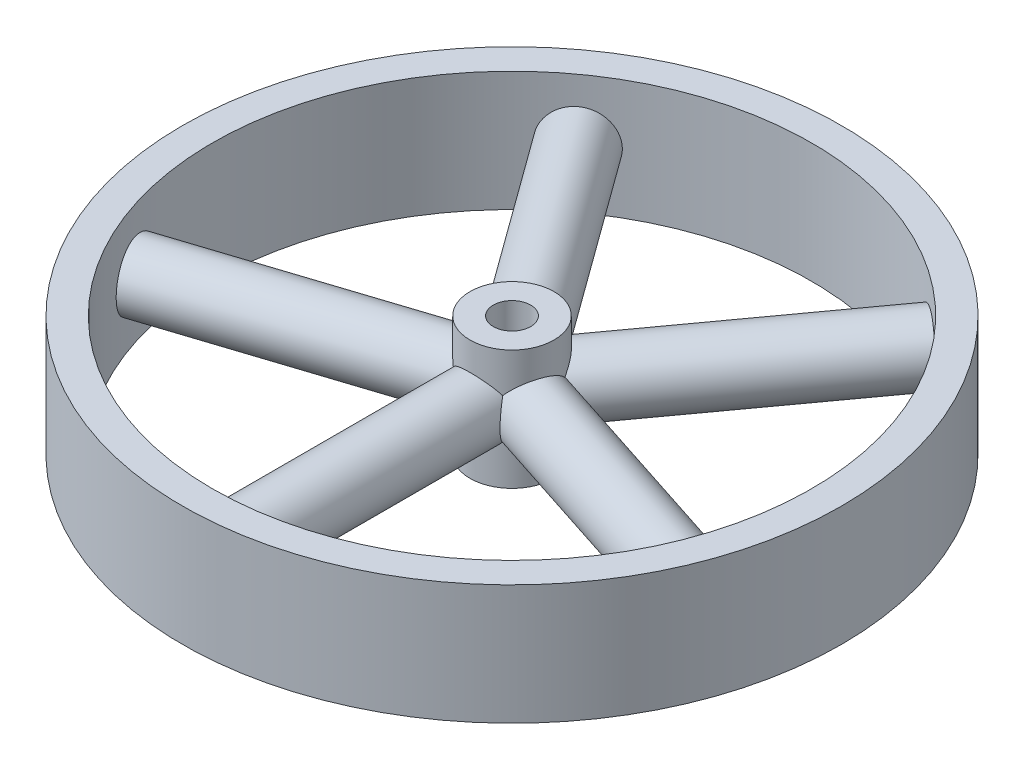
ISO-10303-21;
HEADER;
FILE_DESCRIPTION(('STEP AP214'),'2;1');
FILE_NAME('part.step','',(''),(''),'','','');
FILE_SCHEMA(('AUTOMOTIVE_DESIGN { 1 0 10303 214 1 1 1 1 }'));
ENDSEC;
DATA;
#1=APPLICATION_CONTEXT('core data for automotive mechanical design processes');
#2=APPLICATION_PROTOCOL_DEFINITION('international standard','automotive_design',2000,#1);
#3=PRODUCT_CONTEXT('',#1,'mechanical');
#4=PRODUCT('Part','Part','',(#3));
#5=PRODUCT_RELATED_PRODUCT_CATEGORY('part','',(#4));
#6=PRODUCT_DEFINITION_FORMATION('','',#4);
#7=PRODUCT_DEFINITION_CONTEXT('part definition',#1,'design');
#8=PRODUCT_DEFINITION('design','',#6,#7);
#9=PRODUCT_DEFINITION_SHAPE('','',#8);
#10=(LENGTH_UNIT() NAMED_UNIT(*) SI_UNIT(.MILLI.,.METRE.));
#11=(NAMED_UNIT(*) PLANE_ANGLE_UNIT() SI_UNIT($,.RADIAN.));
#12=(NAMED_UNIT(*) SI_UNIT($,.STERADIAN.) SOLID_ANGLE_UNIT());
#13=UNCERTAINTY_MEASURE_WITH_UNIT(LENGTH_MEASURE(1.E-05),#10,'distance_accuracy_value','');
#14=(GEOMETRIC_REPRESENTATION_CONTEXT(3) GLOBAL_UNCERTAINTY_ASSIGNED_CONTEXT((#13)) GLOBAL_UNIT_ASSIGNED_CONTEXT((#10,
#11,#12)) REPRESENTATION_CONTEXT('',''));
#15=CARTESIAN_POINT('',(0.,0.,0.));
#16=DIRECTION('',(0.,0.,1.));
#17=DIRECTION('',(1.,0.,0.));
#18=AXIS2_PLACEMENT_3D('',#15,#16,#17);
#19=CARTESIAN_POINT('',(0.,12.7,0.));
#20=DIRECTION('',(0.,-1.,0.));
#21=DIRECTION('',(0.,0.,-1.));
#22=AXIS2_PLACEMENT_3D('',#19,#20,#21);
#23=CYLINDRICAL_SURFACE('',#22,63.5);
#24=CARTESIAN_POINT('',(-62.1347650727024,0.,13.0966014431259));
#25=CARTESIAN_POINT('',(-62.1347651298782,0.188929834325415,13.0965994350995));
#26=CARTESIAN_POINT('',(-62.1331193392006,0.377830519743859,13.1044162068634));
#27=CARTESIAN_POINT('',(-62.1265304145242,0.754344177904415,13.1356189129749));
#28=CARTESIAN_POINT('',(-62.1215864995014,0.941956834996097,13.1590085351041));
#29=CARTESIAN_POINT('',(-62.1083803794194,1.31463927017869,13.2211986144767));
#30=CARTESIAN_POINT('',(-62.1001155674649,1.49970693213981,13.2600111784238));
#31=CARTESIAN_POINT('',(-62.080240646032,1.86590498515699,13.3527513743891));
#32=CARTESIAN_POINT('',(-62.0686293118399,2.04703390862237,13.4066845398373));
#33=CARTESIAN_POINT('',(-62.0420462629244,2.4038222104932,13.5291690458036));
#34=CARTESIAN_POINT('',(-62.027077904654,2.57948685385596,13.597705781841));
#35=CARTESIAN_POINT('',(-61.9937356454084,2.9243639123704,13.7489175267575));
#36=CARTESIAN_POINT('',(-61.9753604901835,3.09357392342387,13.8315977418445));
#37=CARTESIAN_POINT('',(-61.9351880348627,3.42419453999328,14.0103843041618));
#38=CARTESIAN_POINT('',(-61.9133926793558,3.58560950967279,14.1064830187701));
#39=CARTESIAN_POINT('',(-61.8663374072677,3.89967642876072,14.3114412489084));
#40=CARTESIAN_POINT('',(-61.8410762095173,4.05232510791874,14.4203054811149));
#41=CARTESIAN_POINT('',(-61.7869912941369,4.34821642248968,14.6503141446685));
#42=CARTESIAN_POINT('',(-61.7581562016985,4.49142668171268,14.7714975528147));
#43=CARTESIAN_POINT('',(-61.6969780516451,4.76694183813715,15.0249758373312));
#44=CARTESIAN_POINT('',(-61.664633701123,4.89924268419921,15.1572748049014));
#45=CARTESIAN_POINT('',(-61.5964790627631,5.15191100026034,15.4319076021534));
#46=CARTESIAN_POINT('',(-61.5606698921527,5.27228229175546,15.5742381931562));
#47=CARTESIAN_POINT('',(-61.4856135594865,5.50033381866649,15.8679647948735));
#48=CARTESIAN_POINT('',(-61.4463651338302,5.60800935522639,16.0193641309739));
#49=CARTESIAN_POINT('',(-61.3644431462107,5.81005671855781,16.330371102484));
#50=CARTESIAN_POINT('',(-61.321762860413,5.90440137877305,16.4899946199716));
#51=CARTESIAN_POINT('',(-61.2331554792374,6.0788840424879,16.8160407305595));
#52=CARTESIAN_POINT('',(-61.1872271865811,6.15901676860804,16.9824658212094));
#53=CARTESIAN_POINT('',(-61.0923190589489,6.30442344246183,17.3207784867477));
#54=CARTESIAN_POINT('',(-61.0433404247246,6.3697031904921,17.4926638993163));
#55=CARTESIAN_POINT('',(-60.9425359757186,6.48498573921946,17.8406908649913));
#56=CARTESIAN_POINT('',(-60.890709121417,6.53498291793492,18.0168339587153));
#57=CARTESIAN_POINT('',(-60.7317744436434,6.66105704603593,18.5482385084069));
#58=CARTESIAN_POINT('',(-60.6207461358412,6.71393198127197,18.9081456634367));
#59=CARTESIAN_POINT('',(-60.3911719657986,6.75573392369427,19.6290529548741));
#60=CARTESIAN_POINT('',(-60.272626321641,6.74466278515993,19.9900530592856));
#61=CARTESIAN_POINT('',(-60.0319287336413,6.65916309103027,20.7016418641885));
#62=CARTESIAN_POINT('',(-59.9097932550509,6.58499013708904,21.0522666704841));
#63=CARTESIAN_POINT('',(-59.6655499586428,6.37576846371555,21.734849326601));
#64=CARTESIAN_POINT('',(-59.5434421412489,6.24071886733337,22.0668069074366));
#65=CARTESIAN_POINT('',(-59.3035065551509,5.91330504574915,22.7037502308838));
#66=CARTESIAN_POINT('',(-59.1856877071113,5.7208282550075,23.0086814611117));
#67=CARTESIAN_POINT('',(-58.9592795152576,5.28410392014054,23.5828061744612));
#68=CARTESIAN_POINT('',(-58.8506904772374,5.0398546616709,23.8519984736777));
#69=CARTESIAN_POINT('',(-58.6468499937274,4.50508258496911,24.3489142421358));
#70=CARTESIAN_POINT('',(-58.5516670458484,4.21433725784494,24.5764264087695));
#71=CARTESIAN_POINT('',(-58.3795879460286,3.59559595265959,24.9824436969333));
#72=CARTESIAN_POINT('',(-58.3026918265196,3.26759990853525,25.1609487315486));
#73=CARTESIAN_POINT('',(-58.170817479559,2.5834908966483,25.4643574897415));
#74=CARTESIAN_POINT('',(-58.1158448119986,2.2273708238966,25.5892476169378));
#75=CARTESIAN_POINT('',(-58.0305592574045,1.49721124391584,25.7820753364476));
#76=CARTESIAN_POINT('',(-58.0002455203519,1.12317235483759,25.8500148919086));
#77=CARTESIAN_POINT('',(-57.9658931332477,0.369745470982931,25.9269557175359));
#78=CARTESIAN_POINT('',(-57.9617270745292,-0.00960754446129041,25.9362427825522));
#79=CARTESIAN_POINT('',(-57.9795411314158,-0.764607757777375,25.8963948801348));
#80=CARTESIAN_POINT('',(-58.0015208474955,-1.14025501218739,25.8472608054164));
#81=CARTESIAN_POINT('',(-58.0704349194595,-1.87626761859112,25.6920551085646));
#82=CARTESIAN_POINT('',(-58.1173095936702,-2.2366673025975,25.5861196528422));
#83=CARTESIAN_POINT('',(-58.2336754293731,-2.93302307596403,25.3201499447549));
#84=CARTESIAN_POINT('',(-58.3031671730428,-3.26897853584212,25.160114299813));
#85=CARTESIAN_POINT('',(-58.4617761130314,-3.90832532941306,24.7893403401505));
#86=CARTESIAN_POINT('',(-58.5509675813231,-4.21158678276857,24.5784098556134));
#87=CARTESIAN_POINT('',(-58.744744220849,-4.77561801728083,24.1115890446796));
#88=CARTESIAN_POINT('',(-58.8493298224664,-5.03638661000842,23.8556974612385));
#89=CARTESIAN_POINT('',(-59.0698023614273,-5.50910804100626,23.3044368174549));
#90=CARTESIAN_POINT('',(-59.1857336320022,-5.72085754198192,23.0089110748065));
#91=CARTESIAN_POINT('',(-59.4237596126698,-6.0881271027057,22.3869930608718));
#92=CARTESIAN_POINT('',(-59.5458542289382,-6.24364801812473,22.060601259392));
#93=CARTESIAN_POINT('',(-59.7912541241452,-6.49371029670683,21.3865456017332));
#94=CARTESIAN_POINT('',(-59.914556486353,-6.58837324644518,21.0389256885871));
#95=CARTESIAN_POINT('',(-60.1583779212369,-6.71440257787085,20.331237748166));
#96=CARTESIAN_POINT('',(-60.2788970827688,-6.74577098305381,19.9711701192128));
#97=CARTESIAN_POINT('',(-60.4543554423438,-6.74473314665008,19.4308249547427));
#98=CARTESIAN_POINT('',(-60.5118486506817,-6.73643437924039,19.2510175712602));
#99=CARTESIAN_POINT('',(-60.6248253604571,-6.70404559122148,18.8922152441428));
#100=CARTESIAN_POINT('',(-60.6803096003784,-6.67996143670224,18.7132200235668));
#101=CARTESIAN_POINT('',(-60.7889435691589,-6.61615961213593,18.3572606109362));
#102=CARTESIAN_POINT('',(-60.8420924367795,-6.57643622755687,18.1802971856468));
#103=CARTESIAN_POINT('',(-60.9457276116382,-6.48166739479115,17.8297970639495));
#104=CARTESIAN_POINT('',(-60.9962148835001,-6.4266275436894,17.6562591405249));
#105=CARTESIAN_POINT('',(-61.0943113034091,-6.30160640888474,17.313776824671));
#106=CARTESIAN_POINT('',(-61.1419199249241,-6.23162240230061,17.1448332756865));
#107=CARTESIAN_POINT('',(-61.2340372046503,-6.07725074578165,16.8128627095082));
#108=CARTESIAN_POINT('',(-61.2785469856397,-5.99286835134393,16.6498335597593));
#109=CARTESIAN_POINT('',(-61.364351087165,-5.81025051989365,16.3307600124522));
#110=CARTESIAN_POINT('',(-61.4056442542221,-5.7120101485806,16.1747181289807));
#111=CARTESIAN_POINT('',(-61.4848747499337,-5.50243146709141,15.8708796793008));
#112=CARTESIAN_POINT('',(-61.5228132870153,-5.39109790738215,15.72308015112));
#113=CARTESIAN_POINT('',(-61.5954649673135,-5.15548368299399,15.4360206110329));
#114=CARTESIAN_POINT('',(-61.6301606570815,-5.03113982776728,15.2968080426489));
#115=CARTESIAN_POINT('',(-61.6960537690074,-4.77090159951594,15.0288384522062));
#116=CARTESIAN_POINT('',(-61.7272524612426,-4.63501145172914,14.9000776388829));
#117=CARTESIAN_POINT('',(-61.7861695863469,-4.35250722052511,14.6538489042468));
#118=CARTESIAN_POINT('',(-61.8138858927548,-4.20588667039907,14.5363878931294));
#119=CARTESIAN_POINT('',(-61.8658120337,-3.9030778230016,14.31378231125));
#120=CARTESIAN_POINT('',(-61.8900231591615,-3.74689307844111,14.2086332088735));
#121=CARTESIAN_POINT('',(-61.9350434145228,-3.42548448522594,14.0110919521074));
#122=CARTESIAN_POINT('',(-61.9558413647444,-3.26023320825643,13.918741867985));
#123=CARTESIAN_POINT('',(-61.9939626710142,-2.92238495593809,13.7479543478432));
#124=CARTESIAN_POINT('',(-62.0112873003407,-2.74979070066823,13.6695118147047));
#125=CARTESIAN_POINT('',(-62.0424920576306,-2.39856271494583,13.5271759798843));
#126=CARTESIAN_POINT('',(-62.0563749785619,-2.21993401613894,13.4632708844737));
#127=CARTESIAN_POINT('',(-62.0807432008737,-1.85784038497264,13.3504548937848));
#128=CARTESIAN_POINT('',(-62.0912293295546,-1.67437664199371,13.301540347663));
#129=CARTESIAN_POINT('',(-62.1116298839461,-1.24509836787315,13.2060051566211));
#130=CARTESIAN_POINT('',(-62.1203101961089,-0.99794832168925,13.1650230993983));
#131=CARTESIAN_POINT('',(-62.1318777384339,-0.500515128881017,13.1103226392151));
#132=CARTESIAN_POINT('',(-62.1347649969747,-0.25023199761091,13.0966041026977));
#133=CARTESIAN_POINT('',(-62.1347650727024,0.,13.0966014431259));
#134=B_SPLINE_CURVE_WITH_KNOTS('',3,(#24,#25,#26,#27,#28,#29,#30,#31,#32,#33,#34,#35,#36,#37,
#38,#39,#40,#41,#42,#43,#44,#45,#46,#47,#48,#49,#50,#51,#52,#53,#54,#55,#56,#57,#58,#59,#60,#61,
#62,#63,#64,#65,#66,#67,#68,#69,#70,#71,#72,#73,#74,#75,#76,#77,#78,#79,#80,#81,#82,#83,#84,#85,
#86,#87,#88,#89,#90,#91,#92,#93,#94,#95,#96,#97,#98,#99,#100,#101,#102,#103,#104,#105,#106,#107,
#108,#109,#110,#111,#112,#113,#114,#115,#116,#117,#118,#119,#120,#121,#122,#123,#124,#125,#126,
#127,#128,#129,#130,#131,#132,#133),.UNSPECIFIED.,.T.,.F.,(4,2,2,2,2,2,2,2,2,2,2,2,2,2,2,2,2,2,
2,2,2,2,2,2,2,2,2,2,2,2,2,2,2,2,2,2,2,2,2,2,2,2,2,2,2,2,2,2,2,2,2,2,2,2,4),(0.,0.56657062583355,
1.13327546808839,1.70042604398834,2.26778444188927,2.83457808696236,3.4015808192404,
3.96826233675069,4.53515389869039,5.1038984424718,5.67285324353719,6.24162519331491,
6.81060699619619,7.38073208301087,7.95106843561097,8.52118168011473,9.09150439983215,
10.2265932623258,11.3616492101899,12.4921292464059,13.6226255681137,14.7553525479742,
15.8881170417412,17.026474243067,18.1648334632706,19.3034811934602,20.4420896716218,
21.5751457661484,22.7081845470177,23.8385192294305,24.9688830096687,26.1035835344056,
27.238315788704,28.3776739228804,29.5170147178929,30.6540721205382,31.7910931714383,
32.3574154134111,32.9235273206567,33.4898462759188,34.055958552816,34.6221740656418,
35.1881833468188,35.7543946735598,36.3204011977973,36.8892970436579,37.4579855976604,
38.0270197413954,38.5958437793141,39.1664953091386,39.7369372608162,40.30691476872,
40.8767533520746,41.6271631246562,42.377569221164),.UNSPECIFIED.);
#135=CARTESIAN_POINT('',(-62.1347650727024,0.,13.0966014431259));
#136=VERTEX_POINT('',#135);
#137=EDGE_CURVE('E192',#136,#136,#134,.T.);
#138=ORIENTED_EDGE('',*,*,#137,.F.);
#139=EDGE_LOOP('',(#138));
#140=FACE_BOUND('',#139,.T.);
#141=CARTESIAN_POINT('',(42.5700917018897,0.,-47.1172717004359));
#142=CARTESIAN_POINT('',(42.5700929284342,0.188929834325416,-47.1172701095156));
#143=CARTESIAN_POINT('',(42.5641668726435,0.377830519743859,-47.1226266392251));
#144=CARTESIAN_POINT('',(42.5404958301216,0.754344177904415,-47.1439972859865));
#145=CARTESIAN_POINT('',(42.5227480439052,0.941956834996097,-47.1600139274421));
#146=CARTESIAN_POINT('',(42.4755096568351,1.31463927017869,-47.2025643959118));
#147=CARTESIAN_POINT('',(42.4460098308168,1.49970693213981,-47.2291064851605));
#148=CARTESIAN_POINT('',(42.3754193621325,1.86590498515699,-47.2924526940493));
#149=CARTESIAN_POINT('',(42.3343244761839,2.04703390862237,-47.3292605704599));
#150=CARTESIAN_POINT('',(42.2408237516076,2.4038222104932,-47.4127274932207));
#151=CARTESIAN_POINT('',(42.1884292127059,2.57948685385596,-47.4593766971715));
#152=CARTESIAN_POINT('',(42.0725747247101,2.92436391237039,-47.5621114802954));
#153=CARTESIAN_POINT('',(42.0091107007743,3.09357392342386,-47.6182005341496));
#154=CARTESIAN_POINT('',(41.8715223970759,3.42419453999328,-47.7392291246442));
#155=CARTESIAN_POINT('',(41.7974041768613,3.58560950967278,-47.8041636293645));
#156=CARTESIAN_POINT('',(41.6388642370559,3.89967642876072,-47.9423199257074));
#157=CARTESIAN_POINT('',(41.5544387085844,4.05232510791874,-48.015544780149));
#158=CARTESIAN_POINT('',(41.375487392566,4.34821642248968,-48.1698353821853));
#159=CARTESIAN_POINT('',(41.2809294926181,4.49142668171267,-48.2509259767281));
#160=CARTESIAN_POINT('',(41.0824445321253,4.76694183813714,-48.420034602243));
#161=CARTESIAN_POINT('',(40.9785140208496,4.89924268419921,-48.5080551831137));
#162=CARTESIAN_POINT('',(40.7619506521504,5.15191100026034,-48.6901774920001));
#163=CARTESIAN_POINT('',(40.6493206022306,5.27228229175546,-48.7842772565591));
#164=CARTESIAN_POINT('',(40.4159505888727,5.50033381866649,-48.977790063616));
#165=CARTESIAN_POINT('',(40.2952076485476,5.60800935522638,-49.0772050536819));
#166=CARTESIAN_POINT('',(40.0461260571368,5.81005671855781,-49.2806624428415));
#167=CARTESIAN_POINT('',(39.9177726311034,5.90440137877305,-49.3847137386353));
#168=CARTESIAN_POINT('',(39.6544426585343,6.0788840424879,-49.5964084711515));
#169=CARTESIAN_POINT('',(39.5194636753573,6.15901676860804,-49.7040532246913));
#170=CARTESIAN_POINT('',(39.2438261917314,6.30442344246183,-49.9219683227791));
#171=CARTESIAN_POINT('',(39.1031699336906,6.3697031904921,-50.0322376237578));
#172=CARTESIAN_POINT('',(38.8170523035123,6.48498573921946,-50.2545459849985));
#173=CARTESIAN_POINT('',(38.6715891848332,6.53498291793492,-50.3665856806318));
#174=CARTESIAN_POINT('',(38.230656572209,6.66105704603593,-50.7030815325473));
#175=CARTESIAN_POINT('',(37.9292846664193,6.71393198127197,-50.9289917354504));
#176=CARTESIAN_POINT('',(37.3198165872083,6.75573392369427,-51.3772776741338));
#177=CARTESIAN_POINT('',(37.0117206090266,6.74466278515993,-51.5996535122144));
#178=CARTESIAN_POINT('',(36.3987307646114,6.65916309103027,-52.0338624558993));
#179=CARTESIAN_POINT('',(36.0938289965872,6.58499013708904,-52.2457344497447));
#180=CARTESIAN_POINT('',(35.4950200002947,6.37576846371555,-52.6543928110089));
#181=CARTESIAN_POINT('',(35.2011129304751,6.24071886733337,-52.8511789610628));
#182=CARTESIAN_POINT('',(34.6326150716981,5.91330504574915,-53.2254463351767));
#183=CARTESIAN_POINT('',(34.3580635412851,5.72082825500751,-53.4028887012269));
#184=CARTESIAN_POINT('',(33.8374334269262,5.28410392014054,-53.7342859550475));
#185=CARTESIAN_POINT('',(33.5913557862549,5.0398546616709,-53.8882400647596));
#186=CARTESIAN_POINT('',(33.1343656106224,4.50508258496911,-54.1704389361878));
#187=CARTESIAN_POINT('',(32.9236326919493,4.21433725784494,-54.2985530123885));
#188=CARTESIAN_POINT('',(32.5457668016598,3.59559595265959,-54.5258823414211));
#189=CARTESIAN_POINT('',(32.3786339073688,3.26759990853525,-54.6250975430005));
#190=CARTESIAN_POINT('',(32.0936061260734,2.5834908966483,-54.7930465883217));
#191=CARTESIAN_POINT('',(31.9757237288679,2.2273708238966,-54.8617727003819));
#192=CARTESIAN_POINT('',(31.7933849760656,1.49721124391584,-54.9676440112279));
#193=CARTESIAN_POINT('',(31.7289267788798,1.12317235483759,-55.0047902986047));
#194=CARTESIAN_POINT('',(31.6559104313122,0.369745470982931,-55.0468449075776));
#195=CARTESIAN_POINT('',(31.6470812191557,-0.00960754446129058,-55.0519095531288));
#196=CARTESIAN_POINT('',(31.6849151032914,-0.764607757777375,-55.0301427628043));
#197=CARTESIAN_POINT('',(31.7315773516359,-1.14025501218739,-55.0033118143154));
#198=CARTESIAN_POINT('',(31.8785576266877,-1.87626761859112,-54.9182544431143));
#199=CARTESIAN_POINT('',(31.9787473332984,-2.23666730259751,-54.8601031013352));
#200=CARTESIAN_POINT('',(32.229222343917,-2.93302307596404,-54.7133272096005));
#201=CARTESIAN_POINT('',(32.3795089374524,-3.26897853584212,-54.6247018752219));
#202=CARTESIAN_POINT('',(32.7257617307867,-3.90832532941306,-54.4179674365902));
#203=CARTESIAN_POINT('',(32.9219009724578,-4.21158678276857,-54.2997465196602));
#204=CARTESIAN_POINT('',(33.3530599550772,-4.77561801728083,-54.0359796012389));
#205=CARTESIAN_POINT('',(33.5880807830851,-5.03638661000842,-53.8904328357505));
#206=CARTESIAN_POINT('',(34.0904696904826,-5.50910804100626,-53.5740441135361));
#207=CARTESIAN_POINT('',(34.3579657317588,-5.72085754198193,-53.4031014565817));
#208=CARTESIAN_POINT('',(34.9160870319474,-6.0881271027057,-53.0398673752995));
#209=CARTESIAN_POINT('',(35.2067119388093,-6.24364801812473,-52.8475762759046));
#210=CARTESIAN_POINT('',(35.8014445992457,-6.49371029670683,-52.4464962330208));
#211=CARTESIAN_POINT('',(36.1055241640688,-6.58837324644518,-52.237741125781));
#212=CARTESIAN_POINT('',(36.7187483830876,-6.71440257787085,-51.8085241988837));
#213=CARTESIAN_POINT('',(37.0278928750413,-6.74577098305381,-51.5880627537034));
#214=CARTESIAN_POINT('',(37.4874485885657,-6.74473314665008,-51.2540461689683));
#215=CARTESIAN_POINT('',(37.6396496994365,-6.73643437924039,-51.1423725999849));
#216=CARTESIAN_POINT('',(37.9419484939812,-6.70404559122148,-50.9185014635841));
#217=CARTESIAN_POINT('',(38.0920469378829,-6.67996143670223,-50.8063041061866));
#218=CARTESIAN_POINT('',(38.3891613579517,-6.61615961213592,-50.582180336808));
#219=CARTESIAN_POINT('',(38.5361761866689,-6.57643622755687,-50.4702540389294));
#220=CARTESIAN_POINT('',(38.8260376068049,-6.48166739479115,-50.2476087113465));
#221=CARTESIAN_POINT('',(38.9688856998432,-6.4266275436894,-50.1368892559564));
#222=CARTESIAN_POINT('',(39.2495534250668,-6.30160640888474,-49.9174748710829));
#223=CARTESIAN_POINT('',(39.3873721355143,-6.23162240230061,-49.8087803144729));
#224=CARTESIAN_POINT('',(39.6570239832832,-6.07725074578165,-49.5943556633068));
#225=CARTESIAN_POINT('',(39.7888592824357,-5.99286835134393,-49.4886245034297));
#226=CARTESIAN_POINT('',(40.0458229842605,-5.81025051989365,-49.2809229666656));
#227=CARTESIAN_POINT('',(40.1709489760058,-5.7120101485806,-49.1789539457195));
#228=CARTESIAN_POINT('',(40.4136395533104,-5.5024314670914,-48.979713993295));
#229=CARTESIAN_POINT('',(40.5312068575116,-5.39109790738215,-48.8824413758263));
#230=CARTESIAN_POINT('',(40.7587126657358,-5.15548368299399,-48.6929089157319));
#231=CARTESIAN_POINT('',(40.8686091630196,-5.03113982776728,-48.6006771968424));
#232=CARTESIAN_POINT('',(41.079426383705,-4.77090159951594,-48.4226162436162));
#233=CARTESIAN_POINT('',(41.1803503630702,-4.63501145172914,-48.3367846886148));
#234=CARTESIAN_POINT('',(41.3727449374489,-4.35250722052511,-48.1722120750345));
#235=CARTESIAN_POINT('',(41.4642097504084,-4.20588667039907,-48.0934753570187));
#236=CARTESIAN_POINT('',(41.6370631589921,-3.90307782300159,-47.9439050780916));
#237=CARTESIAN_POINT('',(41.7184554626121,-3.74689307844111,-47.8730686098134));
#238=CARTESIAN_POINT('',(41.8709894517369,-3.42548448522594,-47.7397166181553));
#239=CARTESIAN_POINT('',(41.9420973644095,-3.26023320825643,-47.6772285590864));
#240=CARTESIAN_POINT('',(42.0733245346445,-2.92238495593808,-47.5614656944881));
#241=CARTESIAN_POINT('',(42.1334478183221,-2.74979070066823,-47.5081875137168));
#242=CARTESIAN_POINT('',(42.2423559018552,-2.39856271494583,-47.4113771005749));
#243=CARTESIAN_POINT('',(42.2911498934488,-2.21993401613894,-47.3678369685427));
#244=CARTESIAN_POINT('',(42.3771757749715,-1.85784038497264,-47.2908901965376));
#245=CARTESIAN_POINT('',(42.4144104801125,-1.67437664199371,-47.2574810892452));
#246=CARTESIAN_POINT('',(42.4870690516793,-1.24509836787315,-47.1921826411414));
#247=CARTESIAN_POINT('',(42.5181802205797,-0.99794832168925,-47.1641296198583));
#248=CARTESIAN_POINT('',(42.559690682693,-0.500515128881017,-47.1266752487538));
#249=CARTESIAN_POINT('',(42.5700900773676,-0.25023199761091,-47.1172738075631));
#250=CARTESIAN_POINT('',(42.5700917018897,0.,-47.1172717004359));
#251=B_SPLINE_CURVE_WITH_KNOTS('',3,(#141,#142,#143,#144,#145,#146,#147,#148,#149,#150,#151,
#152,#153,#154,#155,#156,#157,#158,#159,#160,#161,#162,#163,#164,#165,#166,#167,#168,#169,#170,
#171,#172,#173,#174,#175,#176,#177,#178,#179,#180,#181,#182,#183,#184,#185,#186,#187,#188,#189,
#190,#191,#192,#193,#194,#195,#196,#197,#198,#199,#200,#201,#202,#203,#204,#205,#206,#207,#208,
#209,#210,#211,#212,#213,#214,#215,#216,#217,#218,#219,#220,#221,#222,#223,#224,#225,#226,#227,
#228,#229,#230,#231,#232,#233,#234,#235,#236,#237,#238,#239,#240,#241,#242,#243,#244,#245,#246,
#247,#248,#249,#250),.UNSPECIFIED.,.T.,.F.,(4,2,2,2,2,2,2,2,2,2,2,2,2,2,2,2,2,2,2,2,2,2,2,2,2,2,
2,2,2,2,2,2,2,2,2,2,2,2,2,2,2,2,2,2,2,2,2,2,2,2,2,2,2,2,4),(0.,0.56657062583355,
1.13327546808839,1.70042604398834,2.26778444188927,2.83457808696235,3.4015808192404,
3.9682623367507,4.53515389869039,5.1038984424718,5.67285324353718,6.2416251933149,
6.81060699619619,7.38073208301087,7.95106843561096,8.52118168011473,9.09150439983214,
10.2265932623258,11.3616492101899,12.4921292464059,13.6226255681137,14.7553525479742,
15.8881170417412,17.026474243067,18.1648334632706,19.3034811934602,20.4420896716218,
21.5751457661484,22.7081845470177,23.8385192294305,24.9688830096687,26.1035835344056,
27.238315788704,28.3776739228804,29.5170147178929,30.6540721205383,31.7910931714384,
32.3574154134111,32.9235273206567,33.4898462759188,34.055958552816,34.6221740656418,
35.1881833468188,35.7543946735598,36.3204011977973,36.8892970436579,37.4579855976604,
38.0270197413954,38.5958437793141,39.1664953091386,39.7369372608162,40.30691476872,
40.8767533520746,41.6271631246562,42.377569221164),.UNSPECIFIED.);
#252=CARTESIAN_POINT('',(42.5700917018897,0.,-47.1172717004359));
#253=VERTEX_POINT('',#252);
#254=EDGE_CURVE('E236',#253,#253,#251,.T.);
#255=ORIENTED_EDGE('',*,*,#254,.F.);
#256=EDGE_LOOP('',(#255));
#257=FACE_BOUND('',#256,.T.);
#258=CARTESIAN_POINT('',(0.,-12.7,0.));
#259=DIRECTION('',(0.,1.,0.));
#260=DIRECTION('',(0.,0.,1.));
#261=AXIS2_PLACEMENT_3D('',#258,#259,#260);
#262=CIRCLE('',#261,63.5);
#263=CARTESIAN_POINT('',(0.,-12.7,63.5));
#264=VERTEX_POINT('',#263);
#265=EDGE_CURVE('E183',#264,#264,#262,.T.);
#266=ORIENTED_EDGE('',*,*,#265,.F.);
#267=EDGE_LOOP('',(#266));
#268=FACE_BOUND('',#267,.T.);
#269=CARTESIAN_POINT('',(0.,12.7,0.));
#270=DIRECTION('',(0.,1.,0.));
#271=DIRECTION('',(0.,0.,1.));
#272=AXIS2_PLACEMENT_3D('',#269,#270,#271);
#273=CIRCLE('',#272,63.5);
#274=CARTESIAN_POINT('',(0.,12.7,63.5));
#275=VERTEX_POINT('',#274);
#276=EDGE_CURVE('E181',#275,#275,#273,.T.);
#277=ORIENTED_EDGE('',*,*,#276,.T.);
#278=EDGE_LOOP('',(#277));
#279=FACE_BOUND('',#278,.T.);
#280=CARTESIAN_POINT('',(57.9660700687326,0.,25.9265254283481));
#281=CARTESIAN_POINT('',(57.9660689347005,0.188929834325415,25.9265270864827));
#282=CARTESIAN_POINT('',(57.9693320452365,0.377830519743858,25.9192358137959));
#283=CARTESIAN_POINT('',(57.9823419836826,0.754344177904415,25.8901194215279));
#284=CARTESIAN_POINT('',(57.9920903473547,0.941956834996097,25.8682908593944));
#285=CARTESIAN_POINT('',(58.0179607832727,1.31463927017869,25.8102156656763));
#286=CARTESIAN_POINT('',(58.034087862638,1.49970693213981,25.773957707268));
#287=CARTESIAN_POINT('',(58.07252003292,1.86590498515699,25.6872471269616));
#288=CARTESIAN_POINT('',(58.0948273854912,2.04703390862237,25.6367893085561));
#289=CARTESIAN_POINT('',(58.1453158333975,2.4038222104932,25.5220721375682));
#290=CARTESIAN_POINT('',(58.1734910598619,2.57948685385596,25.4578265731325));
#291=CARTESIAN_POINT('',(58.2353966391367,2.9243639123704,25.3158956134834));
#292=CARTESIAN_POINT('',(58.26912903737,3.09357392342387,25.2382052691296));
#293=CARTESIAN_POINT('',(58.3417169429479,3.42419453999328,25.0699511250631));
#294=CARTESIAN_POINT('',(58.3805695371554,3.58560950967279,24.979394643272));
#295=CARTESIAN_POINT('',(58.4629724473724,3.89967642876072,24.7859215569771));
#296=CARTESIAN_POINT('',(58.5065244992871,4.05232510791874,24.6830003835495));
#297=CARTESIAN_POINT('',(58.5979645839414,4.34821642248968,24.4651291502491));
#298=CARTESIAN_POINT('',(58.6458663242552,4.49142668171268,24.3501408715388));
#299=CARTESIAN_POINT('',(58.7453629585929,4.76694183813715,24.109113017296));
#300=CARTESIAN_POINT('',(58.7969592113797,4.89924268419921,23.9830693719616));
#301=CARTESIAN_POINT('',(58.9032460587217,5.15191100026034,23.7208264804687));
#302=CARTESIAN_POINT('',(58.9579356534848,5.27228229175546,23.5846305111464));
#303=CARTESIAN_POINT('',(59.0698619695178,5.50033381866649,23.3028836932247));
#304=CARTESIAN_POINT('',(59.1270996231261,5.60800935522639,23.1573294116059));
#305=CARTESIAN_POINT('',(59.2436286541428,5.81005671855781,22.857566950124));
#306=CARTESIAN_POINT('',(59.3029239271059,5.90440137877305,22.7033419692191));
#307=CARTESIAN_POINT('',(59.4228841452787,6.0788840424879,22.3874830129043));
#308=CARTESIAN_POINT('',(59.4835495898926,6.15901676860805,22.2258463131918));
#309=CARTESIAN_POINT('',(59.605622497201,6.30442344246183,21.8963600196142));
#310=CARTESIAN_POINT('',(59.6670296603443,6.3697031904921,21.7285128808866));
#311=CARTESIAN_POINT('',(59.7900422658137,6.48498573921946,21.3877017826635));
#312=CARTESIAN_POINT('',(59.8516477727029,6.53498291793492,21.2147359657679));
#313=CARTESIAN_POINT('',(60.0354186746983,6.66105704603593,20.691401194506));
#314=CARTESIAN_POINT('',(60.1571430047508,6.71393198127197,20.3349693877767));
#315=CARTESIAN_POINT('',(60.3951522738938,6.75573392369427,19.6168028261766));
#316=CARTESIAN_POINT('',(60.5114373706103,6.74466278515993,19.2550682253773));
#317=CARTESIAN_POINT('',(60.7349703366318,6.65916309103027,18.5379022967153));
#318=CARTESIAN_POINT('',(60.8422527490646,6.58499013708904,18.1824514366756));
#319=CARTESIAN_POINT('',(61.0458677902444,6.37576846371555,17.4866678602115));
#320=CARTESIAN_POINT('',(61.1422002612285,6.24071886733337,17.14633536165));
#321=CARTESIAN_POINT('',(61.3224741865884,5.91330504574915,16.4900067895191));
#322=CARTESIAN_POINT('',(61.406390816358,5.7208282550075,16.1740600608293));
#323=CARTESIAN_POINT('',(61.5606847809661,5.28410392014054,15.5765040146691));
#324=CARTESIAN_POINT('',(61.6310616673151,5.0398546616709,15.2948958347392));
#325=CARTESIAN_POINT('',(61.7582310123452,4.50508258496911,14.7730681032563));
#326=CARTESIAN_POINT('',(61.8149546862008,4.21433725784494,14.5330597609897));
#327=CARTESIAN_POINT('',(61.9143907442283,3.59559595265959,14.1034393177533));
#328=CARTESIAN_POINT('',(61.9571031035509,3.26759990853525,13.9138273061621));
#329=CARTESIAN_POINT('',(62.0287537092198,2.5834908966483,13.5908506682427));
#330=CARTESIAN_POINT('',(62.0576884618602,2.2273708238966,13.45750030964));
#331=CARTESIAN_POINT('',(62.1020322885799,1.49721124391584,13.251369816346));
#332=CARTESIAN_POINT('',(62.1174418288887,1.12317235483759,13.1785875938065));
#333=CARTESIAN_POINT('',(62.134874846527,0.369745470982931,13.0961493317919));
#334=CARTESIAN_POINT('',(62.1369632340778,-0.00960754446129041,13.0861871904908));
#335=CARTESIAN_POINT('',(62.1279530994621,-0.764607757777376,13.1288956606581));
#336=CARTESIAN_POINT('',(62.1168547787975,-1.14025501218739,13.1815653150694));
#337=CARTESIAN_POINT('',(62.0813798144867,-1.87626761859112,13.3476360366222));
#338=CARTESIAN_POINT('',(62.0570349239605,-2.23666730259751,13.4608918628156));
#339=CARTESIAN_POINT('',(61.9948437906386,-2.93302307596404,13.744463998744));
#340=CARTESIAN_POINT('',(61.9569972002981,-3.26897853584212,13.9147817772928));
#341=CARTESIAN_POINT('',(61.8673790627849,-3.90832532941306,14.3079722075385));
#342=CARTESIAN_POINT('',(61.8155546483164,-4.21158678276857,14.531043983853));
#343=CARTESIAN_POINT('',(61.6979328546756,-4.77561801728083,15.0226090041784));
#344=CARTESIAN_POINT('',(61.6321350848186,-5.03638661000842,15.2911035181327));
#345=CARTESIAN_POINT('',(61.4864782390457,-5.50910804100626,15.8666732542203));
#346=CARTESIAN_POINT('',(61.4065629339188,-5.72085754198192,16.1739012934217));
#347=CARTESIAN_POINT('',(61.2335757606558,-6.0881271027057,16.8169516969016));
#348=CARTESIAN_POINT('',(61.1405040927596,-6.24364801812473,17.1527736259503));
#349=CARTESIAN_POINT('',(60.9428368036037,-6.49371029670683,17.8423385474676));
#350=CARTESIAN_POINT('',(60.8382646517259,-6.58837324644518,18.1960442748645));
#351=CARTESIAN_POINT('',(60.6195518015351,-6.71440257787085,18.9118904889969));
#352=CARTESIAN_POINT('',(60.5054114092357,-6.74577098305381,19.2740307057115));
#353=CARTESIAN_POINT('',(60.3297532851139,-6.74473314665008,19.8143109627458));
#354=CARTESIAN_POINT('',(60.2705781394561,-6.73643437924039,19.9935718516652));
#355=CARTESIAN_POINT('',(60.1510795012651,-6.70404559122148,20.3502550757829));
#356=CARTESIAN_POINT('',(60.090756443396,-6.67996143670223,20.5276780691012));
#357=CARTESIAN_POINT('',(59.9694154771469,-6.61615961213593,20.8795087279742));
#358=CARTESIAN_POINT('',(59.9083973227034,-6.57643622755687,21.0539152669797));
#359=CARTESIAN_POINT('',(59.7862211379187,-6.48166739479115,21.3983910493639));
#360=CARTESIAN_POINT('',(59.7250631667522,-6.4266275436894,21.5684618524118));
#361=CARTESIAN_POINT('',(59.603118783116,-6.30160640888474,21.9031954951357));
#362=CARTESIAN_POINT('',(59.5423324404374,-6.23162240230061,22.0678573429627));
#363=CARTESIAN_POINT('',(59.4217294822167,-6.07725074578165,22.3905723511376));
#364=CARTESIAN_POINT('',(59.3619125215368,-5.99286835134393,22.5486278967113));
#365=CARTESIAN_POINT('',(59.2437827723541,-5.81025051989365,22.857198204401));
#366=CARTESIAN_POINT('',(59.1854705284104,-5.71201014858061,23.0077102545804));
#367=CARTESIAN_POINT('',(59.0709775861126,-5.50243146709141,23.300091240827));
#368=CARTESIAN_POINT('',(59.0147961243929,-5.39109790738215,23.441963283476));
#369=CARTESIAN_POINT('',(58.9048432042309,-5.15548368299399,23.7169029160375));
#370=CARTESIAN_POINT('',(58.851085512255,-5.03113982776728,23.8499218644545));
#371=CARTESIAN_POINT('',(58.7468855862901,-4.77090159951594,24.1054448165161));
#372=CARTESIAN_POINT('',(58.6964421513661,-4.63501145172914,24.2279526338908));
#373=CARTESIAN_POINT('',(58.5993774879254,-4.35250722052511,24.4617864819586));
#374=CARTESIAN_POINT('',(58.5527586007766,-4.20588667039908,24.5731056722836));
#375=CARTESIAN_POINT('',(58.4639234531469,-3.9030778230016,24.7837187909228));
#376=CARTESIAN_POINT('',(58.4217055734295,-3.74689307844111,24.8830171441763));
#377=CARTESIAN_POINT('',(58.3420158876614,-3.42548448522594,25.0692936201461));
#378=CARTESIAN_POINT('',(58.3045597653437,-3.26023320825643,25.1562311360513));
#379=CARTESIAN_POINT('',(58.2350141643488,-2.92238495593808,25.3168082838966));
#380=CARTESIAN_POINT('',(58.2029227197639,-2.74979070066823,25.390452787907));
#381=CARTESIAN_POINT('',(58.1445049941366,-2.39856271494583,25.5239465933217));
#382=CARTESIAN_POINT('',(58.1181740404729,-2.21993401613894,25.5838070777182));
#383=CARTESIAN_POINT('',(58.0715767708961,-1.85784038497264,25.6894004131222));
#384=CARTESIAN_POINT('',(58.0513089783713,-1.67437664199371,25.7351367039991));
#385=CARTESIAN_POINT('',(58.0116591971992,-1.24509836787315,25.8244174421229));
#386=CARTESIAN_POINT('',(57.9945930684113,-0.99794832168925,25.8626747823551));
#387=CARTESIAN_POINT('',(57.971799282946,-0.500515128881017,25.9137276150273));
#388=CARTESIAN_POINT('',(57.9660715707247,-0.25023199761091,25.9265232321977));
#389=CARTESIAN_POINT('',(57.9660700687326,0.,25.9265254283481));
#390=B_SPLINE_CURVE_WITH_KNOTS('',3,(#280,#281,#282,#283,#284,#285,#286,#287,#288,#289,#290,
#291,#292,#293,#294,#295,#296,#297,#298,#299,#300,#301,#302,#303,#304,#305,#306,#307,#308,#309,
#310,#311,#312,#313,#314,#315,#316,#317,#318,#319,#320,#321,#322,#323,#324,#325,#326,#327,#328,
#329,#330,#331,#332,#333,#334,#335,#336,#337,#338,#339,#340,#341,#342,#343,#344,#345,#346,#347,
#348,#349,#350,#351,#352,#353,#354,#355,#356,#357,#358,#359,#360,#361,#362,#363,#364,#365,#366,
#367,#368,#369,#370,#371,#372,#373,#374,#375,#376,#377,#378,#379,#380,#381,#382,#383,#384,#385,
#386,#387,#388,#389),.UNSPECIFIED.,.T.,.F.,(4,2,2,2,2,2,2,2,2,2,2,2,2,2,2,2,2,2,2,2,2,2,2,2,2,2,
2,2,2,2,2,2,2,2,2,2,2,2,2,2,2,2,2,2,2,2,2,2,2,2,2,2,2,2,4),(0.,0.566570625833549,
1.13327546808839,1.70042604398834,2.26778444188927,2.83457808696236,3.4015808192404,
3.96826233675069,4.53515389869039,5.1038984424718,5.67285324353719,6.24162519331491,
6.81060699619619,7.38073208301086,7.95106843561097,8.52118168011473,9.09150439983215,
10.2265932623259,11.3616492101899,12.4921292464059,13.6226255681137,14.7553525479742,
15.8881170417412,17.026474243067,18.1648334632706,19.3034811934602,20.4420896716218,
21.5751457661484,22.7081845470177,23.8385192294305,24.9688830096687,26.1035835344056,
27.238315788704,28.3776739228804,29.5170147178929,30.6540721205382,31.7910931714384,
32.3574154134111,32.9235273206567,33.4898462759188,34.055958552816,34.6221740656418,
35.1881833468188,35.7543946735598,36.3204011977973,36.8892970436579,37.4579855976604,
38.0270197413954,38.5958437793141,39.1664953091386,39.7369372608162,40.30691476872,
40.8767533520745,41.6271631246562,42.377569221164),.UNSPECIFIED.);
#391=CARTESIAN_POINT('',(57.9660700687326,0.,25.9265254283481));
#392=VERTEX_POINT('',#391);
#393=EDGE_CURVE('E87',#392,#392,#390,.T.);
#394=ORIENTED_EDGE('',*,*,#393,.F.);
#395=EDGE_LOOP('',(#394));
#396=FACE_BOUND('',#395,.T.);
#397=CARTESIAN_POINT('',(-31.6563064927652,0.,-55.0466007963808));
#398=CARTESIAN_POINT('',(-31.6563046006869,0.188929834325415,-55.0466014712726));
#399=CARTESIAN_POINT('',(-31.6632302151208,0.377830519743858,-55.0426207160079));
#400=CARTESIAN_POINT('',(-31.6908696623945,0.754344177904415,-55.0267121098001));
#401=CARTESIAN_POINT('',(-31.7115867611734,0.941956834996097,-55.0147823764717));
#402=CARTESIAN_POINT('',(-31.7666521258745,1.31463927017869,-54.9830048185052));
#403=CARTESIAN_POINT('',(-31.8010111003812,1.49970693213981,-54.963150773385));
#404=CARTESIAN_POINT('',(-31.8830705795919,1.86590498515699,-54.9155903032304));
#405=CARTESIAN_POINT('',(-31.9307759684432,2.04703390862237,-54.8878810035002));
#406=CARTESIAN_POINT('',(-32.0390510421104,2.4038222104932,-54.8247492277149));
#407=CARTESIAN_POINT('',(-32.0996078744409,2.57948685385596,-54.789334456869));
#408=CARTESIAN_POINT('',(-32.2331154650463,2.9243639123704,-54.7108970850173));
#409=CARTESIAN_POINT('',(-32.3060707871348,3.09357392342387,-54.6678716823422));
#410=CARTESIAN_POINT('',(-32.4636929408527,3.42419453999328,-54.5744173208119));
#411=CARTESIAN_POINT('',(-32.5483531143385,3.58560950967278,-54.5239925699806));
#412=CARTESIAN_POINT('',(-32.7287390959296,3.89967642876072,-54.4159047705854));
#413=CARTESIAN_POINT('',(-32.8244689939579,4.05232510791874,-54.358239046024));
#414=CARTESIAN_POINT('',(-33.0265070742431,4.34821642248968,-54.2357246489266));
#415=CARTESIAN_POINT('',(-33.1328488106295,4.49142668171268,-54.1708531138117));
#416=CARTESIAN_POINT('',(-33.3550158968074,4.76694183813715,-54.0343401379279));
#417=CARTESIAN_POINT('',(-33.4708447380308,4.89924268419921,-53.9626962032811));
#418=CARTESIAN_POINT('',(-33.710975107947,5.15191100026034,-53.8130110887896));
#419=CARTESIAN_POINT('',(-33.8352739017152,5.27228229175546,-53.7349719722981));
#420=CARTESIAN_POINT('',(-34.0914308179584,5.50033381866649,-53.5728226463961));
#421=CARTESIAN_POINT('',(-34.2232917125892,5.60800935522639,-53.4887102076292));
#422=CARTESIAN_POINT('',(-34.4937616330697,5.8100567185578,-53.3146913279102));
#423=CARTESIAN_POINT('',(-34.6323836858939,5.90440137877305,-53.2247735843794));
#424=CARTESIAN_POINT('',(-34.915090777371,6.0788840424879,-53.0397491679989));
#425=CARTESIAN_POINT('',(-35.0591778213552,6.15901676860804,-52.9446405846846));
#426=CARTESIAN_POINT('',(-35.3516040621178,6.30442344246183,-52.749833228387));
#427=CARTESIAN_POINT('',(-35.4999415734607,6.3697031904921,-52.6501362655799));
#428=CARTESIAN_POINT('',(-35.7997845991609,6.48498573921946,-52.4467192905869));
#429=CARTESIAN_POINT('',(-35.9512912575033,6.53498291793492,-52.3429978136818));
#430=CARTESIAN_POINT('',(-36.4075735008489,6.66105704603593,-52.027628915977));
#431=CARTESIAN_POINT('',(-36.7155559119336,6.71393198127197,-51.8108172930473));
#432=CARTESIAN_POINT('',(-37.3302371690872,6.75573392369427,-51.3697066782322));
#433=CARTESIAN_POINT('',(-37.6369360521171,6.74466278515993,-51.1454079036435));
#434=CARTESIAN_POINT('',(-38.2393175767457,6.65916309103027,-50.6965978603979));
#435=CARTESIAN_POINT('',(-38.5350396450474,6.58499013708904,-50.4720910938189));
#436=CARTESIAN_POINT('',(-39.1087389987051,6.37576846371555,-50.0288722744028));
#437=CARTESIAN_POINT('',(-39.3867160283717,6.24071886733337,-49.8101603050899));
#438=CARTESIAN_POINT('',(-39.9183409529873,5.91330504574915,-49.3851416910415));
#439=CARTESIAN_POINT('',(-40.1719397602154,5.72082825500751,-49.178860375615));
#440=CARTESIAN_POINT('',(-40.6480008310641,5.28410392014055,-48.7861190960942));
#441=CARTESIAN_POINT('',(-40.8704620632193,5.0398546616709,-48.5996597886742));
#442=CARTESIAN_POINT('',(-41.280066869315,4.50508258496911,-48.2522405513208));
#443=CARTESIAN_POINT('',(-41.4670306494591,4.21433725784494,-48.0914110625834));
#444=CARTESIAN_POINT('',(-41.8000006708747,3.5955959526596,-47.8022878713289));
#445=CARTESIAN_POINT('',(-41.9460068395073,3.26759990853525,-47.6739942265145));
#446=CARTESIAN_POINT('',(-42.1938143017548,2.5834908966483,-47.4548158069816));
#447=CARTESIAN_POINT('',(-42.2956043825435,2.2273708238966,-47.3639405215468));
#448=CARTESIAN_POINT('',(-42.4526397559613,1.49721124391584,-47.2232420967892));
#449=CARTESIAN_POINT('',(-42.5078866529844,1.12317235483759,-47.1734175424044));
#450=CARTESIAN_POINT('',(-42.5704462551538,0.369745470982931,-47.1169704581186));
#451=CARTESIAN_POINT('',(-42.5779913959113,-0.00960754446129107,-47.1101384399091));
#452=CARTESIAN_POINT('',(-42.5455986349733,-0.764607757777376,-47.13939429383));
#453=CARTESIAN_POINT('',(-42.5056614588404,-1.14025501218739,-47.1754815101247));
#454=CARTESIAN_POINT('',(-42.3793476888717,-1.87626761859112,-47.2889838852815));
#455=CARTESIAN_POINT('',(-42.2930821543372,-2.23666730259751,-47.366300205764));
#456=CARTESIAN_POINT('',(-42.0760889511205,-2.93302307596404,-47.5591598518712));
#457=CARTESIAN_POINT('',(-41.9453601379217,-3.26897853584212,-47.6747041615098));
#458=CARTESIAN_POINT('',(-41.6417460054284,-3.90832532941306,-47.940125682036));
#459=CARTESIAN_POINT('',(-41.4687008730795,-4.21158678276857,-48.0901329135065));
#460=CARTESIAN_POINT('',(-41.084608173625,-4.77561801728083,-48.4186810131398));
#461=CARTESIAN_POINT('',(-40.8735595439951,-5.03638661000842,-48.5972226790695));
#462=CARTESIAN_POINT('',(-40.4174092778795,-5.50910804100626,-48.9772534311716));
#463=CARTESIAN_POINT('',(-40.1721723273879,-5.72085754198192,-49.1788330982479));
#464=CARTESIAN_POINT('',(-39.654247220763,-6.0881271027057,-49.5973924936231));
#465=CARTESIAN_POINT('',(-39.3815594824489,-6.24364801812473,-49.8143719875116));
#466=CARTESIAN_POINT('',(-38.8163271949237,-6.49371029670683,-50.2560558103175));
#467=CARTESIAN_POINT('',(-38.5238235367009,-6.58837324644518,-50.4807437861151));
#468=CARTESIAN_POINT('',(-37.9261172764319,-6.71440257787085,-50.9313193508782));
#469=CARTESIAN_POINT('',(-37.6209150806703,-6.74577098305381,-51.1572069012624));
#470=CARTESIAN_POINT('',(-37.1612359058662,-6.74473314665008,-51.4910535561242));
#471=CARTESIAN_POINT('',(-37.0079953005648,-6.73643437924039,-51.6012963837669));
#472=CARTESIAN_POINT('',(-36.701665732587,-6.70404559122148,-51.8196196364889));
#473=CARTESIAN_POINT('',(-36.5485767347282,-6.67996143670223,-51.9277008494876));
#474=CARTESIAN_POINT('',(-36.2436089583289,-6.61615961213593,-52.1410154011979));
#475=CARTESIAN_POINT('',(-36.091730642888,-6.57643622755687,-52.2462476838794));
#476=CARTESIAN_POINT('',(-35.7904102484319,-6.48166739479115,-52.4531210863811));
#477=CARTESIAN_POINT('',(-35.6409673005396,-6.4266275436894,-52.5547635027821));
#478=CARTESIAN_POINT('',(-35.3455607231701,-6.30160640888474,-52.7538915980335));
#479=CARTESIAN_POINT('',(-35.1995977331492,-6.23162240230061,-52.8513765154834));
#480=CARTESIAN_POINT('',(-34.9123407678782,-6.07725074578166,-53.0415698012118));
#481=CARTESIAN_POINT('',(-34.771045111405,-5.99286835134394,-53.1342798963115));
#482=CARTESIAN_POINT('',(-34.4941030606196,-5.81025051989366,-53.3144835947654));
#483=CARTESIAN_POINT('',(-34.3584587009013,-5.71201014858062,-53.4019753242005));
#484=CARTESIAN_POINT('',(-34.0939747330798,-5.50243146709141,-53.5712192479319));
#485=CARTESIAN_POINT('',(-33.9651326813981,-5.39109790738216,-53.6529735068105));
#486=CARTESIAN_POINT('',(-33.7145734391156,-5.15548368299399,-53.8107756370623));
#487=CARTESIAN_POINT('',(-33.5928959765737,-5.03113982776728,-53.8867922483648));
#488=CARTESIAN_POINT('',(-33.3584038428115,-4.77090159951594,-54.0322674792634));
#489=CARTESIAN_POINT('',(-33.2455859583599,-4.63501145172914,-54.10172847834));
#490=CARTESIAN_POINT('',(-33.0296149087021,-4.35250722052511,-54.2338508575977));
#491=CARTESIAN_POINT('',(-32.9264676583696,-4.20588667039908,-54.2965080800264));
#492=CARTESIAN_POINT('',(-32.7308032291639,-3.9030778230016,-54.4146816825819));
#493=CARTESIAN_POINT('',(-32.6382821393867,-3.74689307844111,-54.4702006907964));
#494=CARTESIAN_POINT('',(-32.4643212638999,-3.42548448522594,-54.574061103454));
#495=CARTESIAN_POINT('',(-32.3829180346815,-3.26023320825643,-54.6223788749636));
#496=CARTESIAN_POINT('',(-32.2322695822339,-2.92238495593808,-54.7114106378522));
#497=CARTESIAN_POINT('',(-32.163019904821,-2.74979070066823,-54.7521274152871));
#498=CARTESIAN_POINT('',(-32.0372932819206,-2.39856271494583,-54.8257890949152));
#499=CARTESIAN_POINT('',(-31.9808059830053,-2.21993401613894,-54.8587402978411));
#500=CARTESIAN_POINT('',(-31.8810417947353,-1.85784038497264,-54.9167779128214));
#501=CARTESIAN_POINT('',(-31.8377616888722,-1.67437664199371,-54.9418662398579));
#502=CARTESIAN_POINT('',(-31.7532064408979,-1.24509836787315,-54.9907903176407));
#503=CARTESIAN_POINT('',(-31.7169125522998,-0.99794832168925,-55.0117099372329));
#504=CARTESIAN_POINT('',(-31.6684638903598,-0.500515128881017,-55.0396146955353));
#505=CARTESIAN_POINT('',(-31.6563089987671,-0.25023199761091,-55.0465999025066));
#506=CARTESIAN_POINT('',(-31.6563064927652,0.,-55.0466007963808));
#507=B_SPLINE_CURVE_WITH_KNOTS('',3,(#397,#398,#399,#400,#401,#402,#403,#404,#405,#406,#407,
#408,#409,#410,#411,#412,#413,#414,#415,#416,#417,#418,#419,#420,#421,#422,#423,#424,#425,#426,
#427,#428,#429,#430,#431,#432,#433,#434,#435,#436,#437,#438,#439,#440,#441,#442,#443,#444,#445,
#446,#447,#448,#449,#450,#451,#452,#453,#454,#455,#456,#457,#458,#459,#460,#461,#462,#463,#464,
#465,#466,#467,#468,#469,#470,#471,#472,#473,#474,#475,#476,#477,#478,#479,#480,#481,#482,#483,
#484,#485,#486,#487,#488,#489,#490,#491,#492,#493,#494,#495,#496,#497,#498,#499,#500,#501,#502,
#503,#504,#505,#506),.UNSPECIFIED.,.T.,.F.,(4,2,2,2,2,2,2,2,2,2,2,2,2,2,2,2,2,2,2,2,2,2,2,2,2,2,
2,2,2,2,2,2,2,2,2,2,2,2,2,2,2,2,2,2,2,2,2,2,2,2,2,2,2,2,4),(0.,0.56657062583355,
1.13327546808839,1.70042604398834,2.26778444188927,2.83457808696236,3.4015808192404,
3.96826233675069,4.53515389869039,5.1038984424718,5.67285324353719,6.24162519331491,
6.81060699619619,7.38073208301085,7.95106843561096,8.52118168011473,9.09150439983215,
10.2265932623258,11.3616492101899,12.4921292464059,13.6226255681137,14.7553525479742,
15.8881170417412,17.026474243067,18.1648334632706,19.3034811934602,20.4420896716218,
21.5751457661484,22.7081845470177,23.8385192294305,24.9688830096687,26.1035835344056,
27.238315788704,28.3776739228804,29.5170147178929,30.6540721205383,31.7910931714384,
32.3574154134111,32.9235273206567,33.4898462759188,34.055958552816,34.6221740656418,
35.1881833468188,35.7543946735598,36.3204011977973,36.8892970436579,37.4579855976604,
38.0270197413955,38.5958437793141,39.1664953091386,39.7369372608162,40.30691476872,
40.8767533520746,41.6271631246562,42.377569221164),.UNSPECIFIED.);
#508=CARTESIAN_POINT('',(-31.6563064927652,0.,-55.0466007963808));
#509=VERTEX_POINT('',#508);
#510=EDGE_CURVE('E216',#509,#509,#507,.T.);
#511=ORIENTED_EDGE('',*,*,#510,.F.);
#512=EDGE_LOOP('',(#511));
#513=FACE_BOUND('',#512,.T.);
#514=CARTESIAN_POINT('',(-6.7450902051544,0.,63.1407456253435));
#515=CARTESIAN_POINT('',(-6.7450921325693,0.188929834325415,63.1407450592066));
#516=CARTESIAN_POINT('',(-6.73714936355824,0.377830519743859,63.1415953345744));
#517=CARTESIAN_POINT('',(-6.70543773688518,0.754344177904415,63.1449710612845));
#518=CARTESIAN_POINT('',(-6.68166513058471,0.941956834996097,63.147496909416));
#519=CARTESIAN_POINT('',(-6.61843793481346,1.31463927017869,63.1541549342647));
#520=CARTESIAN_POINT('',(-6.57897102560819,1.49970693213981,63.1582883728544));
#521=CARTESIAN_POINT('',(-6.48462816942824,1.86590498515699,63.1680444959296));
#522=CARTESIAN_POINT('',(-6.42974658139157,2.04703390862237,63.1736677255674));
#523=CARTESIAN_POINT('',(-6.30504227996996,2.4038222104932,63.1862355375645));
#524=CARTESIAN_POINT('',(-6.23523449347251,2.57948685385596,63.1931787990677));
#525=CARTESIAN_POINT('',(-6.08112025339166,2.92436391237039,63.2081954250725));
#526=CARTESIAN_POINT('',(-5.99680846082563,3.09357392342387,63.2162692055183));
#527=CARTESIAN_POINT('',(-5.81435836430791,3.42419453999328,63.2333110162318));
#528=CARTESIAN_POINT('',(-5.716227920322,3.58560950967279,63.2422785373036));
#529=CARTESIAN_POINT('',(-5.50676018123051,3.89967642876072,63.2608618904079));
#530=CARTESIAN_POINT('',(-5.39541800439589,4.05232510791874,63.2704779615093));
#531=CARTESIAN_POINT('',(-5.15995360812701,4.34821642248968,63.290116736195));
#532=CARTESIAN_POINT('',(-5.03579080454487,4.49142668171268,63.300140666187));
#533=CARTESIAN_POINT('',(-4.77581354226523,4.76694183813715,63.3202858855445));
#534=CARTESIAN_POINT('',(-4.6399947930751,4.89924268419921,63.3304072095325));
#535=CARTESIAN_POINT('',(-4.35774254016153,5.15191100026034,63.3504544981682));
#536=CARTESIAN_POINT('',(-4.21131246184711,5.27228229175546,63.3603805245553));
#537=CARTESIAN_POINT('',(-3.90876818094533,5.50033381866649,63.3797642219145));
#538=CARTESIAN_POINT('',(-3.75265042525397,5.60800935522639,63.3892217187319));
#539=CARTESIAN_POINT('',(-3.43154993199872,5.81005671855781,63.4074157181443));
#540=CARTESIAN_POINT('',(-3.26655001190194,5.90440137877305,63.4161507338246));
#541=CARTESIAN_POINT('',(-2.92908054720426,6.0788840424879,63.4326338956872));
#542=CARTESIAN_POINT('',(-2.75660825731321,6.15901676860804,63.4403816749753));
#543=CARTESIAN_POINT('',(-2.40552556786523,6.30442344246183,63.4546630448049));
#544=CARTESIAN_POINT('',(-2.2269175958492,6.3697031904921,63.4611971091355));
#545=CARTESIAN_POINT('',(-1.86477399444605,6.48498573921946,63.4728726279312));
#546=CARTESIAN_POINT('',(-1.6812365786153,6.53498291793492,63.4780135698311));
#547=CARTESIAN_POINT('',(-1.12672730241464,6.66105704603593,63.4910707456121));
#548=CARTESIAN_POINT('',(-0.750125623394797,6.71393198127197,63.4966939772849));
#549=CARTESIAN_POINT('',(0.00644027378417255,6.75573392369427,63.5011285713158));
#550=CARTESIAN_POINT('',(0.386404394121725,6.74466278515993,63.4999401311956));
#551=CARTESIAN_POINT('',(1.13754520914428,6.65916309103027,63.490916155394));
#552=CARTESIAN_POINT('',(1.50875115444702,6.58499013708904,63.4831074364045));
#553=CARTESIAN_POINT('',(2.23340116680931,6.37576846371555,63.4617478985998));
#554=CARTESIAN_POINT('',(2.5868449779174,6.24071886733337,63.4481969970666));
#555=CARTESIAN_POINT('',(3.26675824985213,5.91330504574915,63.4168310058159));
#556=CARTESIAN_POINT('',(3.59317310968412,5.72082825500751,63.3990075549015));
#557=CARTESIAN_POINT('',(4.20916213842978,5.28410392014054,63.361094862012));
#558=CARTESIAN_POINT('',(4.49873508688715,5.0398546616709,63.3410055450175));
#559=CARTESIAN_POINT('',(5.03432024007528,4.50508258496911,63.300697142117));
#560=CARTESIAN_POINT('',(5.28011031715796,4.21433725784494,63.2804779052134));
#561=CARTESIAN_POINT('',(5.71943107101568,3.59559595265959,63.2422871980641));
#562=CARTESIAN_POINT('',(5.91296165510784,3.26759990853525,63.2243157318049));
#563=CARTESIAN_POINT('',(6.24227194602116,2.5834908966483,63.1926542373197));
#564=CARTESIAN_POINT('',(6.37803700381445,2.2273708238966,63.1789652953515));
#565=CARTESIAN_POINT('',(6.5877817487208,1.49721124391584,63.157440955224));
#566=CARTESIAN_POINT('',(6.66176356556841,1.12317235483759,63.1496053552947));
#567=CARTESIAN_POINT('',(6.74555411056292,0.369745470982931,63.140710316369));
#568=CARTESIAN_POINT('',(6.75567401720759,-0.00960754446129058,63.1396180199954));
#569=CARTESIAN_POINT('',(6.7122715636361,-0.764607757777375,63.1442465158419));
#570=CARTESIAN_POINT('',(6.65875017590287,-1.14025501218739,63.1499672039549));
#571=CARTESIAN_POINT('',(6.48984516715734,-1.87626761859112,63.1675471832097));
#572=CARTESIAN_POINT('',(6.37460949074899,-2.23666730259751,63.179391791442));
#573=CARTESIAN_POINT('',(6.08569824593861,-2.93302307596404,63.2078731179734));
#574=CARTESIAN_POINT('',(5.91202117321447,-3.26897853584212,63.2245099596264));
#575=CARTESIAN_POINT('',(5.51038132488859,-3.90832532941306,63.2607805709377));
#576=CARTESIAN_POINT('',(5.28221283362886,-4.21158678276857,63.2804255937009));
#577=CARTESIAN_POINT('',(4.77835958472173,-4.77561801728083,63.3204625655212));
#578=CARTESIAN_POINT('',(4.50267349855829,-5.03638661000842,63.3408545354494));
#579=CARTESIAN_POINT('',(3.91026370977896,-5.50910804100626,63.380187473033));
#580=CARTESIAN_POINT('',(3.59337729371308,-5.72085754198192,63.3991221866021));
#581=CARTESIAN_POINT('',(2.9283440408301,-6.0881271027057,63.4333151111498));
#582=CARTESIAN_POINT('',(2.58019767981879,-6.24364801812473,63.4485733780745));
#583=CARTESIAN_POINT('',(1.86329991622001,-6.49371029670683,63.4736678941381));
#584=CARTESIAN_POINT('',(1.49459120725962,-6.58837324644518,63.4835149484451));
#585=CARTESIAN_POINT('',(0.746195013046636,-6.71440257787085,63.4967153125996));
#586=CARTESIAN_POINT('',(0.366507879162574,-6.74577098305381,63.5000688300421));
#587=CARTESIAN_POINT('',(-0.20161052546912,-6.74473314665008,63.4999638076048));
#588=CARTESIAN_POINT('',(-0.390383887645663,-6.73643437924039,63.499079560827));
#589=CARTESIAN_POINT('',(-0.766536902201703,-6.70404559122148,63.4956507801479));
#590=CARTESIAN_POINT('',(-0.953917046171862,-6.67996143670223,63.4931068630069));
#591=CARTESIAN_POINT('',(-1.32602430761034,-6.61615961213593,63.4864263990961));
#592=CARTESIAN_POINT('',(-1.51075042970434,-6.57643622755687,63.4822892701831));
#593=CARTESIAN_POINT('',(-1.87612088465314,-6.48166739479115,63.4725416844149));
#594=CARTESIAN_POINT('',(-2.05676668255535,-6.4266275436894,63.4669317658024));
#595=CARTESIAN_POINT('',(-2.41280018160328,-6.30160640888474,63.4543941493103));
#596=CARTESIAN_POINT('',(-2.58818691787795,-6.23162240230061,63.4474662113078));
#597=CARTESIAN_POINT('',(-2.93237549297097,-6.07725074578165,63.4324904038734));
#598=CARTESIAN_POINT('',(-3.1011797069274,-5.99286835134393,63.4244429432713));
#599=CARTESIAN_POINT('',(-3.4311516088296,-5.81025051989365,63.4074483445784));
#600=CARTESIAN_POINT('',(-3.59231654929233,-5.71201014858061,63.3985008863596));
#601=CARTESIAN_POINT('',(-3.90576765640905,-5.50243146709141,63.3799623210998));
#602=CARTESIAN_POINT('',(-4.05805701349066,-5.39109790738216,63.3703714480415));
#603=CARTESIAN_POINT('',(-4.35351746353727,-5.15548368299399,63.3507610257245));
#604=CARTESIAN_POINT('',(-4.49663804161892,-5.03113982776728,63.3407395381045));
#605=CARTESIAN_POINT('',(-4.77185435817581,-4.77090159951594,63.3206004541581));
#606=CARTESIAN_POINT('',(-4.90395409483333,-4.63501145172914,63.3104828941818));
#607=CARTESIAN_POINT('',(-5.15633793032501,-4.35250722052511,63.2904275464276));
#608=CARTESIAN_POINT('',(-5.2766148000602,-4.20588667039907,63.2804898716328));
#609=CARTESIAN_POINT('',(-5.50437134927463,-3.9030778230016,63.2610856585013));
#610=CARTESIAN_POINT('',(-5.6118557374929,-3.74689307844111,63.2516189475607));
#611=CARTESIAN_POINT('',(-5.81364066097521,-3.42548448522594,63.2333921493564));
#612=CARTESIAN_POINT('',(-5.9078977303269,-3.26023320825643,63.2246344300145));
#613=CARTESIAN_POINT('',(-6.08210644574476,-2.92238495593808,63.2081137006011));
#614=CARTESIAN_POINT('',(-6.16206333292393,-2.74979070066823,63.2003503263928));
#615=CARTESIAN_POINT('',(-6.30707555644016,-2.39856271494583,63.1860436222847));
#616=CARTESIAN_POINT('',(-6.37214297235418,-2.21993401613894,63.1794993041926));
#617=CARTESIAN_POINT('',(-6.48696755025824,-1.85784038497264,63.1678128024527));
#618=CARTESIAN_POINT('',(-6.53672844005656,-1.67437664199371,63.1626702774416));
#619=CARTESIAN_POINT('',(-6.63389192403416,-1.24509836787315,63.1525503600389));
#620=CARTESIAN_POINT('',(-6.67555054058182,-0.99794832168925,63.1481416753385));
#621=CARTESIAN_POINT('',(-6.73114833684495,-0.500515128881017,63.1422396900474));
#622=CARTESIAN_POINT('',(-6.74508765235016,-0.25023199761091,63.140746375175));
#623=CARTESIAN_POINT('',(-6.7450902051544,0.,63.1407456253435));
#624=B_SPLINE_CURVE_WITH_KNOTS('',3,(#514,#515,#516,#517,#518,#519,#520,#521,#522,#523,#524,
#525,#526,#527,#528,#529,#530,#531,#532,#533,#534,#535,#536,#537,#538,#539,#540,#541,#542,#543,
#544,#545,#546,#547,#548,#549,#550,#551,#552,#553,#554,#555,#556,#557,#558,#559,#560,#561,#562,
#563,#564,#565,#566,#567,#568,#569,#570,#571,#572,#573,#574,#575,#576,#577,#578,#579,#580,#581,
#582,#583,#584,#585,#586,#587,#588,#589,#590,#591,#592,#593,#594,#595,#596,#597,#598,#599,#600,
#601,#602,#603,#604,#605,#606,#607,#608,#609,#610,#611,#612,#613,#614,#615,#616,#617,#618,#619,
#620,#621,#622,#623),.UNSPECIFIED.,.T.,.F.,(4,2,2,2,2,2,2,2,2,2,2,2,2,2,2,2,2,2,2,2,2,2,2,2,2,2,
2,2,2,2,2,2,2,2,2,2,2,2,2,2,2,2,2,2,2,2,2,2,2,2,2,2,2,2,4),(0.,0.566570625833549,
1.13327546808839,1.70042604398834,2.26778444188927,2.83457808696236,3.4015808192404,
3.96826233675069,4.53515389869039,5.1038984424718,5.67285324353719,6.24162519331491,
6.81060699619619,7.38073208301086,7.95106843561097,8.52118168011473,9.09150439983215,
10.2265932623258,11.3616492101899,12.4921292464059,13.6226255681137,14.7553525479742,
15.8881170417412,17.026474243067,18.1648334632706,19.3034811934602,20.4420896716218,
21.5751457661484,22.7081845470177,23.8385192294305,24.9688830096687,26.1035835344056,
27.238315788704,28.3776739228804,29.5170147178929,30.6540721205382,31.7910931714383,
32.3574154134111,32.9235273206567,33.4898462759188,34.055958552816,34.6221740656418,
35.1881833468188,35.7543946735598,36.3204011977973,36.8892970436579,37.4579855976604,
38.0270197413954,38.5958437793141,39.1664953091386,39.7369372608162,40.30691476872,
40.8767533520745,41.6271631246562,42.377569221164),.UNSPECIFIED.);
#625=CARTESIAN_POINT('',(-6.7450902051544,0.,63.1407456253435));
#626=VERTEX_POINT('',#625);
#627=EDGE_CURVE('E126',#626,#626,#624,.T.);
#628=ORIENTED_EDGE('',*,*,#627,.F.);
#629=EDGE_LOOP('',(#628));
#630=FACE_BOUND('',#629,.T.);
#631=ADVANCED_FACE('F32',(#140,#257,#268,#279,#396,#513,#630),#23,.F.);
#632=CARTESIAN_POINT('',(-66.4322487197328,0.,21.5851460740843));
#633=DIRECTION('',(0.951056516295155,0.,-0.309016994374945));
#634=DIRECTION('',(-0.309016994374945,0.,-0.951056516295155));
#635=AXIS2_PLACEMENT_3D('',#632,#633,#634);
#636=CYLINDRICAL_SURFACE('',#635,6.7450902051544);
#637=ORIENTED_EDGE('',*,*,#137,.T.);
#638=EDGE_LOOP('',(#637));
#639=FACE_BOUND('',#638,.T.);
#640=CARTESIAN_POINT('',(0.,0.,0.));
#641=DIRECTION('',(-0.809016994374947,0.,-0.587785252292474));
#642=DIRECTION('',(0.587785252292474,0.,-0.809016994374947));
#643=AXIS2_PLACEMENT_3D('',#640,#641,#642);
#644=ELLIPSE('',#643,11.475432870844,6.7450902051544);
#645=CARTESIAN_POINT('',(-5.22841242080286,-4.26144874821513,7.19629232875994));
#646=VERTEX_POINT('',#645);
#647=CARTESIAN_POINT('',(-5.22841242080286,4.26144874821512,7.19629232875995));
#648=VERTEX_POINT('',#647);
#649=EDGE_CURVE('E47',#646,#648,#644,.T.);
#650=ORIENTED_EDGE('',*,*,#649,.T.);
#651=CARTESIAN_POINT('',(-7.59938293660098,0.,-4.62301835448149));
#652=CARTESIAN_POINT('',(-7.59937735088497,-0.156638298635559,-4.62302356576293));
#653=CARTESIAN_POINT('',(-7.60375941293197,-0.313248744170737,-4.6158460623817));
#654=CARTESIAN_POINT('',(-7.62093521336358,-0.62478150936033,-4.58743337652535));
#655=CARTESIAN_POINT('',(-7.63373249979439,-0.779703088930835,-4.56619226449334));
#656=CARTESIAN_POINT('',(-7.66685778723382,-1.08669092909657,-4.51034979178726));
#657=CARTESIAN_POINT('',(-7.68720576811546,-1.23874847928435,-4.47571297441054));
#658=CARTESIAN_POINT('',(-7.73412586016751,-1.53862398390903,-4.39413537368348));
#659=CARTESIAN_POINT('',(-7.76070287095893,-1.68643849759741,-4.34718490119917));
#660=CARTESIAN_POINT('',(-7.82455729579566,-2.00688437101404,-4.23136347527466));
#661=CARTESIAN_POINT('',(-7.86291136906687,-2.17838686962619,-4.15997158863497));
#662=CARTESIAN_POINT('',(-7.94402293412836,-2.51351414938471,-4.0029020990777));
#663=CARTESIAN_POINT('',(-7.98677973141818,-2.67714016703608,-3.91722674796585));
#664=CARTESIAN_POINT('',(-8.07452344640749,-2.99658283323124,-3.73301632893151));
#665=CARTESIAN_POINT('',(-8.11951287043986,-3.15239029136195,-3.63446659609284));
#666=CARTESIAN_POINT('',(-8.20972940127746,-3.45594064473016,-3.42581142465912));
#667=CARTESIAN_POINT('',(-8.25495648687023,-3.60368424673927,-3.31570700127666));
#668=CARTESIAN_POINT('',(-8.3450036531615,-3.89442466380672,-3.08218410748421));
#669=CARTESIAN_POINT('',(-8.38978968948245,-4.03723063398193,-2.95851516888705));
#670=CARTESIAN_POINT('',(-8.47626226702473,-4.31424476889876,-2.70081078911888));
#671=CARTESIAN_POINT('',(-8.5179478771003,-4.44845034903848,-2.56677225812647));
#672=CARTESIAN_POINT('',(-8.5967062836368,-4.70776070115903,-2.28918201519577));
#673=CARTESIAN_POINT('',(-8.63378422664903,-4.83287556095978,-2.14564119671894));
#674=CARTESIAN_POINT('',(-8.70203833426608,-5.0737312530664,-1.84947269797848));
#675=CARTESIAN_POINT('',(-8.73321255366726,-5.18946898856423,-1.69684204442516));
#676=CARTESIAN_POINT('',(-8.78719272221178,-5.40621773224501,-1.38976165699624));
#677=CARTESIAN_POINT('',(-8.81029486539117,-5.50764285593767,-1.23565684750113));
#678=CARTESIAN_POINT('',(-8.84878466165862,-5.70050467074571,-0.920401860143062));
#679=CARTESIAN_POINT('',(-8.86417345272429,-5.79194283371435,-0.75925272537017));
#680=CARTESIAN_POINT('',(-8.88620304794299,-5.96402523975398,-0.430626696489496));
#681=CARTESIAN_POINT('',(-8.89284123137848,-6.04466624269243,-0.263147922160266));
#682=CARTESIAN_POINT('',(-8.89639813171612,-6.19414604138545,0.0770248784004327));
#683=CARTESIAN_POINT('',(-8.89332163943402,-6.26299063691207,0.249716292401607));
#684=CARTESIAN_POINT('',(-8.8765470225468,-6.38854635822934,0.600841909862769));
#685=CARTESIAN_POINT('',(-8.86274799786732,-6.44513565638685,0.779315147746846));
#686=CARTESIAN_POINT('',(-8.8237474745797,-6.54437534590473,1.13890193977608));
#687=CARTESIAN_POINT('',(-8.79854580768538,-6.58702553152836,1.32001553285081));
#688=CARTESIAN_POINT('',(-8.73639197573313,-6.65751652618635,1.68292233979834));
#689=CARTESIAN_POINT('',(-8.69945213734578,-6.68537278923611,1.86471464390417));
#690=CARTESIAN_POINT('',(-8.613774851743,-6.72574018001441,2.22721034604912));
#691=CARTESIAN_POINT('',(-8.56503954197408,-6.7382540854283,2.40791393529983));
#692=CARTESIAN_POINT('',(-8.46446551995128,-6.74694690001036,2.7387791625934));
#693=CARTESIAN_POINT('',(-8.41424456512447,-6.74533357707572,2.8893807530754));
#694=CARTESIAN_POINT('',(-8.30600458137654,-6.73094216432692,3.18720935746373));
#695=CARTESIAN_POINT('',(-8.24798586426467,-6.71816452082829,3.33443650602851));
#696=CARTESIAN_POINT('',(-8.12473217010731,-6.68165016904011,3.62442712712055));
#697=CARTESIAN_POINT('',(-8.05949746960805,-6.65791388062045,3.76719077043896));
#698=CARTESIAN_POINT('',(-7.92252034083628,-6.59984719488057,4.04733324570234));
#699=CARTESIAN_POINT('',(-7.85077773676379,-6.56551651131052,4.18471193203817));
#700=CARTESIAN_POINT('',(-7.7039152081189,-6.48797498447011,4.44913017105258));
#701=CARTESIAN_POINT('',(-7.62897062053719,-6.44507479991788,4.57635860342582));
#702=CARTESIAN_POINT('',(-7.474492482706,-6.35029855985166,4.824549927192));
#703=CARTESIAN_POINT('',(-7.39495746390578,-6.29841962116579,4.94551078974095));
#704=CARTESIAN_POINT('',(-7.15069607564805,-6.13015346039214,5.29831239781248));
#705=CARTESIAN_POINT('',(-6.98020537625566,-6.0010795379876,5.52026376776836));
#706=CARTESIAN_POINT('',(-6.60721393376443,-5.69461273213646,5.96342214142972));
#707=CARTESIAN_POINT('',(-6.40345772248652,-5.51309157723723,6.18066713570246));
#708=CARTESIAN_POINT('',(-5.99259098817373,-5.11734979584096,6.579805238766));
#709=CARTESIAN_POINT('',(-5.78547677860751,-4.90309070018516,6.76165617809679));
#710=CARTESIAN_POINT('',(-5.45796483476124,-4.53669701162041,7.02556707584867));
#711=CARTESIAN_POINT('',(-5.33584964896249,-4.39375969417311,7.11854483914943));
#712=CARTESIAN_POINT('',(-5.09539234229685,-4.09769414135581,7.29259215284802));
#713=CARTESIAN_POINT('',(-4.97705113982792,-3.94456345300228,7.37365882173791));
#714=CARTESIAN_POINT('',(-4.74638635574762,-3.62841056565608,7.52420821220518));
#715=CARTESIAN_POINT('',(-4.6340625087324,-3.46538880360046,7.59369144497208));
#716=CARTESIAN_POINT('',(-4.41801932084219,-3.12954626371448,7.72138261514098));
#717=CARTESIAN_POINT('',(-4.31429685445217,-2.95672908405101,7.77959465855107));
#718=CARTESIAN_POINT('',(-4.14593681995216,-2.65103105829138,7.87023213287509));
#719=CARTESIAN_POINT('',(-4.07847711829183,-2.52048634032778,7.90531764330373));
#720=CARTESIAN_POINT('',(-3.95100318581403,-2.25437252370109,7.96979259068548));
#721=CARTESIAN_POINT('',(-3.89099081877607,-2.11880217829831,7.99918060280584));
#722=CARTESIAN_POINT('',(-3.78008691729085,-1.84317260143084,8.05218211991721));
#723=CARTESIAN_POINT('',(-3.72917805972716,-1.70312250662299,8.07580662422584));
#724=CARTESIAN_POINT('',(-3.63800454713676,-1.41882553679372,8.11728756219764));
#725=CARTESIAN_POINT('',(-3.59773299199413,-1.27458145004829,8.13514773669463));
#726=CARTESIAN_POINT('',(-3.53470662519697,-1.00539861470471,8.16270543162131));
#727=CARTESIAN_POINT('',(-3.51019974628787,-0.880955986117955,8.17324142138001));
#728=CARTESIAN_POINT('',(-3.47067201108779,-0.630331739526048,8.19010507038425));
#729=CARTESIAN_POINT('',(-3.45564682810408,-0.504150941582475,8.1964346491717));
#730=CARTESIAN_POINT('',(-3.43561518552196,-0.25091078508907,8.20485148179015));
#731=CARTESIAN_POINT('',(-3.43060385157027,-0.123851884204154,8.20694079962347));
#732=CARTESIAN_POINT('',(-3.43077416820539,0.130259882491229,8.20686956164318));
#733=CARTESIAN_POINT('',(-3.43595607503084,0.257312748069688,8.20470889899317));
#734=CARTESIAN_POINT('',(-3.4562987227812,0.510196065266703,8.19616006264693));
#735=CARTESIAN_POINT('',(-3.47143798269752,0.636028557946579,8.18978098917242));
#736=CARTESIAN_POINT('',(-3.51112190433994,0.885924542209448,8.17284521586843));
#737=CARTESIAN_POINT('',(-3.53566985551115,1.00998739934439,8.16228705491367));
#738=CARTESIAN_POINT('',(-3.622349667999,1.37874457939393,8.12437852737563));
#739=CARTESIAN_POINT('',(-3.69750305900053,1.61984793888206,8.09079953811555));
#740=CARTESIAN_POINT('',(-3.85129122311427,2.02680675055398,8.01845507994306));
#741=CARTESIAN_POINT('',(-3.9238034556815,2.19576514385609,7.98338087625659));
#742=CARTESIAN_POINT('',(-4.08043642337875,2.52612978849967,7.90447054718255));
#743=CARTESIAN_POINT('',(-4.16455940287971,2.68753457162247,7.86063272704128));
#744=CARTESIAN_POINT('',(-4.34196099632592,3.00283302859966,7.76405253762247));
#745=CARTESIAN_POINT('',(-4.43525689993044,3.15671166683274,7.71129321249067));
#746=CARTESIAN_POINT('',(-4.62865625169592,3.45659208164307,7.59678169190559));
#747=CARTESIAN_POINT('',(-4.72875884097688,3.60259484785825,7.53503062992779));
#748=CARTESIAN_POINT('',(-4.93781321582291,3.89206786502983,7.39979728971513));
#749=CARTESIAN_POINT('',(-5.04695649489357,4.03523351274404,7.32595966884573));
#750=CARTESIAN_POINT('',(-5.26885093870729,4.31292998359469,7.16803204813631));
#751=CARTESIAN_POINT('',(-5.38160317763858,4.44745819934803,7.08393897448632));
#752=CARTESIAN_POINT('',(-5.6089707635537,4.70736539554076,6.90530558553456));
#753=CARTESIAN_POINT('',(-5.72358371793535,4.8327551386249,6.81077790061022));
#754=CARTESIAN_POINT('',(-5.95337790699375,5.07412013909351,6.61085561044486));
#755=CARTESIAN_POINT('',(-6.06855931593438,5.19009229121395,6.50545744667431));
#756=CARTESIAN_POINT('',(-6.29295417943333,5.40701471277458,6.28847519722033));
#757=CARTESIAN_POINT('',(-6.40220671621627,5.50840201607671,6.1773692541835));
#758=CARTESIAN_POINT('',(-6.6186091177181,5.70118879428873,5.94492565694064));
#759=CARTESIAN_POINT('',(-6.72575929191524,5.79258974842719,5.82358952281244));
#760=CARTESIAN_POINT('',(-6.93669811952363,5.96459732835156,5.5706606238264));
#761=CARTESIAN_POINT('',(-7.0404858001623,6.04520085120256,5.43906492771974));
#762=CARTESIAN_POINT('',(-7.24326174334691,6.19460696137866,5.16594497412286));
#763=CARTESIAN_POINT('',(-7.34225234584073,6.26341534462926,5.02442564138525));
#764=CARTESIAN_POINT('',(-7.53501445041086,6.38889983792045,4.73050204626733));
#765=CARTESIAN_POINT('',(-7.6287272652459,6.44545415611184,4.57800695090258));
#766=CARTESIAN_POINT('',(-7.80847958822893,6.54462617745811,4.2641830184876));
#767=CARTESIAN_POINT('',(-7.8945189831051,6.58724367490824,4.10285405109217));
#768=CARTESIAN_POINT('',(-8.0574920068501,6.65767263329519,3.77274270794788));
#769=CARTESIAN_POINT('',(-8.13443499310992,6.6854994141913,3.60396824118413));
#770=CARTESIAN_POINT('',(-8.27813752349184,6.72581129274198,3.26037020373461));
#771=CARTESIAN_POINT('',(-8.3448989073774,6.73829916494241,3.08554773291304));
#772=CARTESIAN_POINT('',(-8.45796849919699,6.74694797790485,2.75877759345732));
#773=CARTESIAN_POINT('',(-8.50584322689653,6.74531526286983,2.60742409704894));
#774=CARTESIAN_POINT('',(-8.59330093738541,6.73088661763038,2.30286588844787));
#775=CARTESIAN_POINT('',(-8.63288425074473,6.71809113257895,2.14966125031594));
#776=CARTESIAN_POINT('',(-8.7035900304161,6.68154290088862,1.84262360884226));
#777=CARTESIAN_POINT('',(-8.73471282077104,6.65779057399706,1.68879062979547));
#778=CARTESIAN_POINT('',(-8.78852963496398,6.59969377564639,1.38165766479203));
#779=CARTESIAN_POINT('',(-8.81122343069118,6.56534901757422,1.22835769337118));
#780=CARTESIAN_POINT('',(-8.84780499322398,6.48777835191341,0.92812487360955));
#781=CARTESIAN_POINT('',(-8.86194489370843,6.44486218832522,0.781142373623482));
#782=CARTESIAN_POINT('',(-8.88282951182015,6.35005430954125,0.489550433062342));
#783=CARTESIAN_POINT('',(-8.88957184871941,6.29815971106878,0.344941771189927));
#784=CARTESIAN_POINT('',(-8.89929782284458,6.12984823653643,-0.0840486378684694));
#785=CARTESIAN_POINT('',(-8.89180596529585,6.0007455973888,-0.363815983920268));
#786=CARTESIAN_POINT('',(-8.85048751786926,5.69421453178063,-0.941568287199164));
#787=CARTESIAN_POINT('',(-8.81331584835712,5.51265691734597,-1.23708459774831));
#788=CARTESIAN_POINT('',(-8.71548146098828,5.11683663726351,-1.80149134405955));
#789=CARTESIAN_POINT('',(-8.65479022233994,4.90253445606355,-2.07034895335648));
#790=CARTESIAN_POINT('',(-8.54491779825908,4.53606498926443,-2.47635863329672));
#791=CARTESIAN_POINT('',(-8.50076332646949,4.39309659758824,-2.62335484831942));
#792=CARTESIAN_POINT('',(-8.408510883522,4.09697167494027,-2.90548992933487));
#793=CARTESIAN_POINT('',(-8.36041193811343,3.94381262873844,-3.04062584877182));
#794=CARTESIAN_POINT('',(-8.26227307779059,3.62758997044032,-3.29798770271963));
#795=CARTESIAN_POINT('',(-8.21223335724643,3.46452734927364,-3.42021492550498));
#796=CARTESIAN_POINT('',(-8.1125166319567,3.12868098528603,-3.65044393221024));
#797=CARTESIAN_POINT('',(-8.06283949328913,2.95590106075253,-3.75845124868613));
#798=CARTESIAN_POINT('',(-7.94626672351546,2.52613556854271,-4.0005628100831));
#799=CARTESIAN_POINT('',(-7.88083970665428,2.26410655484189,-4.1267406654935));
#800=CARTESIAN_POINT('',(-7.79406584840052,1.85771490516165,-4.28709536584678));
#801=CARTESIAN_POINT('',(-7.76705414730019,1.72015113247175,-4.3356986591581));
#802=CARTESIAN_POINT('',(-7.71801548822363,1.44091188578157,-4.42240029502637));
#803=CARTESIAN_POINT('',(-7.69598640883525,1.29923819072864,-4.4605031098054));
#804=CARTESIAN_POINT('',(-7.65213474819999,0.96734946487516,-4.53544126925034));
#805=CARTESIAN_POINT('',(-7.63255068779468,0.775865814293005,-4.56811879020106));
#806=CARTESIAN_POINT('',(-7.60618038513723,0.389573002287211,-4.61190050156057));
#807=CARTESIAN_POINT('',(-7.59938988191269,0.19476496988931,-4.62301187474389));
#808=CARTESIAN_POINT('',(-7.59938293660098,0.,-4.62301835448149));
#809=B_SPLINE_CURVE_WITH_KNOTS('',3,(#651,#652,#653,#654,#655,#656,#657,#658,#659,#660,#661,
#662,#663,#664,#665,#666,#667,#668,#669,#670,#671,#672,#673,#674,#675,#676,#677,#678,#679,#680,
#681,#682,#683,#684,#685,#686,#687,#688,#689,#690,#691,#692,#693,#694,#695,#696,#697,#698,#699,
#700,#701,#702,#703,#704,#705,#706,#707,#708,#709,#710,#711,#712,#713,#714,#715,#716,#717,#718,
#719,#720,#721,#722,#723,#724,#725,#726,#727,#728,#729,#730,#731,#732,#733,#734,#735,#736,#737,
#738,#739,#740,#741,#742,#743,#744,#745,#746,#747,#748,#749,#750,#751,#752,#753,#754,#755,#756,
#757,#758,#759,#760,#761,#762,#763,#764,#765,#766,#767,#768,#769,#770,#771,#772,#773,#774,#775,
#776,#777,#778,#779,#780,#781,#782,#783,#784,#785,#786,#787,#788,#789,#790,#791,#792,#793,#794,
#795,#796,#797,#798,#799,#800,#801,#802,#803,#804,#805,#806,#807,#808),.UNSPECIFIED.,.T.,.F.,(4,
2,2,2,2,2,2,2,2,2,2,2,2,2,2,2,2,2,2,2,2,2,2,2,2,2,2,2,2,2,2,2,2,2,2,2,2,2,2,2,2,2,2,2,2,2,2,2,2,
2,2,2,2,2,2,2,2,2,2,2,2,2,2,2,2,2,2,2,2,2,2,2,2,2,2,2,2,2,4),(0.,0.469648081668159,
0.939494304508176,1.41059275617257,1.88206301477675,2.45024274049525,3.01833297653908,
3.58707604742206,4.15576918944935,4.73771465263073,5.31983419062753,5.90129756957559,
6.48295220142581,7.04020585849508,7.59737727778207,8.15471552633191,8.71177896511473,
9.27414886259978,9.8365270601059,10.3983166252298,10.960004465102,11.4356888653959,
11.9113542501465,12.38700141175,12.8626614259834,13.3234731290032,13.7844330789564,
14.7056780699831,15.7484726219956,16.7925020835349,17.4211683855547,18.0499865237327,
18.678776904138,19.3073377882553,19.7602401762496,20.2132556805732,20.6653997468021,
21.1172497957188,21.4986564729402,21.8798889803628,22.2609358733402,22.6419923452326,
23.0222294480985,23.4025996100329,24.1638154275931,24.7246784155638,25.2856499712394,
25.8476999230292,26.4096790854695,26.9929118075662,27.5763197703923,28.1590291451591,
28.7419298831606,29.2991109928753,29.8562094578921,30.4134676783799,30.9704512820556,
31.5327397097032,32.0950364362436,32.6567496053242,33.2183611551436,33.6940168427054,
34.1696535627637,34.645272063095,35.1209034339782,35.5817287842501,36.0427023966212,
36.9639664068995,38.0068158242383,39.0509338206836,39.6796637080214,40.3085493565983,
40.9373721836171,41.5659496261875,42.4569140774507,42.9016272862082,43.346150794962,
43.9303085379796,44.5142716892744),.UNSPECIFIED.);
#810=CARTESIAN_POINT('',(-8.45974900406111,4.26144874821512,-2.74873907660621));
#811=VERTEX_POINT('',#810);
#812=EDGE_CURVE('E99',#648,#811,#809,.T.);
#813=ORIENTED_EDGE('',*,*,#812,.T.);
#814=CARTESIAN_POINT('',(0.,0.,0.));
#815=DIRECTION('',(0.309016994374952,0.,-0.951056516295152));
#816=DIRECTION('',(0.951056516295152,0.,0.309016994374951));
#817=AXIS2_PLACEMENT_3D('',#814,#815,#816);
#818=ELLIPSE('',#817,11.475432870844,6.7450902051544);
#819=CARTESIAN_POINT('',(-8.45974900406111,-4.26144874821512,-2.7487390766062));
#820=VERTEX_POINT('',#819);
#821=EDGE_CURVE('E187',#820,#811,#818,.T.);
#822=ORIENTED_EDGE('',*,*,#821,.F.);
#823=CARTESIAN_POINT('',(-7.59938293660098,0.,-4.62301835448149));
#824=CARTESIAN_POINT('',(-7.59937735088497,-0.156638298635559,-4.62302356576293));
#825=CARTESIAN_POINT('',(-7.60375941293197,-0.313248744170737,-4.6158460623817));
#826=CARTESIAN_POINT('',(-7.62093521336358,-0.62478150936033,-4.58743337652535));
#827=CARTESIAN_POINT('',(-7.63373249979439,-0.779703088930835,-4.56619226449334));
#828=CARTESIAN_POINT('',(-7.66685778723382,-1.08669092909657,-4.51034979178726));
#829=CARTESIAN_POINT('',(-7.68720576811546,-1.23874847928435,-4.47571297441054));
#830=CARTESIAN_POINT('',(-7.73412586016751,-1.53862398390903,-4.39413537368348));
#831=CARTESIAN_POINT('',(-7.76070287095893,-1.68643849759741,-4.34718490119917));
#832=CARTESIAN_POINT('',(-7.82455729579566,-2.00688437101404,-4.23136347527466));
#833=CARTESIAN_POINT('',(-7.86291136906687,-2.17838686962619,-4.15997158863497));
#834=CARTESIAN_POINT('',(-7.94402293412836,-2.51351414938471,-4.0029020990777));
#835=CARTESIAN_POINT('',(-7.98677973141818,-2.67714016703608,-3.91722674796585));
#836=CARTESIAN_POINT('',(-8.07452344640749,-2.99658283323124,-3.73301632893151));
#837=CARTESIAN_POINT('',(-8.11951287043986,-3.15239029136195,-3.63446659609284));
#838=CARTESIAN_POINT('',(-8.20972940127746,-3.45594064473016,-3.42581142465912));
#839=CARTESIAN_POINT('',(-8.25495648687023,-3.60368424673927,-3.31570700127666));
#840=CARTESIAN_POINT('',(-8.3450036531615,-3.89442466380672,-3.08218410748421));
#841=CARTESIAN_POINT('',(-8.38978968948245,-4.03723063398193,-2.95851516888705));
#842=CARTESIAN_POINT('',(-8.47626226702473,-4.31424476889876,-2.70081078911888));
#843=CARTESIAN_POINT('',(-8.5179478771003,-4.44845034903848,-2.56677225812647));
#844=CARTESIAN_POINT('',(-8.5967062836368,-4.70776070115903,-2.28918201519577));
#845=CARTESIAN_POINT('',(-8.63378422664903,-4.83287556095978,-2.14564119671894));
#846=CARTESIAN_POINT('',(-8.70203833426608,-5.0737312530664,-1.84947269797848));
#847=CARTESIAN_POINT('',(-8.73321255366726,-5.18946898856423,-1.69684204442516));
#848=CARTESIAN_POINT('',(-8.78719272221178,-5.40621773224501,-1.38976165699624));
#849=CARTESIAN_POINT('',(-8.81029486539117,-5.50764285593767,-1.23565684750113));
#850=CARTESIAN_POINT('',(-8.84878466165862,-5.70050467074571,-0.920401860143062));
#851=CARTESIAN_POINT('',(-8.86417345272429,-5.79194283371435,-0.75925272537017));
#852=CARTESIAN_POINT('',(-8.88620304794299,-5.96402523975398,-0.430626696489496));
#853=CARTESIAN_POINT('',(-8.89284123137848,-6.04466624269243,-0.263147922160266));
#854=CARTESIAN_POINT('',(-8.89639813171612,-6.19414604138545,0.0770248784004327));
#855=CARTESIAN_POINT('',(-8.89332163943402,-6.26299063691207,0.249716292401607));
#856=CARTESIAN_POINT('',(-8.8765470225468,-6.38854635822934,0.600841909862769));
#857=CARTESIAN_POINT('',(-8.86274799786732,-6.44513565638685,0.779315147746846));
#858=CARTESIAN_POINT('',(-8.8237474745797,-6.54437534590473,1.13890193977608));
#859=CARTESIAN_POINT('',(-8.79854580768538,-6.58702553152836,1.32001553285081));
#860=CARTESIAN_POINT('',(-8.73639197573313,-6.65751652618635,1.68292233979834));
#861=CARTESIAN_POINT('',(-8.69945213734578,-6.68537278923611,1.86471464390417));
#862=CARTESIAN_POINT('',(-8.613774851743,-6.72574018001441,2.22721034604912));
#863=CARTESIAN_POINT('',(-8.56503954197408,-6.7382540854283,2.40791393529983));
#864=CARTESIAN_POINT('',(-8.46446551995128,-6.74694690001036,2.7387791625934));
#865=CARTESIAN_POINT('',(-8.41424456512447,-6.74533357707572,2.8893807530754));
#866=CARTESIAN_POINT('',(-8.30600458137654,-6.73094216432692,3.18720935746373));
#867=CARTESIAN_POINT('',(-8.24798586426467,-6.71816452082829,3.33443650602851));
#868=CARTESIAN_POINT('',(-8.12473217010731,-6.68165016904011,3.62442712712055));
#869=CARTESIAN_POINT('',(-8.05949746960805,-6.65791388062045,3.76719077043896));
#870=CARTESIAN_POINT('',(-7.92252034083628,-6.59984719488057,4.04733324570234));
#871=CARTESIAN_POINT('',(-7.85077773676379,-6.56551651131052,4.18471193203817));
#872=CARTESIAN_POINT('',(-7.7039152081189,-6.48797498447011,4.44913017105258));
#873=CARTESIAN_POINT('',(-7.62897062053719,-6.44507479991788,4.57635860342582));
#874=CARTESIAN_POINT('',(-7.474492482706,-6.35029855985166,4.824549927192));
#875=CARTESIAN_POINT('',(-7.39495746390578,-6.29841962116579,4.94551078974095));
#876=CARTESIAN_POINT('',(-7.15069607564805,-6.13015346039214,5.29831239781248));
#877=CARTESIAN_POINT('',(-6.98020537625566,-6.0010795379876,5.52026376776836));
#878=CARTESIAN_POINT('',(-6.60721393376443,-5.69461273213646,5.96342214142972));
#879=CARTESIAN_POINT('',(-6.40345772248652,-5.51309157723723,6.18066713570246));
#880=CARTESIAN_POINT('',(-5.99259098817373,-5.11734979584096,6.579805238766));
#881=CARTESIAN_POINT('',(-5.78547677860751,-4.90309070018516,6.76165617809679));
#882=CARTESIAN_POINT('',(-5.45796483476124,-4.53669701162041,7.02556707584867));
#883=CARTESIAN_POINT('',(-5.33584964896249,-4.39375969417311,7.11854483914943));
#884=CARTESIAN_POINT('',(-5.09539234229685,-4.09769414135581,7.29259215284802));
#885=CARTESIAN_POINT('',(-4.97705113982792,-3.94456345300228,7.37365882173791));
#886=CARTESIAN_POINT('',(-4.74638635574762,-3.62841056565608,7.52420821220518));
#887=CARTESIAN_POINT('',(-4.6340625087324,-3.46538880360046,7.59369144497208));
#888=CARTESIAN_POINT('',(-4.41801932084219,-3.12954626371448,7.72138261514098));
#889=CARTESIAN_POINT('',(-4.31429685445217,-2.95672908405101,7.77959465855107));
#890=CARTESIAN_POINT('',(-4.14593681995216,-2.65103105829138,7.87023213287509));
#891=CARTESIAN_POINT('',(-4.07847711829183,-2.52048634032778,7.90531764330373));
#892=CARTESIAN_POINT('',(-3.95100318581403,-2.25437252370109,7.96979259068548));
#893=CARTESIAN_POINT('',(-3.89099081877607,-2.11880217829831,7.99918060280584));
#894=CARTESIAN_POINT('',(-3.78008691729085,-1.84317260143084,8.05218211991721));
#895=CARTESIAN_POINT('',(-3.72917805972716,-1.70312250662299,8.07580662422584));
#896=CARTESIAN_POINT('',(-3.63800454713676,-1.41882553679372,8.11728756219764));
#897=CARTESIAN_POINT('',(-3.59773299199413,-1.27458145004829,8.13514773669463));
#898=CARTESIAN_POINT('',(-3.53470662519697,-1.00539861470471,8.16270543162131));
#899=CARTESIAN_POINT('',(-3.51019974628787,-0.880955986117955,8.17324142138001));
#900=CARTESIAN_POINT('',(-3.47067201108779,-0.630331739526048,8.19010507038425));
#901=CARTESIAN_POINT('',(-3.45564682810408,-0.504150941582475,8.1964346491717));
#902=CARTESIAN_POINT('',(-3.43561518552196,-0.25091078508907,8.20485148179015));
#903=CARTESIAN_POINT('',(-3.43060385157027,-0.123851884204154,8.20694079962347));
#904=CARTESIAN_POINT('',(-3.43077416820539,0.130259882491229,8.20686956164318));
#905=CARTESIAN_POINT('',(-3.43595607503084,0.257312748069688,8.20470889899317));
#906=CARTESIAN_POINT('',(-3.4562987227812,0.510196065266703,8.19616006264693));
#907=CARTESIAN_POINT('',(-3.47143798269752,0.636028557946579,8.18978098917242));
#908=CARTESIAN_POINT('',(-3.51112190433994,0.885924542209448,8.17284521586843));
#909=CARTESIAN_POINT('',(-3.53566985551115,1.00998739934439,8.16228705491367));
#910=CARTESIAN_POINT('',(-3.622349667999,1.37874457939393,8.12437852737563));
#911=CARTESIAN_POINT('',(-3.69750305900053,1.61984793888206,8.09079953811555));
#912=CARTESIAN_POINT('',(-3.85129122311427,2.02680675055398,8.01845507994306));
#913=CARTESIAN_POINT('',(-3.9238034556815,2.19576514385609,7.98338087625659));
#914=CARTESIAN_POINT('',(-4.08043642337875,2.52612978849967,7.90447054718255));
#915=CARTESIAN_POINT('',(-4.16455940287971,2.68753457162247,7.86063272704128));
#916=CARTESIAN_POINT('',(-4.34196099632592,3.00283302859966,7.76405253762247));
#917=CARTESIAN_POINT('',(-4.43525689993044,3.15671166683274,7.71129321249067));
#918=CARTESIAN_POINT('',(-4.62865625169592,3.45659208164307,7.59678169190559));
#919=CARTESIAN_POINT('',(-4.72875884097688,3.60259484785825,7.53503062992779));
#920=CARTESIAN_POINT('',(-4.93781321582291,3.89206786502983,7.39979728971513));
#921=CARTESIAN_POINT('',(-5.04695649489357,4.03523351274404,7.32595966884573));
#922=CARTESIAN_POINT('',(-5.26885093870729,4.31292998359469,7.16803204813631));
#923=CARTESIAN_POINT('',(-5.38160317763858,4.44745819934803,7.08393897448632));
#924=CARTESIAN_POINT('',(-5.6089707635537,4.70736539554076,6.90530558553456));
#925=CARTESIAN_POINT('',(-5.72358371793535,4.8327551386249,6.81077790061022));
#926=CARTESIAN_POINT('',(-5.95337790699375,5.07412013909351,6.61085561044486));
#927=CARTESIAN_POINT('',(-6.06855931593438,5.19009229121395,6.50545744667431));
#928=CARTESIAN_POINT('',(-6.29295417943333,5.40701471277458,6.28847519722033));
#929=CARTESIAN_POINT('',(-6.40220671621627,5.50840201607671,6.1773692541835));
#930=CARTESIAN_POINT('',(-6.6186091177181,5.70118879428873,5.94492565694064));
#931=CARTESIAN_POINT('',(-6.72575929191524,5.79258974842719,5.82358952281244));
#932=CARTESIAN_POINT('',(-6.93669811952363,5.96459732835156,5.5706606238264));
#933=CARTESIAN_POINT('',(-7.0404858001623,6.04520085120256,5.43906492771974));
#934=CARTESIAN_POINT('',(-7.24326174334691,6.19460696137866,5.16594497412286));
#935=CARTESIAN_POINT('',(-7.34225234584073,6.26341534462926,5.02442564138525));
#936=CARTESIAN_POINT('',(-7.53501445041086,6.38889983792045,4.73050204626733));
#937=CARTESIAN_POINT('',(-7.6287272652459,6.44545415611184,4.57800695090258));
#938=CARTESIAN_POINT('',(-7.80847958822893,6.54462617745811,4.2641830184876));
#939=CARTESIAN_POINT('',(-7.8945189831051,6.58724367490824,4.10285405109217));
#940=CARTESIAN_POINT('',(-8.0574920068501,6.65767263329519,3.77274270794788));
#941=CARTESIAN_POINT('',(-8.13443499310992,6.6854994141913,3.60396824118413));
#942=CARTESIAN_POINT('',(-8.27813752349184,6.72581129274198,3.26037020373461));
#943=CARTESIAN_POINT('',(-8.3448989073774,6.73829916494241,3.08554773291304));
#944=CARTESIAN_POINT('',(-8.45796849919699,6.74694797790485,2.75877759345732));
#945=CARTESIAN_POINT('',(-8.50584322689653,6.74531526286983,2.60742409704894));
#946=CARTESIAN_POINT('',(-8.59330093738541,6.73088661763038,2.30286588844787));
#947=CARTESIAN_POINT('',(-8.63288425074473,6.71809113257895,2.14966125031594));
#948=CARTESIAN_POINT('',(-8.7035900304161,6.68154290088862,1.84262360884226));
#949=CARTESIAN_POINT('',(-8.73471282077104,6.65779057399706,1.68879062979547));
#950=CARTESIAN_POINT('',(-8.78852963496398,6.59969377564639,1.38165766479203));
#951=CARTESIAN_POINT('',(-8.81122343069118,6.56534901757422,1.22835769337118));
#952=CARTESIAN_POINT('',(-8.84780499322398,6.48777835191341,0.92812487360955));
#953=CARTESIAN_POINT('',(-8.86194489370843,6.44486218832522,0.781142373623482));
#954=CARTESIAN_POINT('',(-8.88282951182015,6.35005430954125,0.489550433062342));
#955=CARTESIAN_POINT('',(-8.88957184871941,6.29815971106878,0.344941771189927));
#956=CARTESIAN_POINT('',(-8.89929782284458,6.12984823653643,-0.0840486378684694));
#957=CARTESIAN_POINT('',(-8.89180596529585,6.0007455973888,-0.363815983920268));
#958=CARTESIAN_POINT('',(-8.85048751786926,5.69421453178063,-0.941568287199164));
#959=CARTESIAN_POINT('',(-8.81331584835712,5.51265691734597,-1.23708459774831));
#960=CARTESIAN_POINT('',(-8.71548146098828,5.11683663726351,-1.80149134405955));
#961=CARTESIAN_POINT('',(-8.65479022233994,4.90253445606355,-2.07034895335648));
#962=CARTESIAN_POINT('',(-8.54491779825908,4.53606498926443,-2.47635863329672));
#963=CARTESIAN_POINT('',(-8.50076332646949,4.39309659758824,-2.62335484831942));
#964=CARTESIAN_POINT('',(-8.408510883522,4.09697167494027,-2.90548992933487));
#965=CARTESIAN_POINT('',(-8.36041193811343,3.94381262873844,-3.04062584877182));
#966=CARTESIAN_POINT('',(-8.26227307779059,3.62758997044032,-3.29798770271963));
#967=CARTESIAN_POINT('',(-8.21223335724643,3.46452734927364,-3.42021492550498));
#968=CARTESIAN_POINT('',(-8.1125166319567,3.12868098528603,-3.65044393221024));
#969=CARTESIAN_POINT('',(-8.06283949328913,2.95590106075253,-3.75845124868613));
#970=CARTESIAN_POINT('',(-7.94626672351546,2.52613556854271,-4.0005628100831));
#971=CARTESIAN_POINT('',(-7.88083970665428,2.26410655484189,-4.1267406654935));
#972=CARTESIAN_POINT('',(-7.79406584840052,1.85771490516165,-4.28709536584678));
#973=CARTESIAN_POINT('',(-7.76705414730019,1.72015113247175,-4.3356986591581));
#974=CARTESIAN_POINT('',(-7.71801548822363,1.44091188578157,-4.42240029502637));
#975=CARTESIAN_POINT('',(-7.69598640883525,1.29923819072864,-4.4605031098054));
#976=CARTESIAN_POINT('',(-7.65213474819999,0.96734946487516,-4.53544126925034));
#977=CARTESIAN_POINT('',(-7.63255068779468,0.775865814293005,-4.56811879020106));
#978=CARTESIAN_POINT('',(-7.60618038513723,0.389573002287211,-4.61190050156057));
#979=CARTESIAN_POINT('',(-7.59938988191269,0.19476496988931,-4.62301187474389));
#980=CARTESIAN_POINT('',(-7.59938293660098,0.,-4.62301835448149));
#981=B_SPLINE_CURVE_WITH_KNOTS('',3,(#823,#824,#825,#826,#827,#828,#829,#830,#831,#832,#833,
#834,#835,#836,#837,#838,#839,#840,#841,#842,#843,#844,#845,#846,#847,#848,#849,#850,#851,#852,
#853,#854,#855,#856,#857,#858,#859,#860,#861,#862,#863,#864,#865,#866,#867,#868,#869,#870,#871,
#872,#873,#874,#875,#876,#877,#878,#879,#880,#881,#882,#883,#884,#885,#886,#887,#888,#889,#890,
#891,#892,#893,#894,#895,#896,#897,#898,#899,#900,#901,#902,#903,#904,#905,#906,#907,#908,#909,
#910,#911,#912,#913,#914,#915,#916,#917,#918,#919,#920,#921,#922,#923,#924,#925,#926,#927,#928,
#929,#930,#931,#932,#933,#934,#935,#936,#937,#938,#939,#940,#941,#942,#943,#944,#945,#946,#947,
#948,#949,#950,#951,#952,#953,#954,#955,#956,#957,#958,#959,#960,#961,#962,#963,#964,#965,#966,
#967,#968,#969,#970,#971,#972,#973,#974,#975,#976,#977,#978,#979,#980),.UNSPECIFIED.,.T.,.F.,(4,
2,2,2,2,2,2,2,2,2,2,2,2,2,2,2,2,2,2,2,2,2,2,2,2,2,2,2,2,2,2,2,2,2,2,2,2,2,2,2,2,2,2,2,2,2,2,2,2,
2,2,2,2,2,2,2,2,2,2,2,2,2,2,2,2,2,2,2,2,2,2,2,2,2,2,2,2,2,4),(0.,0.469648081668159,
0.939494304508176,1.41059275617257,1.88206301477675,2.45024274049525,3.01833297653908,
3.58707604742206,4.15576918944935,4.73771465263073,5.31983419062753,5.90129756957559,
6.48295220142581,7.04020585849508,7.59737727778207,8.15471552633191,8.71177896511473,
9.27414886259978,9.8365270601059,10.3983166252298,10.960004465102,11.4356888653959,
11.9113542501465,12.38700141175,12.8626614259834,13.3234731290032,13.7844330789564,
14.7056780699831,15.7484726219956,16.7925020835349,17.4211683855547,18.0499865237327,
18.678776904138,19.3073377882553,19.7602401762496,20.2132556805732,20.6653997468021,
21.1172497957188,21.4986564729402,21.8798889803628,22.2609358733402,22.6419923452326,
23.0222294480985,23.4025996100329,24.1638154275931,24.7246784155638,25.2856499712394,
25.8476999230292,26.4096790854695,26.9929118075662,27.5763197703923,28.1590291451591,
28.7419298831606,29.2991109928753,29.8562094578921,30.4134676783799,30.9704512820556,
31.5327397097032,32.0950364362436,32.6567496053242,33.2183611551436,33.6940168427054,
34.1696535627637,34.645272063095,35.1209034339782,35.5817287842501,36.0427023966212,
36.9639664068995,38.0068158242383,39.0509338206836,39.6796637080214,40.3085493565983,
40.9373721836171,41.5659496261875,42.4569140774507,42.9016272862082,43.346150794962,
43.9303085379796,44.5142716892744),.UNSPECIFIED.);
#982=EDGE_CURVE('E52',#820,#646,#981,.T.);
#983=ORIENTED_EDGE('',*,*,#982,.T.);
#984=EDGE_LOOP('',(#650,#813,#822,#983));
#985=FACE_BOUND('',#984,.T.);
#986=ADVANCED_FACE('F152',(#639,#985),#636,.T.);
#987=CARTESIAN_POINT('',(66.4322487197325,0.,21.5851460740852));
#988=DIRECTION('',(-0.95105651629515,0.,-0.309016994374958));
#989=DIRECTION('',(-0.309016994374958,0.,0.95105651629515));
#990=AXIS2_PLACEMENT_3D('',#987,#988,#989);
#991=CYLINDRICAL_SURFACE('',#990,6.7450902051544);
#992=ORIENTED_EDGE('',*,*,#393,.T.);
#993=EDGE_LOOP('',(#992));
#994=FACE_BOUND('',#993,.T.);
#995=CARTESIAN_POINT('',(0.,0.,0.));
#996=DIRECTION('',(0.809016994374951,0.,-0.587785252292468));
#997=DIRECTION('',(-0.587785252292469,0.,-0.809016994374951));
#998=AXIS2_PLACEMENT_3D('',#995,#996,#997);
#999=ELLIPSE('',#998,11.4754328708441,6.7450902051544);
#1000=CARTESIAN_POINT('',(5.2284124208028,4.26144874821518,7.19629232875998));
#1001=VERTEX_POINT('',#1000);
#1002=CARTESIAN_POINT('',(5.2284124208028,-4.26144874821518,7.19629232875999));
#1003=VERTEX_POINT('',#1002);
#1004=EDGE_CURVE('E80',#1001,#1003,#999,.T.);
#1005=ORIENTED_EDGE('',*,*,#1004,.T.);
#1006=CARTESIAN_POINT('',(3.43068793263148,0.,8.20690563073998));
#1007=CARTESIAN_POINT('',(3.43068035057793,-0.15663829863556,8.20690656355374));
#1008=CARTESIAN_POINT('',(3.43844434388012,-0.313248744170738,8.203675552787));
#1009=CARTESIAN_POINT('',(3.46904041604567,-0.62478150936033,8.19078488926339));
#1010=CARTESIAN_POINT('',(3.49187885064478,-0.779703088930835,8.18112252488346));
#1011=CARTESIAN_POINT('',(3.55150115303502,-1.08669092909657,8.15541557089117));
#1012=CARTESIAN_POINT('',(3.58832202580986,-1.23874847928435,8.1393540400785));
#1013=CARTESIAN_POINT('',(3.67423128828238,-1.53862398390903,8.10093531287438));
#1014=CARTESIAN_POINT('',(3.72332933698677,-1.68643849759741,8.07857315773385));
#1015=CARTESIAN_POINT('',(3.84306677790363,-2.00688437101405,8.02240434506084));
#1016=CARTESIAN_POINT('',(3.91605897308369,-2.1783868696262,7.987191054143));
#1017=CARTESIAN_POINT('',(4.07400273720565,-2.51351414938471,7.90779534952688));
#1018=CARTESIAN_POINT('',(4.15895242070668,-2.67714016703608,7.86361434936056));
#1019=CARTESIAN_POINT('',(4.33821474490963,-2.99658283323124,7.76615945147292));
#1020=CARTESIAN_POINT('',(4.4325380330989,-3.15239029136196,7.7128751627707));
#1021=CARTESIAN_POINT('',(4.62816917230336,-3.45594064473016,7.59709752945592));
#1022=CARTESIAN_POINT('',(4.72947640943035,-3.60368424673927,7.53460499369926));
#1023=CARTESIAN_POINT('',(4.93958741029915,-3.89442466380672,7.39860940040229));
#1024=CARTESIAN_POINT('',(5.04851085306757,-4.03723063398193,7.32488369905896));
#1025=CARTESIAN_POINT('',(5.26994347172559,-4.31424476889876,7.16722378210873));
#1026=CARTESIAN_POINT('',(5.3824537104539,-4.44845034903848,7.08328651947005));
#1027=CARTESIAN_POINT('',(5.60933405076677,-4.70776070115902,6.90500432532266));
#1028=CARTESIAN_POINT('',(5.72370191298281,-4.83287556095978,6.81067123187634));
#1029=CARTESIAN_POINT('',(5.95300412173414,-5.0737312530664,6.61118464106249));
#1030=CARTESIAN_POINT('',(6.06793864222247,-5.18946898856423,6.50602759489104));
#1031=CARTESIAN_POINT('',(6.29210683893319,-5.40621773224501,6.28932308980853));
#1032=CARTESIAN_POINT('',(6.40137739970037,-5.50764285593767,6.17822877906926));
#1033=CARTESIAN_POINT('',(6.61781853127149,-5.70050467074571,5.94580587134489));
#1034=CARTESIAN_POINT('',(6.72498940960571,-5.79194283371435,5.82447878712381));
#1035=CARTESIAN_POINT('',(6.93597325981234,-5.96402523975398,5.57156341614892));
#1036=CARTESIAN_POINT('',(7.03978521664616,-6.04466624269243,5.43997206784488));
#1037=CARTESIAN_POINT('',(7.24261136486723,-6.19414604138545,5.1668571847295));
#1038=CARTESIAN_POINT('',(7.34162789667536,-6.26299063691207,5.02533857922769));
#1039=CARTESIAN_POINT('',(7.53444340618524,-6.38854635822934,4.73141211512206));
#1040=CARTESIAN_POINT('',(7.62818369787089,-6.44513565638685,4.5789133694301));
#1041=CARTESIAN_POINT('',(7.80799142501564,-6.54437534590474,4.26507761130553));
#1042=CARTESIAN_POINT('',(7.89405874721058,-6.58702553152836,4.10374046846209));
#1043=CARTESIAN_POINT('',(8.057086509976,-6.65751652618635,3.77360958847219));
#1044=CARTESIAN_POINT('',(8.13405638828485,-6.68537278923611,3.60482383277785));
#1045=CARTESIAN_POINT('',(8.27781163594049,-6.7257401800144,3.26119880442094));
#1046=CARTESIAN_POINT('',(8.34459884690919,-6.7382540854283,3.08636063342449));
#1047=CARTESIAN_POINT('',(8.45771045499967,-6.74694690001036,2.75956911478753));
#1048=CARTESIAN_POINT('',(8.50560224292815,-6.74533357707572,2.60821073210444));
#1049=CARTESIAN_POINT('',(8.59309351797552,-6.73094216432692,2.30364046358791));
#1050=CARTESIAN_POINT('',(8.63269333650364,-6.71816452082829,2.15042865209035));
#1051=CARTESIAN_POINT('',(8.70343121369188,-6.68165016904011,1.84337460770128));
#1052=CARTESIAN_POINT('',(8.73456959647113,-6.65791388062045,1.68953239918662));
#1053=CARTESIAN_POINT('',(8.7884163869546,-6.59984719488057,1.38237923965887));
#1054=CARTESIAN_POINT('',(8.81112456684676,-6.56551651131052,1.22906830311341));
#1055=CARTESIAN_POINT('',(8.84773142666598,-6.48797498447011,0.928825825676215));
#1056=CARTESIAN_POINT('',(8.86188297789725,-6.44507479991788,0.781844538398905));
#1057=CARTESIAN_POINT('',(8.88279073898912,-6.35029855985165,0.490253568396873));
#1058=CARTESIAN_POINT('',(8.88954456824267,-6.29841962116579,0.345644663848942));
#1059=CARTESIAN_POINT('',(8.89930453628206,-6.13015346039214,-0.0833510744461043));
#1060=CARTESIAN_POINT('',(8.89183440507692,-6.0010795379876,-0.363125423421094));
#1061=CARTESIAN_POINT('',(8.85055994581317,-5.69461273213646,-0.940886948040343));
#1062=CARTESIAN_POINT('',(8.81341111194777,-5.51309157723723,-1.23640673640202));
#1063=CARTESIAN_POINT('',(8.71562043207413,-5.11734979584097,-1.80081765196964));
#1064=CARTESIAN_POINT('',(8.6549508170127,-4.90309070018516,-2.06967683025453));
#1065=CARTESIAN_POINT('',(8.54511102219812,-4.53669701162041,-2.47569192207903));
#1066=CARTESIAN_POINT('',(8.500968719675,-4.39375969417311,-2.62269001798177));
#1067=CARTESIAN_POINT('',(8.40873711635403,-4.09769414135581,-2.90483451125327));
#1068=CARTESIAN_POINT('',(8.36064686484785,-3.94456345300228,-3.03997803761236));
#1069=CARTESIAN_POINT('',(8.26252584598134,-3.62841056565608,-3.29735641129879));
#1070=CARTESIAN_POINT('',(8.21249516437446,-3.46538880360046,-3.41959182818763));
#1071=CARTESIAN_POINT('',(8.11276754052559,-3.12954626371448,-3.649883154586));
#1072=CARTESIAN_POINT('',(8.06307048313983,-2.95672908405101,-3.75794422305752));
#1073=CARTESIAN_POINT('',(7.98013972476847,-2.65103105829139,-3.93023102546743));
#1074=CARTESIAN_POINT('',(7.94618642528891,-2.52048634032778,-3.99826761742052));
#1075=CARTESIAN_POINT('',(7.88095527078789,-2.25437252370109,-4.12535624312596));
#1076=CARTESIAN_POINT('',(7.84967808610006,-2.11880217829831,-4.18440602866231));
#1077=CARTESIAN_POINT('',(7.79110845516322,-1.84317260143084,-4.29247283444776));
#1078=CARTESIAN_POINT('',(7.76380845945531,-1.703122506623,-4.34150893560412));
#1079=CARTESIAN_POINT('',(7.7144294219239,-1.41882553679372,-4.42865816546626));
#1080=CARTESIAN_POINT('',(7.69234699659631,-1.27458145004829,-4.46677837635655));
#1081=CARTESIAN_POINT('',(7.65755560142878,-1.00539861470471,-4.52611898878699));
#1082=CARTESIAN_POINT('',(7.64392201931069,-0.880955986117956,-4.54904756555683));
#1083=CARTESIAN_POINT('',(7.6218556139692,-0.630331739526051,-4.58592436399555));
#1084=CARTESIAN_POINT('',(7.61342041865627,-0.504150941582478,-4.59987668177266));
#1085=CARTESIAN_POINT('',(7.60216176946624,-0.250910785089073,-4.61846034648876));
#1086=CARTESIAN_POINT('',(7.59933558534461,-0.123851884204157,-4.62309622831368));
#1087=CARTESIAN_POINT('',(7.59943150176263,0.130259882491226,-4.62293848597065));
#1088=CARTESIAN_POINT('',(7.60235374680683,0.257312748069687,-4.61814462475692));
#1089=CARTESIAN_POINT('',(7.61378641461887,0.510196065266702,-4.59927136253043));
#1090=CARTESIAN_POINT('',(7.62228480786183,0.636028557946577,-4.58521194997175));
#1091=CARTESIAN_POINT('',(7.64443517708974,0.885924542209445,-4.5481849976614));
#1092=CARTESIAN_POINT('',(7.65808895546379,1.00998739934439,-4.52521434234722));
#1093=CARTESIAN_POINT('',(7.70593232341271,1.37874457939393,-4.44359658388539));
#1094=CARTESIAN_POINT('',(7.74699545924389,1.61984793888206,-4.37225655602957));
#1095=CARTESIAN_POINT('',(7.82888969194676,2.02680675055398,-4.22333424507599));
#1096=CARTESIAN_POINT('',(7.8669372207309,2.1957651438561,-4.15233699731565));
#1097=CARTESIAN_POINT('',(7.94727362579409,2.52612978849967,-3.99643065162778));
#1098=CARTESIAN_POINT('',(7.98956332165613,2.68753457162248,-3.91151886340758));
#1099=CARTESIAN_POINT('',(8.07631581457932,3.00283302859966,-3.72910980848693));
#1100=CARTESIAN_POINT('',(8.12078263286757,3.15671166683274,-3.63158866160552));
#1101=CARTESIAN_POINT('',(8.20993781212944,3.45659208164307,-3.4252696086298));
#1102=CARTESIAN_POINT('',(8.25462614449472,3.60259484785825,-3.31647312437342));
#1103=CARTESIAN_POINT('',(8.34426652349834,3.89206786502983,-3.08418797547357));
#1104=CARTESIAN_POINT('',(8.38916462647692,4.03523351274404,-2.96029927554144));
#1105=CARTESIAN_POINT('',(8.47585347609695,4.31292998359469,-2.70210686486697));
#1106=CARTESIAN_POINT('',(8.51764328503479,4.44745819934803,-2.56780003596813));
#1107=CARTESIAN_POINT('',(8.59658945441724,4.70736539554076,-2.28963927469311));
#1108=CARTESIAN_POINT('',(8.63375130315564,4.83275513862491,-2.1457969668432));
#1109=CARTESIAN_POINT('',(8.70214733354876,5.07412013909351,-1.84898680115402));
#1110=CARTESIAN_POINT('',(8.73337956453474,5.19009229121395,-1.69601596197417));
#1111=CARTESIAN_POINT('',(8.78737985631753,5.40701471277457,-1.38857764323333));
#1112=CARTESIAN_POINT('',(8.81046058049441,5.50840201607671,-1.23447401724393));
#1113=CARTESIAN_POINT('',(8.84890688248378,5.70118879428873,-0.919225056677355));
#1114=CARTESIAN_POINT('',(8.86427360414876,5.79258974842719,-0.758080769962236));
#1115=CARTESIAN_POINT('',(8.8862588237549,5.96459732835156,-0.429470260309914));
#1116=CARTESIAN_POINT('',(8.8928748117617,6.04520085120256,-0.26200223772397));
#1117=CARTESIAN_POINT('',(8.8963881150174,6.19460696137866,0.0781451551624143));
#1118=CARTESIAN_POINT('',(8.89329021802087,6.26341534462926,0.250821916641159));
#1119=CARTESIAN_POINT('',(8.87647408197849,6.38889983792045,0.601913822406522));
#1120=CARTESIAN_POINT('',(8.86265497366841,6.44545415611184,0.78036795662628));
#1121=CARTESIAN_POINT('',(8.8236165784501,6.54462617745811,1.13991261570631));
#1122=CARTESIAN_POINT('',(8.79839712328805,6.58724367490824,1.32100317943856));
#1123=CARTESIAN_POINT('',(8.73621049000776,6.65767263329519,1.68386200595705));
#1124=CARTESIAN_POINT('',(8.69925553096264,6.6854994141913,1.86562937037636));
#1125=CARTESIAN_POINT('',(8.61355146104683,6.72581129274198,2.22807224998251));
#1126=CARTESIAN_POINT('',(8.56480448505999,6.73829916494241,2.40874795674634));
#1127=CARTESIAN_POINT('',(8.46420903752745,6.74694797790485,2.73957119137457));
#1128=CARTESIAN_POINT('',(8.4139771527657,6.74531526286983,2.89015880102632));
#1129=CARTESIAN_POINT('',(8.30571710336,6.73088661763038,3.18795791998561));
#1130=CARTESIAN_POINT('',(8.2476892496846,6.71809113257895,3.33516956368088));
#1131=CARTESIAN_POINT('',(8.12441922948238,6.68154290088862,3.62512804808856));
#1132=CARTESIAN_POINT('',(8.05917733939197,6.65779057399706,3.76787505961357));
#1133=CARTESIAN_POINT('',(7.92218782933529,6.59969377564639,4.04798357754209));
#1134=CARTESIAN_POINT('',(7.85044003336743,6.56534901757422,4.18534493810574));
#1135=CARTESIAN_POINT('',(7.70356271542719,6.48777835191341,4.4497404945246));
#1136=CARTESIAN_POINT('',(7.62860798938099,6.44486218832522,4.57696305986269));
#1137=CARTESIAN_POINT('',(7.47411055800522,6.35005430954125,4.82514156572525));
#1138=CARTESIAN_POINT('',(7.39456638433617,6.29815971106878,4.94609547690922));
#1139=CARTESIAN_POINT('',(7.15028062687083,6.12984823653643,5.29887279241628));
#1140=CARTESIAN_POINT('',(6.97977646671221,6.0007455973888,5.52080572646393));
#1141=CARTESIAN_POINT('',(6.60675485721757,5.69421453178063,5.96393078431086));
#1142=CARTESIAN_POINT('',(6.40298221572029,5.51265691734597,6.18115954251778));
#1143=CARTESIAN_POINT('',(5.99208257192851,5.11683663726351,6.58026858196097));
#1144=CARTESIAN_POINT('',(5.78495179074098,4.90253445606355,6.76210554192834));
#1145=CARTESIAN_POINT('',(5.45741663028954,4.53606498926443,7.02599288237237));
#1146=CARTESIAN_POINT('',(5.33529270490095,4.39309659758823,7.11896197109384));
#1147=CARTESIAN_POINT('',(5.0948240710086,4.09697167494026,7.2929894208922));
#1148=CARTESIAN_POINT('',(4.97648030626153,3.94381262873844,7.3740448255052));
#1149=CARTESIAN_POINT('',(4.74581079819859,3.62758997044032,7.52457036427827));
#1150=CARTESIAN_POINT('',(4.6334844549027,3.46452734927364,7.59404165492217));
#1151=CARTESIAN_POINT('',(4.41748671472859,3.12868098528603,7.72168881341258));
#1152=CARTESIAN_POINT('',(4.31381195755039,2.95590106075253,7.77986907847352));
#1153=CARTESIAN_POINT('',(4.07719300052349,2.52613556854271,7.90722169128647));
#1154=CARTESIAN_POINT('',(3.95009594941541,2.26410655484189,7.97084468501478));
#1155=CARTESIAN_POINT('',(3.7856402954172,1.85771490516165,8.04956996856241));
#1156=CARTESIAN_POINT('',(3.73521907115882,1.72015113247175,8.07301377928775));
#1157=CARTESIAN_POINT('',(3.64458401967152,1.44091188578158,8.11433267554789));
#1158=CARTESIAN_POINT('',(3.60436584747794,1.29923819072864,8.13221013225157));
#1159=CARTESIAN_POINT('',(3.52484156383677,0.967349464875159,8.16706101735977));
#1160=CARTESIAN_POINT('',(3.4897903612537,0.775865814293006,8.1819864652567));
#1161=CARTESIAN_POINT('',(3.44272209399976,0.389573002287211,8.20190653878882));
#1162=CARTESIAN_POINT('',(3.43069736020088,0.19476496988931,8.20690447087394));
#1163=CARTESIAN_POINT('',(3.43068793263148,0.,8.20690563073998));
#1164=B_SPLINE_CURVE_WITH_KNOTS('',3,(#1006,#1007,#1008,#1009,#1010,#1011,#1012,#1013,#1014,
#1015,#1016,#1017,#1018,#1019,#1020,#1021,#1022,#1023,#1024,#1025,#1026,#1027,#1028,#1029,#1030,
#1031,#1032,#1033,#1034,#1035,#1036,#1037,#1038,#1039,#1040,#1041,#1042,#1043,#1044,#1045,#1046,
#1047,#1048,#1049,#1050,#1051,#1052,#1053,#1054,#1055,#1056,#1057,#1058,#1059,#1060,#1061,#1062,
#1063,#1064,#1065,#1066,#1067,#1068,#1069,#1070,#1071,#1072,#1073,#1074,#1075,#1076,#1077,#1078,
#1079,#1080,#1081,#1082,#1083,#1084,#1085,#1086,#1087,#1088,#1089,#1090,#1091,#1092,#1093,#1094,
#1095,#1096,#1097,#1098,#1099,#1100,#1101,#1102,#1103,#1104,#1105,#1106,#1107,#1108,#1109,#1110,
#1111,#1112,#1113,#1114,#1115,#1116,#1117,#1118,#1119,#1120,#1121,#1122,#1123,#1124,#1125,#1126,
#1127,#1128,#1129,#1130,#1131,#1132,#1133,#1134,#1135,#1136,#1137,#1138,#1139,#1140,#1141,#1142,
#1143,#1144,#1145,#1146,#1147,#1148,#1149,#1150,#1151,#1152,#1153,#1154,#1155,#1156,#1157,#1158,
#1159,#1160,#1161,#1162,#1163),.UNSPECIFIED.,.T.,.F.,(4,2,2,2,2,2,2,2,2,2,2,2,2,2,2,2,2,2,2,2,2,
2,2,2,2,2,2,2,2,2,2,2,2,2,2,2,2,2,2,2,2,2,2,2,2,2,2,2,2,2,2,2,2,2,2,2,2,2,2,2,2,2,2,2,2,2,2,2,2,
2,2,2,2,2,2,2,2,2,4),(0.,0.469648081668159,0.939494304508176,1.41059275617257,1.88206301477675,
2.45024274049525,3.01833297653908,3.58707604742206,4.15576918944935,4.73771465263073,
5.31983419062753,5.90129756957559,6.48295220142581,7.04020585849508,7.59737727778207,
8.15471552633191,8.71177896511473,9.27414886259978,9.83652706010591,10.3983166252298,
10.960004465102,11.4356888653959,11.9113542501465,12.38700141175,12.8626614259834,
13.3234731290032,13.7844330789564,14.7056780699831,15.7484726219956,16.7925020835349,
17.4211683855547,18.0499865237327,18.678776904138,19.3073377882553,19.7602401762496,
20.2132556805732,20.6653997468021,21.1172497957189,21.4986564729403,21.8798889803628,
22.2609358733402,22.6419923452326,23.0222294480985,23.4025996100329,24.1638154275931,
24.7246784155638,25.2856499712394,25.8476999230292,26.4096790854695,26.9929118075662,
27.5763197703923,28.1590291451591,28.7419298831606,29.2991109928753,29.8562094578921,
30.4134676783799,30.9704512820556,31.5327397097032,32.0950364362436,32.6567496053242,
33.2183611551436,33.6940168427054,34.1696535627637,34.645272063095,35.1209034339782,
35.5817287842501,36.0427023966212,36.9639664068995,38.0068158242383,39.0509338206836,
39.6796637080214,40.3085493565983,40.9373721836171,41.5659496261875,42.4569140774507,
42.9016272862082,43.346150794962,43.9303085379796,44.5142716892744),.UNSPECIFIED.);
#1165=CARTESIAN_POINT('',(8.45974900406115,-4.26144874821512,-2.74873907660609));
#1166=VERTEX_POINT('',#1165);
#1167=EDGE_CURVE('E329',#1003,#1166,#1164,.T.);
#1168=ORIENTED_EDGE('',*,*,#1167,.T.);
#1169=CARTESIAN_POINT('',(0.,0.,0.));
#1170=DIRECTION('',(0.309016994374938,0.,0.951056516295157));
#1171=DIRECTION('',(-0.951056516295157,0.,0.309016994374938));
#1172=AXIS2_PLACEMENT_3D('',#1169,#1170,#1171);
#1173=ELLIPSE('',#1172,11.475432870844,6.7450902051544);
#1174=CARTESIAN_POINT('',(8.45974900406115,4.26144874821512,-2.74873907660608));
#1175=VERTEX_POINT('',#1174);
#1176=EDGE_CURVE('E83',#1166,#1175,#1173,.T.);
#1177=ORIENTED_EDGE('',*,*,#1176,.T.);
#1178=CARTESIAN_POINT('',(3.43068793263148,0.,8.20690563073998));
#1179=CARTESIAN_POINT('',(3.43068035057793,-0.15663829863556,8.20690656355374));
#1180=CARTESIAN_POINT('',(3.43844434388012,-0.313248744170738,8.203675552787));
#1181=CARTESIAN_POINT('',(3.46904041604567,-0.62478150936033,8.19078488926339));
#1182=CARTESIAN_POINT('',(3.49187885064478,-0.779703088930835,8.18112252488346));
#1183=CARTESIAN_POINT('',(3.55150115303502,-1.08669092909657,8.15541557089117));
#1184=CARTESIAN_POINT('',(3.58832202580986,-1.23874847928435,8.1393540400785));
#1185=CARTESIAN_POINT('',(3.67423128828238,-1.53862398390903,8.10093531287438));
#1186=CARTESIAN_POINT('',(3.72332933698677,-1.68643849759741,8.07857315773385));
#1187=CARTESIAN_POINT('',(3.84306677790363,-2.00688437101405,8.02240434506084));
#1188=CARTESIAN_POINT('',(3.91605897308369,-2.1783868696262,7.987191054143));
#1189=CARTESIAN_POINT('',(4.07400273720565,-2.51351414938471,7.90779534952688));
#1190=CARTESIAN_POINT('',(4.15895242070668,-2.67714016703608,7.86361434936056));
#1191=CARTESIAN_POINT('',(4.33821474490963,-2.99658283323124,7.76615945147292));
#1192=CARTESIAN_POINT('',(4.4325380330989,-3.15239029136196,7.7128751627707));
#1193=CARTESIAN_POINT('',(4.62816917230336,-3.45594064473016,7.59709752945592));
#1194=CARTESIAN_POINT('',(4.72947640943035,-3.60368424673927,7.53460499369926));
#1195=CARTESIAN_POINT('',(4.93958741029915,-3.89442466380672,7.39860940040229));
#1196=CARTESIAN_POINT('',(5.04851085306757,-4.03723063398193,7.32488369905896));
#1197=CARTESIAN_POINT('',(5.26994347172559,-4.31424476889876,7.16722378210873));
#1198=CARTESIAN_POINT('',(5.3824537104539,-4.44845034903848,7.08328651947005));
#1199=CARTESIAN_POINT('',(5.60933405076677,-4.70776070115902,6.90500432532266));
#1200=CARTESIAN_POINT('',(5.72370191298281,-4.83287556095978,6.81067123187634));
#1201=CARTESIAN_POINT('',(5.95300412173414,-5.0737312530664,6.61118464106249));
#1202=CARTESIAN_POINT('',(6.06793864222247,-5.18946898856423,6.50602759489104));
#1203=CARTESIAN_POINT('',(6.29210683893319,-5.40621773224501,6.28932308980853));
#1204=CARTESIAN_POINT('',(6.40137739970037,-5.50764285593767,6.17822877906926));
#1205=CARTESIAN_POINT('',(6.61781853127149,-5.70050467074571,5.94580587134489));
#1206=CARTESIAN_POINT('',(6.72498940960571,-5.79194283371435,5.82447878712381));
#1207=CARTESIAN_POINT('',(6.93597325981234,-5.96402523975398,5.57156341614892));
#1208=CARTESIAN_POINT('',(7.03978521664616,-6.04466624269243,5.43997206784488));
#1209=CARTESIAN_POINT('',(7.24261136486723,-6.19414604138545,5.1668571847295));
#1210=CARTESIAN_POINT('',(7.34162789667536,-6.26299063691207,5.02533857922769));
#1211=CARTESIAN_POINT('',(7.53444340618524,-6.38854635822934,4.73141211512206));
#1212=CARTESIAN_POINT('',(7.62818369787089,-6.44513565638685,4.5789133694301));
#1213=CARTESIAN_POINT('',(7.80799142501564,-6.54437534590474,4.26507761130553));
#1214=CARTESIAN_POINT('',(7.89405874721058,-6.58702553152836,4.10374046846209));
#1215=CARTESIAN_POINT('',(8.057086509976,-6.65751652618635,3.77360958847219));
#1216=CARTESIAN_POINT('',(8.13405638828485,-6.68537278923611,3.60482383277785));
#1217=CARTESIAN_POINT('',(8.27781163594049,-6.7257401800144,3.26119880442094));
#1218=CARTESIAN_POINT('',(8.34459884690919,-6.7382540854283,3.08636063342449));
#1219=CARTESIAN_POINT('',(8.45771045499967,-6.74694690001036,2.75956911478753));
#1220=CARTESIAN_POINT('',(8.50560224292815,-6.74533357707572,2.60821073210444));
#1221=CARTESIAN_POINT('',(8.59309351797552,-6.73094216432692,2.30364046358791));
#1222=CARTESIAN_POINT('',(8.63269333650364,-6.71816452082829,2.15042865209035));
#1223=CARTESIAN_POINT('',(8.70343121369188,-6.68165016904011,1.84337460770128));
#1224=CARTESIAN_POINT('',(8.73456959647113,-6.65791388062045,1.68953239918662));
#1225=CARTESIAN_POINT('',(8.7884163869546,-6.59984719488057,1.38237923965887));
#1226=CARTESIAN_POINT('',(8.81112456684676,-6.56551651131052,1.22906830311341));
#1227=CARTESIAN_POINT('',(8.84773142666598,-6.48797498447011,0.928825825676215));
#1228=CARTESIAN_POINT('',(8.86188297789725,-6.44507479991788,0.781844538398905));
#1229=CARTESIAN_POINT('',(8.88279073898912,-6.35029855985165,0.490253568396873));
#1230=CARTESIAN_POINT('',(8.88954456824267,-6.29841962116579,0.345644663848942));
#1231=CARTESIAN_POINT('',(8.89930453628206,-6.13015346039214,-0.0833510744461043));
#1232=CARTESIAN_POINT('',(8.89183440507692,-6.0010795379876,-0.363125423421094));
#1233=CARTESIAN_POINT('',(8.85055994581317,-5.69461273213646,-0.940886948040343));
#1234=CARTESIAN_POINT('',(8.81341111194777,-5.51309157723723,-1.23640673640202));
#1235=CARTESIAN_POINT('',(8.71562043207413,-5.11734979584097,-1.80081765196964));
#1236=CARTESIAN_POINT('',(8.6549508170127,-4.90309070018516,-2.06967683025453));
#1237=CARTESIAN_POINT('',(8.54511102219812,-4.53669701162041,-2.47569192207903));
#1238=CARTESIAN_POINT('',(8.500968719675,-4.39375969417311,-2.62269001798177));
#1239=CARTESIAN_POINT('',(8.40873711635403,-4.09769414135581,-2.90483451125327));
#1240=CARTESIAN_POINT('',(8.36064686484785,-3.94456345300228,-3.03997803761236));
#1241=CARTESIAN_POINT('',(8.26252584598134,-3.62841056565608,-3.29735641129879));
#1242=CARTESIAN_POINT('',(8.21249516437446,-3.46538880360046,-3.41959182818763));
#1243=CARTESIAN_POINT('',(8.11276754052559,-3.12954626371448,-3.649883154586));
#1244=CARTESIAN_POINT('',(8.06307048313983,-2.95672908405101,-3.75794422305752));
#1245=CARTESIAN_POINT('',(7.98013972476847,-2.65103105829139,-3.93023102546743));
#1246=CARTESIAN_POINT('',(7.94618642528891,-2.52048634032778,-3.99826761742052));
#1247=CARTESIAN_POINT('',(7.88095527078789,-2.25437252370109,-4.12535624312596));
#1248=CARTESIAN_POINT('',(7.84967808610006,-2.11880217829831,-4.18440602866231));
#1249=CARTESIAN_POINT('',(7.79110845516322,-1.84317260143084,-4.29247283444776));
#1250=CARTESIAN_POINT('',(7.76380845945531,-1.703122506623,-4.34150893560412));
#1251=CARTESIAN_POINT('',(7.7144294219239,-1.41882553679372,-4.42865816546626));
#1252=CARTESIAN_POINT('',(7.69234699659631,-1.27458145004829,-4.46677837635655));
#1253=CARTESIAN_POINT('',(7.65755560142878,-1.00539861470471,-4.52611898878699));
#1254=CARTESIAN_POINT('',(7.64392201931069,-0.880955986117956,-4.54904756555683));
#1255=CARTESIAN_POINT('',(7.6218556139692,-0.630331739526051,-4.58592436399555));
#1256=CARTESIAN_POINT('',(7.61342041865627,-0.504150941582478,-4.59987668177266));
#1257=CARTESIAN_POINT('',(7.60216176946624,-0.250910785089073,-4.61846034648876));
#1258=CARTESIAN_POINT('',(7.59933558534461,-0.123851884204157,-4.62309622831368));
#1259=CARTESIAN_POINT('',(7.59943150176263,0.130259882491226,-4.62293848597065));
#1260=CARTESIAN_POINT('',(7.60235374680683,0.257312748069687,-4.61814462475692));
#1261=CARTESIAN_POINT('',(7.61378641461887,0.510196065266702,-4.59927136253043));
#1262=CARTESIAN_POINT('',(7.62228480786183,0.636028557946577,-4.58521194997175));
#1263=CARTESIAN_POINT('',(7.64443517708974,0.885924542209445,-4.5481849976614));
#1264=CARTESIAN_POINT('',(7.65808895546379,1.00998739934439,-4.52521434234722));
#1265=CARTESIAN_POINT('',(7.70593232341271,1.37874457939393,-4.44359658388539));
#1266=CARTESIAN_POINT('',(7.74699545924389,1.61984793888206,-4.37225655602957));
#1267=CARTESIAN_POINT('',(7.82888969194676,2.02680675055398,-4.22333424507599));
#1268=CARTESIAN_POINT('',(7.8669372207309,2.1957651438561,-4.15233699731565));
#1269=CARTESIAN_POINT('',(7.94727362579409,2.52612978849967,-3.99643065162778));
#1270=CARTESIAN_POINT('',(7.98956332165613,2.68753457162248,-3.91151886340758));
#1271=CARTESIAN_POINT('',(8.07631581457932,3.00283302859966,-3.72910980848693));
#1272=CARTESIAN_POINT('',(8.12078263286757,3.15671166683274,-3.63158866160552));
#1273=CARTESIAN_POINT('',(8.20993781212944,3.45659208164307,-3.4252696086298));
#1274=CARTESIAN_POINT('',(8.25462614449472,3.60259484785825,-3.31647312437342));
#1275=CARTESIAN_POINT('',(8.34426652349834,3.89206786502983,-3.08418797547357));
#1276=CARTESIAN_POINT('',(8.38916462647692,4.03523351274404,-2.96029927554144));
#1277=CARTESIAN_POINT('',(8.47585347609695,4.31292998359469,-2.70210686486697));
#1278=CARTESIAN_POINT('',(8.51764328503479,4.44745819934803,-2.56780003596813));
#1279=CARTESIAN_POINT('',(8.59658945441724,4.70736539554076,-2.28963927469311));
#1280=CARTESIAN_POINT('',(8.63375130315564,4.83275513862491,-2.1457969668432));
#1281=CARTESIAN_POINT('',(8.70214733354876,5.07412013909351,-1.84898680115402));
#1282=CARTESIAN_POINT('',(8.73337956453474,5.19009229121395,-1.69601596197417));
#1283=CARTESIAN_POINT('',(8.78737985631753,5.40701471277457,-1.38857764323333));
#1284=CARTESIAN_POINT('',(8.81046058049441,5.50840201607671,-1.23447401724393));
#1285=CARTESIAN_POINT('',(8.84890688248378,5.70118879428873,-0.919225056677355));
#1286=CARTESIAN_POINT('',(8.86427360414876,5.79258974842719,-0.758080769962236));
#1287=CARTESIAN_POINT('',(8.8862588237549,5.96459732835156,-0.429470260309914));
#1288=CARTESIAN_POINT('',(8.8928748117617,6.04520085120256,-0.26200223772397));
#1289=CARTESIAN_POINT('',(8.8963881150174,6.19460696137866,0.0781451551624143));
#1290=CARTESIAN_POINT('',(8.89329021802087,6.26341534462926,0.250821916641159));
#1291=CARTESIAN_POINT('',(8.87647408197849,6.38889983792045,0.601913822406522));
#1292=CARTESIAN_POINT('',(8.86265497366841,6.44545415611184,0.78036795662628));
#1293=CARTESIAN_POINT('',(8.8236165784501,6.54462617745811,1.13991261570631));
#1294=CARTESIAN_POINT('',(8.79839712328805,6.58724367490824,1.32100317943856));
#1295=CARTESIAN_POINT('',(8.73621049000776,6.65767263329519,1.68386200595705));
#1296=CARTESIAN_POINT('',(8.69925553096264,6.6854994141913,1.86562937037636));
#1297=CARTESIAN_POINT('',(8.61355146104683,6.72581129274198,2.22807224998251));
#1298=CARTESIAN_POINT('',(8.56480448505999,6.73829916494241,2.40874795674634));
#1299=CARTESIAN_POINT('',(8.46420903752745,6.74694797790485,2.73957119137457));
#1300=CARTESIAN_POINT('',(8.4139771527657,6.74531526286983,2.89015880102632));
#1301=CARTESIAN_POINT('',(8.30571710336,6.73088661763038,3.18795791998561));
#1302=CARTESIAN_POINT('',(8.2476892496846,6.71809113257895,3.33516956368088));
#1303=CARTESIAN_POINT('',(8.12441922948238,6.68154290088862,3.62512804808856));
#1304=CARTESIAN_POINT('',(8.05917733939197,6.65779057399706,3.76787505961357));
#1305=CARTESIAN_POINT('',(7.92218782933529,6.59969377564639,4.04798357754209));
#1306=CARTESIAN_POINT('',(7.85044003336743,6.56534901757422,4.18534493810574));
#1307=CARTESIAN_POINT('',(7.70356271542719,6.48777835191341,4.4497404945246));
#1308=CARTESIAN_POINT('',(7.62860798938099,6.44486218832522,4.57696305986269));
#1309=CARTESIAN_POINT('',(7.47411055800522,6.35005430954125,4.82514156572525));
#1310=CARTESIAN_POINT('',(7.39456638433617,6.29815971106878,4.94609547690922));
#1311=CARTESIAN_POINT('',(7.15028062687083,6.12984823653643,5.29887279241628));
#1312=CARTESIAN_POINT('',(6.97977646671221,6.0007455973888,5.52080572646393));
#1313=CARTESIAN_POINT('',(6.60675485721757,5.69421453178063,5.96393078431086));
#1314=CARTESIAN_POINT('',(6.40298221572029,5.51265691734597,6.18115954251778));
#1315=CARTESIAN_POINT('',(5.99208257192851,5.11683663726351,6.58026858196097));
#1316=CARTESIAN_POINT('',(5.78495179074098,4.90253445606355,6.76210554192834));
#1317=CARTESIAN_POINT('',(5.45741663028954,4.53606498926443,7.02599288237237));
#1318=CARTESIAN_POINT('',(5.33529270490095,4.39309659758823,7.11896197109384));
#1319=CARTESIAN_POINT('',(5.0948240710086,4.09697167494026,7.2929894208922));
#1320=CARTESIAN_POINT('',(4.97648030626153,3.94381262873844,7.3740448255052));
#1321=CARTESIAN_POINT('',(4.74581079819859,3.62758997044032,7.52457036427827));
#1322=CARTESIAN_POINT('',(4.6334844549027,3.46452734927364,7.59404165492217));
#1323=CARTESIAN_POINT('',(4.41748671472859,3.12868098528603,7.72168881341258));
#1324=CARTESIAN_POINT('',(4.31381195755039,2.95590106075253,7.77986907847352));
#1325=CARTESIAN_POINT('',(4.07719300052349,2.52613556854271,7.90722169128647));
#1326=CARTESIAN_POINT('',(3.95009594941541,2.26410655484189,7.97084468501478));
#1327=CARTESIAN_POINT('',(3.7856402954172,1.85771490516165,8.04956996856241));
#1328=CARTESIAN_POINT('',(3.73521907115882,1.72015113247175,8.07301377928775));
#1329=CARTESIAN_POINT('',(3.64458401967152,1.44091188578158,8.11433267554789));
#1330=CARTESIAN_POINT('',(3.60436584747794,1.29923819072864,8.13221013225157));
#1331=CARTESIAN_POINT('',(3.52484156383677,0.967349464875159,8.16706101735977));
#1332=CARTESIAN_POINT('',(3.4897903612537,0.775865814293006,8.1819864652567));
#1333=CARTESIAN_POINT('',(3.44272209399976,0.389573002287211,8.20190653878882));
#1334=CARTESIAN_POINT('',(3.43069736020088,0.19476496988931,8.20690447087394));
#1335=CARTESIAN_POINT('',(3.43068793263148,0.,8.20690563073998));
#1336=B_SPLINE_CURVE_WITH_KNOTS('',3,(#1178,#1179,#1180,#1181,#1182,#1183,#1184,#1185,#1186,
#1187,#1188,#1189,#1190,#1191,#1192,#1193,#1194,#1195,#1196,#1197,#1198,#1199,#1200,#1201,#1202,
#1203,#1204,#1205,#1206,#1207,#1208,#1209,#1210,#1211,#1212,#1213,#1214,#1215,#1216,#1217,#1218,
#1219,#1220,#1221,#1222,#1223,#1224,#1225,#1226,#1227,#1228,#1229,#1230,#1231,#1232,#1233,#1234,
#1235,#1236,#1237,#1238,#1239,#1240,#1241,#1242,#1243,#1244,#1245,#1246,#1247,#1248,#1249,#1250,
#1251,#1252,#1253,#1254,#1255,#1256,#1257,#1258,#1259,#1260,#1261,#1262,#1263,#1264,#1265,#1266,
#1267,#1268,#1269,#1270,#1271,#1272,#1273,#1274,#1275,#1276,#1277,#1278,#1279,#1280,#1281,#1282,
#1283,#1284,#1285,#1286,#1287,#1288,#1289,#1290,#1291,#1292,#1293,#1294,#1295,#1296,#1297,#1298,
#1299,#1300,#1301,#1302,#1303,#1304,#1305,#1306,#1307,#1308,#1309,#1310,#1311,#1312,#1313,#1314,
#1315,#1316,#1317,#1318,#1319,#1320,#1321,#1322,#1323,#1324,#1325,#1326,#1327,#1328,#1329,#1330,
#1331,#1332,#1333,#1334,#1335),.UNSPECIFIED.,.T.,.F.,(4,2,2,2,2,2,2,2,2,2,2,2,2,2,2,2,2,2,2,2,2,
2,2,2,2,2,2,2,2,2,2,2,2,2,2,2,2,2,2,2,2,2,2,2,2,2,2,2,2,2,2,2,2,2,2,2,2,2,2,2,2,2,2,2,2,2,2,2,2,
2,2,2,2,2,2,2,2,2,4),(0.,0.469648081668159,0.939494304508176,1.41059275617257,1.88206301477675,
2.45024274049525,3.01833297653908,3.58707604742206,4.15576918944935,4.73771465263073,
5.31983419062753,5.90129756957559,6.48295220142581,7.04020585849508,7.59737727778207,
8.15471552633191,8.71177896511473,9.27414886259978,9.83652706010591,10.3983166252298,
10.960004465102,11.4356888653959,11.9113542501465,12.38700141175,12.8626614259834,
13.3234731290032,13.7844330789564,14.7056780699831,15.7484726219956,16.7925020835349,
17.4211683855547,18.0499865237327,18.678776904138,19.3073377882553,19.7602401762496,
20.2132556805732,20.6653997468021,21.1172497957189,21.4986564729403,21.8798889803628,
22.2609358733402,22.6419923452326,23.0222294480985,23.4025996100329,24.1638154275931,
24.7246784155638,25.2856499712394,25.8476999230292,26.4096790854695,26.9929118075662,
27.5763197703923,28.1590291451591,28.7419298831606,29.2991109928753,29.8562094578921,
30.4134676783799,30.9704512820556,31.5327397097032,32.0950364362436,32.6567496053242,
33.2183611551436,33.6940168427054,34.1696535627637,34.645272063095,35.1209034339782,
35.5817287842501,36.0427023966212,36.9639664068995,38.0068158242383,39.0509338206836,
39.6796637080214,40.3085493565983,40.9373721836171,41.5659496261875,42.4569140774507,
42.9016272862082,43.346150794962,43.9303085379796,44.5142716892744),.UNSPECIFIED.);
#1337=EDGE_CURVE('E77',#1175,#1001,#1336,.T.);
#1338=ORIENTED_EDGE('',*,*,#1337,.T.);
#1339=EDGE_LOOP('',(#1005,#1168,#1177,#1338));
#1340=FACE_BOUND('',#1339,.T.);
#1341=ADVANCED_FACE('F79',(#994,#1340),#991,.T.);
#1342=CARTESIAN_POINT('',(0.,12.7,0.));
#1343=DIRECTION('',(0.,1.,0.));
#1344=DIRECTION('',(0.,0.,1.));
#1345=AXIS2_PLACEMENT_3D('',#1342,#1343,#1344);
#1346=PLANE('',#1345);
#1347=CARTESIAN_POINT('',(0.,12.7,0.));
#1348=DIRECTION('',(0.,1.,0.));
#1349=DIRECTION('',(1.,0.,0.));
#1350=AXIS2_PLACEMENT_3D('',#1347,#1348,#1349);
#1351=CIRCLE('',#1350,69.85);
#1352=CARTESIAN_POINT('',(69.85,12.7,0.));
#1353=VERTEX_POINT('',#1352);
#1354=EDGE_CURVE('E12',#1353,#1353,#1351,.T.);
#1355=ORIENTED_EDGE('',*,*,#1354,.T.);
#1356=EDGE_LOOP('',(#1355));
#1357=FACE_BOUND('',#1356,.T.);
#1358=ORIENTED_EDGE('',*,*,#276,.F.);
#1359=EDGE_LOOP('',(#1358));
#1360=FACE_BOUND('',#1359,.T.);
#1361=ADVANCED_FACE('F168',(#1357,#1360),#1346,.T.);
#1362=CARTESIAN_POINT('',(0.,-12.7,0.));
#1363=DIRECTION('',(0.,1.,0.));
#1364=DIRECTION('',(0.,0.,1.));
#1365=AXIS2_PLACEMENT_3D('',#1362,#1363,#1364);
#1366=PLANE('',#1365);
#1367=CARTESIAN_POINT('',(0.,-12.7,0.));
#1368=DIRECTION('',(0.,1.,0.));
#1369=DIRECTION('',(1.,0.,0.));
#1370=AXIS2_PLACEMENT_3D('',#1367,#1368,#1369);
#1371=CIRCLE('',#1370,69.85);
#1372=CARTESIAN_POINT('',(69.85,-12.7,0.));
#1373=VERTEX_POINT('',#1372);
#1374=EDGE_CURVE('E40',#1373,#1373,#1371,.T.);
#1375=ORIENTED_EDGE('',*,*,#1374,.F.);
#1376=EDGE_LOOP('',(#1375));
#1377=FACE_BOUND('',#1376,.T.);
#1378=ORIENTED_EDGE('',*,*,#265,.T.);
#1379=EDGE_LOOP('',(#1378));
#1380=FACE_BOUND('',#1379,.T.);
#1381=ADVANCED_FACE('F166',(#1377,#1380),#1366,.F.);
#1382=CARTESIAN_POINT('',(0.,12.7,0.));
#1383=DIRECTION('',(0.,-1.,0.));
#1384=DIRECTION('',(0.,0.,-1.));
#1385=AXIS2_PLACEMENT_3D('',#1382,#1383,#1384);
#1386=CYLINDRICAL_SURFACE('',#1385,69.85);
#1387=ORIENTED_EDGE('',*,*,#1354,.F.);
#1388=EDGE_LOOP('',(#1387));
#1389=FACE_BOUND('',#1388,.T.);
#1390=ORIENTED_EDGE('',*,*,#1374,.T.);
#1391=EDGE_LOOP('',(#1390));
#1392=FACE_BOUND('',#1391,.T.);
#1393=ADVANCED_FACE('F34',(#1389,#1392),#1386,.T.);
#1394=CARTESIAN_POINT('',(-41.0573876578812,0.,-56.5106460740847));
#1395=DIRECTION('',(0.587785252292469,0.,0.809016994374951));
#1396=DIRECTION('',(0.809016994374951,0.,-0.587785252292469));
#1397=AXIS2_PLACEMENT_3D('',#1394,#1395,#1396);
#1398=CYLINDRICAL_SURFACE('',#1397,6.7450902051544);
#1399=ORIENTED_EDGE('',*,*,#510,.T.);
#1400=EDGE_LOOP('',(#1399));
#1401=FACE_BOUND('',#1400,.T.);
#1402=CARTESIAN_POINT('',(2.04841325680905,0.,-8.65603389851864));
#1403=CARTESIAN_POINT('',(2.04841993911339,-0.156638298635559,-8.65603019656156));
#1404=CARTESIAN_POINT('',(2.04023959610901,-0.313248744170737,-8.65797981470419));
#1405=CARTESIAN_POINT('',(2.00790991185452,-0.62478150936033,-8.66553496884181));
#1406=CARTESIAN_POINT('',(1.98375383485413,-0.779703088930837,-8.67114204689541));
#1407=CARTESIAN_POINT('',(1.92040821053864,-1.08669092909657,-8.68538979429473));
#1408=CARTESIAN_POINT('',(1.88117876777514,-1.23874847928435,-8.69403850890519));
#1409=CARTESIAN_POINT('',(1.78909475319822,-1.53862398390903,-8.71345330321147));
#1410=CARTESIAN_POINT('',(1.73622945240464,-1.68643849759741,-8.72422104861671));
#1411=CARTESIAN_POINT('',(1.60634462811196,-2.00688437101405,-8.74915942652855));
#1412=CARTESIAN_POINT('',(1.52659484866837,-2.1783868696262,-8.76357501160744));
#1413=CARTESIAN_POINT('',(1.35214803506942,-2.51351414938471,-8.79217955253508));
#1414=CARTESIAN_POINT('',(1.25745335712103,-2.67714016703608,-8.80636854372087));
#1415=CARTESIAN_POINT('',(1.05514453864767,-2.99658283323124,-8.83289362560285));
#1416=CARTESIAN_POINT('',(0.947515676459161,-3.15239029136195,-8.84522756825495));
#1417=CARTESIAN_POINT('',(0.721194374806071,-3.45594064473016,-8.86655059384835));
#1418=CARTESIAN_POINT('',(0.602502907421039,-3.60368424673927,-8.87553997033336));
#1419=CARTESIAN_POINT('',(0.352583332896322,-3.89442466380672,-8.88901737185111));
#1420=CARTESIAN_POINT('',(0.221127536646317,-4.03723063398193,-8.89339561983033));
#1421=CARTESIAN_POINT('',(-0.0506853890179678,-4.31424476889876,-8.89600089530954));
#1422=CARTESIAN_POINT('',(-0.191045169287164,-4.44845034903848,-8.89422608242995));
#1423=CARTESIAN_POINT('',(-0.479386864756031,-4.70776070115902,-8.88334967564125));
#1424=CARTESIAN_POINT('',(-0.627360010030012,-4.83287556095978,-8.87425634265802));
#1425=CARTESIAN_POINT('',(-0.930124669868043,-5.0737312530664,-8.84764875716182));
#1426=CARTESIAN_POINT('',(-1.08491841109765,-5.18946898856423,-8.83013173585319));
#1427=CARTESIAN_POINT('',(-1.39365000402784,-5.40621773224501,-8.78657686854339));
#1428=CARTESIAN_POINT('',(-1.54735134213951,-5.50764285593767,-8.76092730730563));
#1429=CARTESIAN_POINT('',(-1.85907065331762,-5.70050467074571,-8.70011413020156));
#1430=CARTESIAN_POINT('',(-2.01708798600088,-5.79194283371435,-8.66495191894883));
#1431=CARTESIAN_POINT('',(-2.33643743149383,-5.96402523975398,-8.58435228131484));
#1432=CARTESIAN_POINT('',(-2.49777052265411,-6.04466624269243,-8.5389117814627));
#1433=CARTESIAN_POINT('',(-2.82239322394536,-6.19414604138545,-8.43717541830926));
#1434=CARTESIAN_POINT('',(-2.98568183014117,-6.26299063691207,-8.38088491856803));
#1435=CARTESIAN_POINT('',(-3.31443849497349,-6.38854635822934,-8.25642752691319));
#1436=CARTESIAN_POINT('',(-3.47991249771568,-6.44513565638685,-8.18815261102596));
#1437=CARTESIAN_POINT('',(-3.80984803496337,-6.54437534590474,-8.03994247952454));
#1438=CARTESIAN_POINT('',(-3.97430955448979,-6.58702553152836,-7.96000709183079));
#1439=CARTESIAN_POINT('',(-4.30024784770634,-6.65751652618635,-7.78875091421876));
#1440=CARTESIAN_POINT('',(-4.46172756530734,-6.68537278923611,-7.6974421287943));
#1441=CARTESIAN_POINT('',(-4.78000572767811,-6.7257401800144,-7.50394085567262));
#1442=CARTESIAN_POINT('',(-4.9368050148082,-6.7382540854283,-7.40175034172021));
#1443=CARTESIAN_POINT('',(-5.22039746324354,-6.74694690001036,-7.20385578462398));
#1444=CARTESIAN_POINT('',(-5.34810895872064,-6.74533357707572,-7.10955436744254));
#1445=CARTESIAN_POINT('',(-5.59791279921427,-6.73094216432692,-6.91457792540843));
#1446=CARTESIAN_POINT('',(-5.72000536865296,-6.71816452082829,-6.81390315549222));
#1447=CARTESIAN_POINT('',(-5.95771535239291,-6.68165016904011,-6.60706989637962));
#1448=CARTESIAN_POINT('',(-6.07333301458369,-6.65791388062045,-6.50091161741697));
#1449=CARTESIAN_POINT('',(-6.29743608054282,-6.59984719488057,-6.28406984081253));
#1450=CARTESIAN_POINT('',(-6.40592129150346,-6.56551651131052,-6.17338622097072));
#1451=CARTESIAN_POINT('',(-6.61201496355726,-6.48797498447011,-5.95200192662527));
#1452=CARTESIAN_POINT('',(-6.70985724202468,-6.44507479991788,-5.84140964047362));
#1453=CARTESIAN_POINT('',(-6.89816484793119,-6.35029855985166,-5.61779686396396));
#1454=CARTESIAN_POINT('',(-6.98862779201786,-6.29841962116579,-5.50477560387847));
#1455=CARTESIAN_POINT('',(-7.24868114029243,-6.13015346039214,-5.16344752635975));
#1456=CARTESIAN_POINT('',(-7.40708491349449,-6.0010795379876,-4.93271449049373));
#1457=CARTESIAN_POINT('',(-7.71329287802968,-5.69461273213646,-4.44103507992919));
#1458=CARTESIAN_POINT('',(-7.85694101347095,-5.51309157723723,-4.18011901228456));
#1459=CARTESIAN_POINT('',(-8.10957910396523,-5.11734979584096,-3.66602107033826));
#1460=CARTESIAN_POINT('',(-8.21852781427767,-4.90309070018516,-3.41284872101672));
#1461=CARTESIAN_POINT('',(-8.36831523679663,-4.53669701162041,-3.01981340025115));
#1462=CARTESIAN_POINT('',(-8.4190066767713,-4.39375969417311,-2.87494324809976));
#1463=CARTESIAN_POINT('',(-8.5102301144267,-4.09769414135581,-2.59247118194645));
#1464=CARTESIAN_POINT('',(-8.55075965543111,-3.94456345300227,-2.45487103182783));
#1465=CARTESIAN_POINT('',(-8.62266129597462,-3.62841056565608,-2.18897346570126));
#1466=CARTESIAN_POINT('',(-8.65403379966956,-3.46538880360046,-2.06067563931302));
#1467=CARTESIAN_POINT('',(-8.70871430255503,-3.12954626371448,-1.81574761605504));
#1468=CARTESIAN_POINT('',(-8.73202524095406,-2.95672908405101,-1.69911317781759));
#1469=CARTESIAN_POINT('',(-8.7662004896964,-2.65103105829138,-1.51098475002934));
#1470=CARTESIAN_POINT('',(-8.77872259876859,-2.52048634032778,-1.43598474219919));
#1471=CARTESIAN_POINT('',(-8.80065030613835,-2.25437252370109,-1.29482597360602));
#1472=CARTESIAN_POINT('',(-8.81005512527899,-2.11880217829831,-1.22866942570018));
#1473=CARTESIAN_POINT('',(-8.82619137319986,-1.84317260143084,-1.10681517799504));
#1474=CARTESIAN_POINT('',(-8.83292790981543,-1.703122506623,-1.0510976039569));
#1475=CARTESIAN_POINT('',(-8.84420446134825,-1.41882553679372,-0.951568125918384));
#1476=CARTESIAN_POINT('',(-8.84874590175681,-1.27458145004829,-0.907748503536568));
#1477=CARTESIAN_POINT('',(-8.85547860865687,-1.00539861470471,-0.839291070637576));
#1478=CARTESIAN_POINT('',(-8.8579258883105,-0.880955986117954,-0.812727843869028));
#1479=CARTESIAN_POINT('',(-8.86174942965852,-0.630331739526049,-0.769923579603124));
#1480=CARTESIAN_POINT('',(-8.86312617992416,-0.504150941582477,-0.753677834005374));
#1481=CARTESIAN_POINT('',(-8.86494094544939,-0.250910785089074,-0.732025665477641));
#1482=CARTESIAN_POINT('',(-8.86537941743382,-0.123851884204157,-0.726613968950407));
#1483=CARTESIAN_POINT('',(-8.86536429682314,0.130259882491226,-0.726797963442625));
#1484=CARTESIAN_POINT('',(-8.86491068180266,0.257312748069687,-0.732393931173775));
#1485=CARTESIAN_POINT('',(-8.86306647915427,0.510196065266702,-0.754382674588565));
#1486=CARTESIAN_POINT('',(-8.86167790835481,0.636028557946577,-0.77075220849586));
#1487=CARTESIAN_POINT('',(-8.85783403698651,0.885924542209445,-0.81372730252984));
#1488=CARTESIAN_POINT('',(-8.85537836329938,1.00998739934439,-0.840336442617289));
#1489=CARTESIAN_POINT('',(-8.84611074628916,1.37874457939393,-0.934488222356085));
#1490=CARTESIAN_POINT('',(-8.83739890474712,1.61984793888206,-1.01633982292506));
#1491=CARTESIAN_POINT('',(-8.81611839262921,2.02680675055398,-1.18495672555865));
#1492=CARTESIAN_POINT('',(-8.80516835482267,2.1957651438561,-1.26475848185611));
#1493=CARTESIAN_POINT('',(-8.77852242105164,2.52612978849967,-1.43810991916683));
#1494=CARTESIAN_POINT('',(-8.76282560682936,2.68753457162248,-1.53166225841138));
#1495=CARTESIAN_POINT('',(-8.72579249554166,3.00283302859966,-1.73022611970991));
#1496=CARTESIAN_POINT('',(-8.70444541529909,3.15671166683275,-1.83525932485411));
#1497=CARTESIAN_POINT('',(-8.65530217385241,3.45659208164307,-2.05457904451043));
#1498=CARTESIAN_POINT('',(-8.62750682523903,3.60259484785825,-2.16886439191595));
#1499=CARTESIAN_POINT('',(-8.56349363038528,3.89206786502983,-2.40947631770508));
#1500=CARTESIAN_POINT('',(-8.52699700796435,4.03523351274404,-2.53609482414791));
#1501=CARTESIAN_POINT('',(-8.44536806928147,4.31292998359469,-2.79593129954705));
#1502=CARTESIAN_POINT('',(-8.40023316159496,4.44745819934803,-2.9291512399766));
#1503=CARTESIAN_POINT('',(-8.30060316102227,4.70736539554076,-3.20059141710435));
#1504=CARTESIAN_POINT('',(-8.24611934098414,4.8327551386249,-3.3388054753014));
#1505=CARTESIAN_POINT('',(-8.12699225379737,5.07412013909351,-3.6191321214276));
#1506=CARTESIAN_POINT('',(-8.06234565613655,5.19009229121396,-3.76124597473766));
#1507=CARTESIAN_POINT('',(-7.92532510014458,5.40701471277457,-4.04170937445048));
#1508=CARTESIAN_POINT('',(-7.85341795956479,5.5084020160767,-4.17994833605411));
#1509=CARTESIAN_POINT('',(-7.6992229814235,5.70118879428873,-4.45758827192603));
#1510=CARTESIAN_POINT('',(-7.61693668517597,5.79258974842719,-4.59698907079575));
#1511=CARTESIAN_POINT('',(-7.44157069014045,5.96459732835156,-4.8757631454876));
#1512=CARTESIAN_POINT('',(-7.34848790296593,6.04520085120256,-5.01513640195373));
#1513=CARTESIAN_POINT('',(-7.15139660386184,6.19460696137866,-5.29238649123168));
#1514=CARTESIAN_POINT('',(-7.04739349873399,6.26341534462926,-5.43026402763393));
#1515=CARTESIAN_POINT('',(-6.82742231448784,6.38889983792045,-5.70441906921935));
#1516=CARTESIAN_POINT('',(-6.71134971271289,6.44545415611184,-5.84066882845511));
#1517=CARTESIAN_POINT('',(-6.46843193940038,6.54462617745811,-6.10860037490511));
#1518=CARTESIAN_POINT('',(-6.34158660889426,6.58724367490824,-6.24028209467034));
#1519=CARTESIAN_POINT('',(-6.07799349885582,6.65767263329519,-6.49728866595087));
#1520=CARTESIAN_POINT('',(-5.94125613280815,6.6854994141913,-6.62261997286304));
#1521=CARTESIAN_POINT('',(-5.65888150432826,6.72581129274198,-6.86546683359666));
#1522=CARTESIAN_POINT('',(-5.51324585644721,6.73829916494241,-6.98298379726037));
#1523=CARTESIAN_POINT('',(-5.23740941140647,6.74694797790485,-7.19149689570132));
#1524=CARTESIAN_POINT('',(-5.10825778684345,6.74531526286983,-7.28379926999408));
#1525=CARTESIAN_POINT('',(-4.84563163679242,6.73088661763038,-7.4610901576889));
#1526=CARTESIAN_POINT('',(-4.7121572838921,6.71809113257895,-7.54607896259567));
#1527=CARTESIAN_POINT('',(-4.44199642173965,6.68154290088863,-7.70820400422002));
#1528=CARTESIAN_POINT('',(-4.30531003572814,6.65779057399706,-7.78534054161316));
#1529=CARTESIAN_POINT('',(-4.0298395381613,6.59969377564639,-7.93143267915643));
#1530=CARTESIAN_POINT('',(-3.89105536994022,6.56534901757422,-8.00038805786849));
#1531=CARTESIAN_POINT('',(-3.61682131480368,6.48777835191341,-8.12795623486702));
#1532=CARTESIAN_POINT('',(-3.48140211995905,6.44486218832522,-8.18682416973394));
#1533=CARTESIAN_POINT('',(-3.21053540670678,6.35005430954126,-8.29679348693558));
#1534=CARTESIAN_POINT('',(-3.07508789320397,6.29815971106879,-8.34789236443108));
#1535=CARTESIAN_POINT('',(-2.67009926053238,6.12984823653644,-8.48970764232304));
#1536=CARTESIAN_POINT('',(-2.40170959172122,6.0007455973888,-8.56903532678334));
#1537=CARTESIAN_POINT('',(-1.83946639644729,5.69421453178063,-8.70827442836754));
#1538=CARTESIAN_POINT('',(-1.54692700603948,5.51265691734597,-8.76424163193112));
#1539=CARTESIAN_POINT('',(-0.979911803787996,5.11683663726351,-8.84560687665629));
#1540=CARTESIAN_POINT('',(-0.705458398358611,4.90253445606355,-8.87096764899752));
#1541=CARTESIAN_POINT('',(-0.285367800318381,4.53606498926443,-8.89193665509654));
#1542=CARTESIAN_POINT('',(-0.13192160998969,4.39309659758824,-8.89536758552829));
#1543=CARTESIAN_POINT('',(0.164912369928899,4.09697167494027,-8.89481483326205));
#1544=CARTESIAN_POINT('',(0.308297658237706,3.94381262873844,-8.89082931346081));
#1545=CARTESIAN_POINT('',(0.583389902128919,3.62758997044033,-8.87702289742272));
#1546=CARTESIAN_POINT('',(0.715098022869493,3.46452734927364,-8.86720258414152));
#1547=CARTESIAN_POINT('',(0.964872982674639,3.12868098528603,-8.8435110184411));
#1548=CARTESIAN_POINT('',(1.08294512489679,2.95590106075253,-8.82964134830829));
#1549=CARTESIAN_POINT('',(1.3492298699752,2.52613556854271,-8.79359064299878));
#1550=CARTESIAN_POINT('',(1.48945020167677,2.26410655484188,-8.77035695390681));
#1551=CARTESIAN_POINT('',(1.66877118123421,1.85771490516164,-8.73738243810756));
#1552=CARTESIAN_POINT('',(1.72334273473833,1.72015113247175,-8.72671202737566));
#1553=CARTESIAN_POINT('',(1.82095466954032,1.44091188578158,-8.70686577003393));
#1554=CARTESIAN_POINT('',(1.86399995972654,1.29923819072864,-8.69768928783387));
#1555=CARTESIAN_POINT('',(1.94882129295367,0.967349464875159,-8.67914104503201));
#1556=CARTESIAN_POINT('',(1.98595126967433,0.775865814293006,-8.67061340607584));
#1557=CARTESIAN_POINT('',(2.03573902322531,0.389573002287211,-8.6590630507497));
#1558=CARTESIAN_POINT('',(2.04840494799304,0.19476496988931,-8.65603850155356));
#1559=CARTESIAN_POINT('',(2.04841325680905,0.,-8.65603389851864));
#1560=B_SPLINE_CURVE_WITH_KNOTS('',3,(#1402,#1403,#1404,#1405,#1406,#1407,#1408,#1409,#1410,
#1411,#1412,#1413,#1414,#1415,#1416,#1417,#1418,#1419,#1420,#1421,#1422,#1423,#1424,#1425,#1426,
#1427,#1428,#1429,#1430,#1431,#1432,#1433,#1434,#1435,#1436,#1437,#1438,#1439,#1440,#1441,#1442,
#1443,#1444,#1445,#1446,#1447,#1448,#1449,#1450,#1451,#1452,#1453,#1454,#1455,#1456,#1457,#1458,
#1459,#1460,#1461,#1462,#1463,#1464,#1465,#1466,#1467,#1468,#1469,#1470,#1471,#1472,#1473,#1474,
#1475,#1476,#1477,#1478,#1479,#1480,#1481,#1482,#1483,#1484,#1485,#1486,#1487,#1488,#1489,#1490,
#1491,#1492,#1493,#1494,#1495,#1496,#1497,#1498,#1499,#1500,#1501,#1502,#1503,#1504,#1505,#1506,
#1507,#1508,#1509,#1510,#1511,#1512,#1513,#1514,#1515,#1516,#1517,#1518,#1519,#1520,#1521,#1522,
#1523,#1524,#1525,#1526,#1527,#1528,#1529,#1530,#1531,#1532,#1533,#1534,#1535,#1536,#1537,#1538,
#1539,#1540,#1541,#1542,#1543,#1544,#1545,#1546,#1547,#1548,#1549,#1550,#1551,#1552,#1553,#1554,
#1555,#1556,#1557,#1558,#1559),.UNSPECIFIED.,.T.,.F.,(4,2,2,2,2,2,2,2,2,2,2,2,2,2,2,2,2,2,2,2,2,
2,2,2,2,2,2,2,2,2,2,2,2,2,2,2,2,2,2,2,2,2,2,2,2,2,2,2,2,2,2,2,2,2,2,2,2,2,2,2,2,2,2,2,2,2,2,2,2,
2,2,2,2,2,2,2,2,2,4),(0.,0.469648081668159,0.939494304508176,1.41059275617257,1.88206301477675,
2.45024274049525,3.01833297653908,3.58707604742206,4.15576918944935,4.73771465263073,
5.31983419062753,5.90129756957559,6.48295220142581,7.04020585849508,7.59737727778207,
8.15471552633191,8.71177896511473,9.27414886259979,9.83652706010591,10.3983166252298,
10.960004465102,11.4356888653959,11.9113542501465,12.38700141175,12.8626614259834,
13.3234731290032,13.7844330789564,14.7056780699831,15.7484726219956,16.7925020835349,
17.4211683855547,18.0499865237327,18.678776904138,19.3073377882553,19.7602401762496,
20.2132556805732,20.6653997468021,21.1172497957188,21.4986564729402,21.8798889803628,
22.2609358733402,22.6419923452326,23.0222294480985,23.4025996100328,24.1638154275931,
24.7246784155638,25.2856499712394,25.8476999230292,26.4096790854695,26.9929118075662,
27.5763197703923,28.1590291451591,28.7419298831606,29.2991109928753,29.8562094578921,
30.4134676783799,30.9704512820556,31.5327397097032,32.0950364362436,32.6567496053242,
33.2183611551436,33.6940168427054,34.1696535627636,34.6452720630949,35.1209034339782,
35.5817287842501,36.0427023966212,36.9639664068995,38.0068158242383,39.0509338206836,
39.6796637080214,40.3085493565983,40.9373721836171,41.5659496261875,42.4569140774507,
42.9016272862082,43.346150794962,43.9303085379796,44.5142716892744),.UNSPECIFIED.);
#1561=CARTESIAN_POINT('',(0.,-4.26144874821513,-8.89510650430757));
#1562=VERTEX_POINT('',#1561);
#1563=EDGE_CURVE('E210',#1562,#820,#1560,.T.);
#1564=ORIENTED_EDGE('',*,*,#1563,.T.);
#1565=ORIENTED_EDGE('',*,*,#821,.T.);
#1566=CARTESIAN_POINT('',(0.,4.26144874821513,-8.89510650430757));
#1567=VERTEX_POINT('',#1566);
#1568=EDGE_CURVE('E217',#811,#1567,#1560,.T.);
#1569=ORIENTED_EDGE('',*,*,#1568,.T.);
#1570=CARTESIAN_POINT('',(0.,0.,0.));
#1571=DIRECTION('',(1.,0.,0.));
#1572=DIRECTION('',(0.,0.,1.));
#1573=AXIS2_PLACEMENT_3D('',#1570,#1571,#1572);
#1574=ELLIPSE('',#1573,11.475432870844,6.7450902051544);
#1575=EDGE_CURVE('E222',#1562,#1567,#1574,.T.);
#1576=ORIENTED_EDGE('',*,*,#1575,.F.);
#1577=EDGE_LOOP('',(#1564,#1565,#1569,#1576));
#1578=FACE_BOUND('',#1577,.T.);
#1579=ADVANCED_FACE('F206',(#1401,#1578),#1398,.T.);
#1580=CARTESIAN_POINT('',(41.057387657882,0.,-56.5106460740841));
#1581=DIRECTION('',(-0.58778525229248,0.,0.809016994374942));
#1582=DIRECTION('',(0.809016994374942,0.,0.58778525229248));
#1583=AXIS2_PLACEMENT_3D('',#1580,#1581,#1582);
#1584=CYLINDRICAL_SURFACE('',#1583,6.7450902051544);
#1585=ORIENTED_EDGE('',*,*,#254,.T.);
#1586=EDGE_LOOP('',(#1585));
#1587=FACE_BOUND('',#1586,.T.);
#1588=CARTESIAN_POINT('',(8.86537195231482,0.,-0.726704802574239));
#1589=CARTESIAN_POINT('',(8.86537049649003,-0.156638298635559,-0.7266973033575));
#1590=CARTESIAN_POINT('',(8.86469682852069,-0.313248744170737,-0.735079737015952));
#1591=CARTESIAN_POINT('',(8.86189178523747,-0.624781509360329,-0.768161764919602));
#1592=CARTESIAN_POINT('',(8.85975979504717,-0.779703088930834,-0.79286824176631));
#1593=CARTESIAN_POINT('',(8.85373533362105,-1.08669092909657,-0.857516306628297));
#1594=CARTESIAN_POINT('',(8.84983818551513,-1.23874847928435,-0.897498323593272));
#1595=CARTESIAN_POINT('',(8.83984722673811,-1.53862398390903,-0.991074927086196));
#1596=CARTESIAN_POINT('',(8.83375168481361,-1.68643849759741,-1.04468023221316));
#1597=CARTESIAN_POINT('',(8.81733287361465,-2.00688437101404,-1.17591442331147));
#1598=CARTESIAN_POINT('',(8.80639887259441,-2.17838686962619,-1.25621563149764));
#1599=CARTESIAN_POINT('',(8.77969637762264,-2.51351414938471,-1.43096369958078));
#1600=CARTESIAN_POINT('',(8.76392864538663,-2.67714016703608,-1.52540832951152));
#1601=CARTESIAN_POINT('',(8.72663863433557,-2.99658283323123,-1.72601215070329));
#1602=CARTESIAN_POINT('',(8.70510976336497,-3.15239029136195,-1.83218467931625));
#1603=CARTESIAN_POINT('',(8.65545203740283,-3.45594064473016,-2.05401820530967));
#1604=CARTESIAN_POINT('',(8.62732376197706,-3.60368424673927,-2.16967836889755));
#1605=CARTESIAN_POINT('',(8.56291213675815,-3.89442466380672,-2.41153075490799));
#1606=CARTESIAN_POINT('',(8.52645402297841,-4.03723063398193,-2.53790559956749));
#1607=CARTESIAN_POINT('',(8.44493697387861,-4.31424476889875,-2.79722012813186));
#1608=CARTESIAN_POINT('',(8.39987546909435,-4.44845034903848,-2.93016176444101));
#1609=CARTESIAN_POINT('',(8.30042890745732,-4.70776070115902,-3.20103001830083));
#1610=CARTESIAN_POINT('',(8.24605441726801,-4.83287556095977,-3.33895084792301));
#1611=CARTESIAN_POINT('',(8.12718967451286,-5.0737312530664,-3.61867495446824));
#1612=CARTESIAN_POINT('',(8.06269610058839,-5.18946898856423,-3.76047949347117));
#1613=CARTESIAN_POINT('',(7.92586965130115,-5.40621773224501,-4.04064149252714));
#1614=CARTESIAN_POINT('',(7.85397914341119,-5.50764285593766,-4.1788940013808));
#1615=CARTESIAN_POINT('',(7.69981581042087,-5.70050467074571,-4.45656437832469));
#1616=CARTESIAN_POINT('',(7.61754451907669,-5.79194283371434,-4.59598207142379));
#1617=CARTESIAN_POINT('',(7.44220530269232,-5.96402523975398,-4.87479478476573));
#1618=CARTESIAN_POINT('',(7.34913415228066,-6.04466624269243,-5.01418978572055));
#1619=CARTESIAN_POINT('',(7.15206318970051,-6.19414604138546,-5.29148605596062));
#1620=CARTESIAN_POINT('',(7.0480687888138,-6.26299063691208,-5.429388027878));
#1621=CARTESIAN_POINT('',(6.82811137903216,-6.38854635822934,-5.70359474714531));
#1622=CARTESIAN_POINT('',(6.71204379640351,-6.44513565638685,-5.83987176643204));
#1623=CARTESIAN_POINT('',(6.46913189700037,-6.54437534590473,-6.10785965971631));
#1624=CARTESIAN_POINT('',(6.34228742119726,-6.58702553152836,-6.2395704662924));
#1625=CARTESIAN_POINT('',(6.07869264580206,-6.65751652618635,-6.49663513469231));
#1626=CARTESIAN_POINT('',(5.94195285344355,-6.68537278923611,-6.62199550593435));
#1627=CARTESIAN_POINT('',(5.65956884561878,-6.72574018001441,-6.86490084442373));
#1628=CARTESIAN_POINT('',(5.51392624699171,-6.7382540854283,-6.98244722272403));
#1629=CARTESIAN_POINT('',(5.23808245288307,-6.74694690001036,-7.19100688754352));
#1630=CARTESIAN_POINT('',(5.10893145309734,-6.74533357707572,-7.28332699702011));
#1631=CARTESIAN_POINT('',(4.84630420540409,-6.73094216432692,-7.46065353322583));
#1632=CARTESIAN_POINT('',(4.71282813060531,-6.71816452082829,-7.54566025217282));
#1633=CARTESIAN_POINT('',(4.44266158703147,-6.68165016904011,-7.70782088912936));
#1634=CARTESIAN_POINT('',(4.30597124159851,-6.65791388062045,-7.78497510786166));
#1635=CARTESIAN_POINT('',(4.03049080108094,-6.59984719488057,-7.93110199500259));
#1636=CARTESIAN_POINT('',(3.89170064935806,-6.56551651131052,-8.00007444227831));
#1637=CARTESIAN_POINT('',(3.61746522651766,-6.48797498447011,-8.12766966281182));
#1638=CARTESIAN_POINT('',(3.48205078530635,-6.44507479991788,-8.18654830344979));
#1639=CARTESIAN_POINT('',(3.21119214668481,-6.35029855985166,-8.29653933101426));
#1640=CARTESIAN_POINT('',(3.07574795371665,-6.29841962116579,-8.34764921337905));
#1641=CARTESIAN_POINT('',(2.67076475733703,-6.13015346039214,-8.48949846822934));
#1642=CARTESIAN_POINT('',(2.40237514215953,-6.0010795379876,-8.56884897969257));
#1643=CARTESIAN_POINT('',(1.84013676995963,-5.69461273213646,-8.70813276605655));
#1644=CARTESIAN_POINT('',(1.54760112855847,-5.51309157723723,-8.76412276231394));
#1645=CARTESIAN_POINT('',(0.980595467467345,-5.11734979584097,-8.8455308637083));
#1646=CARTESIAN_POINT('',(0.706147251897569,-4.90309070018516,-8.87091268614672));
#1647=CARTESIAN_POINT('',(0.286061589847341,-4.53669701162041,-8.89191439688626));
#1648=CARTESIAN_POINT('',(0.132617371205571,-4.39375969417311,-8.89535748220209));
#1649=CARTESIAN_POINT('',(-0.164219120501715,-4.09769414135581,-8.89482745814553));
#1650=CARTESIAN_POINT('',(-0.307608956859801,-3.94456345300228,-8.89085255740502));
#1651=CARTESIAN_POINT('',(-0.582711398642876,-3.62841056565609,-8.8770682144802));
#1652=CARTESIAN_POINT('',(-0.714424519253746,-3.46538880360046,-8.86725902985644));
#1653=CARTESIAN_POINT('',(-0.964262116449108,-3.12954626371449,-8.84357635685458));
#1654=CARTESIAN_POINT('',(-1.08239153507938,-2.95672908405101,-8.82970435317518));
#1655=CARTESIAN_POINT('',(-1.27187303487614,-2.65103105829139,-8.80407206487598));
#1656=CARTESIAN_POINT('',(-1.34707182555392,-2.52048634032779,-8.79280502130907));
#1657=CARTESIAN_POINT('',(-1.48809782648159,-2.25437252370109,-8.77003905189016));
#1658=CARTESIAN_POINT('',(-1.55392269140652,-2.11880217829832,-8.75854006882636));
#1659=CARTESIAN_POINT('',(-1.67479934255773,-1.84317260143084,-8.73623151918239));
#1660=CARTESIAN_POINT('',(-1.7298716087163,-1.703122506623,-8.72542066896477));
#1661=CARTESIAN_POINT('',(-1.82801441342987,-1.41882553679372,-8.70538900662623));
#1662=CARTESIAN_POINT('',(-1.87109273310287,-1.27458145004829,-8.69616716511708));
#1663=CARTESIAN_POINT('',(-1.93828014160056,-1.00539861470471,-8.68141583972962));
#1664=CARTESIAN_POINT('',(-1.96429952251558,-0.880955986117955,-8.67553485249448));
#1665=CARTESIAN_POINT('',(-2.00619033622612,-0.63033173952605,-8.66594401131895));
#1666=CARTESIAN_POINT('',(-2.02206639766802,-0.504150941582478,-8.66223316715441));
#1667=CARTESIAN_POINT('',(-2.04321962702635,-0.250910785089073,-8.65726822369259));
#1668=CARTESIAN_POINT('',(-2.04850195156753,-0.123851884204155,-8.65601292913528));
#1669=CARTESIAN_POINT('',(-2.04832228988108,0.130259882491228,-8.65605540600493));
#1670=CARTESIAN_POINT('',(-2.04286003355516,0.257312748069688,-8.65735324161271));
#1671=CARTESIAN_POINT('',(-2.02137760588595,0.510196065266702,-8.66239419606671));
#1672=CARTESIAN_POINT('',(-2.00538016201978,0.636028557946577,-8.6661320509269));
#1673=CARTESIAN_POINT('',(-1.96332059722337,0.885924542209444,-8.67575634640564));
#1674=CARTESIAN_POINT('',(-1.93725495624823,1.00998739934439,-8.68164353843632));
#1675=CARTESIAN_POINT('',(-1.84484744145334,1.37874457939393,-8.70192401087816));
#1676=CARTESIAN_POINT('',(-1.76430983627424,1.61984793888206,-8.71893209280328));
#1677=CARTESIAN_POINT('',(-1.59736959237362,2.02680675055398,-8.75079861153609));
#1678=CARTESIAN_POINT('',(-1.51808986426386,2.1957651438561,-8.76504460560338));
#1679=CARTESIAN_POINT('',(-1.34498880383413,2.52612978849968,-8.793271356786));
#1680=CARTESIAN_POINT('',(-1.25116465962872,2.68753457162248,-8.80725206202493));
#1681=CARTESIAN_POINT('',(-1.05087534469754,3.00283302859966,-8.83339108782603));
#1682=CARTESIAN_POINT('',(-0.944386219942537,3.15671166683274,-8.84554585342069));
#1683=CARTESIAN_POINT('',(-0.720614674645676,3.45659208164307,-8.86658137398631));
#1684=CARTESIAN_POINT('',(-0.603333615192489,3.60259484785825,-8.87546254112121));
#1685=CARTESIAN_POINT('',(-0.354716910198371,3.89206786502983,-8.8889355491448));
#1686=CARTESIAN_POINT('',(-0.223017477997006,4.03523351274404,-8.89335246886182));
#1687=CARTESIAN_POINT('',(0.0493264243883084,4.31292998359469,-8.89601262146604));
#1688=CARTESIAN_POINT('',(0.189973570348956,4.44745819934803,-8.89425399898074));
#1689=CARTESIAN_POINT('',(0.478915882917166,4.70736539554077,-8.88337986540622));
#1690=CARTESIAN_POINT('',(0.627201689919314,4.83275513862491,-8.87427316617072));
#1691=CARTESIAN_POINT('',(0.930620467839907,5.07412013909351,-8.84760227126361));
#1692=CARTESIAN_POINT('',(1.08575567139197,5.19009229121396,-8.83003529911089));
#1693=CARTESIAN_POINT('',(1.39483389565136,5.40701471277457,-8.78638896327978));
#1694=CARTESIAN_POINT('',(1.54852748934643,5.50840201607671,-8.76071939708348));
#1695=CARTESIAN_POINT('',(1.86022762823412,5.70118879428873,-8.69986671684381));
#1696=CARTESIAN_POINT('',(2.01823353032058,5.7925897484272,-8.66468501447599));
#1697=CARTESIAN_POINT('',(2.33755450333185,5.96459732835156,-8.58404796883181));
#1698=CARTESIAN_POINT('',(2.49887051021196,6.04520085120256,-8.53858968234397));
#1699=CARTESIAN_POINT('',(2.82345557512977,6.19460696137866,-8.43681970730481));
#1700=CARTESIAN_POINT('',(2.98672363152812,6.26341534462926,-8.38051337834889));
#1701=CARTESIAN_POINT('',(3.31543540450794,6.38889983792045,-8.25602691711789));
#1702=CARTESIAN_POINT('',(3.48088503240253,6.44545415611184,-8.18773880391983));
#1703=CARTESIAN_POINT('',(3.81076879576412,6.54462617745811,-8.03950567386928));
#1704=CARTESIAN_POINT('',(3.9752029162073,6.58724367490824,-7.95956048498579));
#1705=CARTESIAN_POINT('',(4.30108544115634,6.65767263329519,-7.78828793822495));
#1706=CARTESIAN_POINT('',(4.46253676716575,6.6854994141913,-7.69697247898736));
#1707=CARTESIAN_POINT('',(4.78075641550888,6.72581129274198,-7.50346205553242));
#1708=CARTESIAN_POINT('',(4.93752557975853,6.73829916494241,-7.40126906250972));
#1709=CARTESIAN_POINT('',(5.22107146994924,6.74694797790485,-7.20336710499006));
#1710=CARTESIAN_POINT('',(5.34876629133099,6.74531526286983,-7.10905961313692));
#1711=CARTESIAN_POINT('',(5.59853588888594,6.73088661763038,-6.91407319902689));
#1712=CARTESIAN_POINT('',(5.72061088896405,6.71809113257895,-6.81339453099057));
#1713=CARTESIAN_POINT('',(5.95828526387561,6.68154290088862,-6.60655567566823));
#1714=CARTESIAN_POINT('',(6.07388488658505,6.65779057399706,-6.50039569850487));
#1715=CARTESIAN_POINT('',(6.29795183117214,6.59969377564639,-6.2835526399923));
#1716=CARTESIAN_POINT('',(6.40641895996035,6.56534901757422,-6.17286943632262));
#1717=CARTESIAN_POINT('',(6.61248648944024,6.48777835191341,-5.95147808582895));
#1718=CARTESIAN_POINT('',(6.71032005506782,6.44486218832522,-5.84087797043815));
#1719=CARTESIAN_POINT('',(6.89860950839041,6.35005430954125,-5.61725080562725));
#1720=CARTESIAN_POINT('',(6.98906301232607,6.29815971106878,-5.50422298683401));
#1721=CARTESIAN_POINT('',(7.24908572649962,6.12984823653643,-5.16287923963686));
#1722=CARTESIAN_POINT('',(7.40746780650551,6.0007455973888,-4.93213909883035));
#1723=CARTESIAN_POINT('',(7.71363476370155,5.69421453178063,-4.44044129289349));
#1724=CARTESIAN_POINT('',(7.85726238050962,5.51265691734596,-4.17951461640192));
#1725=CARTESIAN_POINT('',(8.10986266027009,5.11683663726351,-3.66539435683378));
#1726=CARTESIAN_POINT('',(8.21879295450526,4.90253445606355,-3.41221056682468));
#1727=CARTESIAN_POINT('',(8.36855079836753,4.53606498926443,-3.01916044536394));
#1728=CARTESIAN_POINT('',(8.41923128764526,4.39309659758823,-2.8742846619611));
#1729=CARTESIAN_POINT('',(8.51043233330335,4.09697167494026,-2.59180796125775));
#1730=CARTESIAN_POINT('',(8.55095036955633,3.94381262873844,-2.4542088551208));
#1731=CARTESIAN_POINT('',(8.62282786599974,3.62758997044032,-2.18831416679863));
#1732=CARTESIAN_POINT('',(8.65418824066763,3.46452734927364,-2.06001765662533));
#1733=CARTESIAN_POINT('',(8.70884093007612,3.12868098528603,-1.81514645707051));
#1734=CARTESIAN_POINT('',(8.73213638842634,2.95590106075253,-1.6985672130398));
#1735=CARTESIAN_POINT('',(8.78013664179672,2.52613556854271,-1.43417509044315));
#1736=CARTESIAN_POINT('',(8.8013705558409,2.26410655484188,-1.29363802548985));
#1737=CARTESIAN_POINT('',(8.82542315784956,1.85771490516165,-1.11290395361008));
#1738=CARTESIAN_POINT('',(8.83213853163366,1.72015113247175,-1.05770598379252));
#1739=CARTESIAN_POINT('',(8.84342736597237,1.44091188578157,-0.958738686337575));
#1740=CARTESIAN_POINT('',(8.84800173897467,1.29923819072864,-0.914964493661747));
#1741=CARTESIAN_POINT('',(8.85657254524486,0.96734946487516,-0.828562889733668));
#1742=CARTESIAN_POINT('',(8.85993607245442,0.775865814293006,-0.790614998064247));
#1743=CARTESIAN_POINT('',(8.86433629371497,0.389573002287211,-0.739694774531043));
#1744=CARTESIAN_POINT('',(8.86537376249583,0.19476496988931,-0.726714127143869));
#1745=CARTESIAN_POINT('',(8.86537195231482,0.,-0.726704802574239));
#1746=B_SPLINE_CURVE_WITH_KNOTS('',3,(#1588,#1589,#1590,#1591,#1592,#1593,#1594,#1595,#1596,
#1597,#1598,#1599,#1600,#1601,#1602,#1603,#1604,#1605,#1606,#1607,#1608,#1609,#1610,#1611,#1612,
#1613,#1614,#1615,#1616,#1617,#1618,#1619,#1620,#1621,#1622,#1623,#1624,#1625,#1626,#1627,#1628,
#1629,#1630,#1631,#1632,#1633,#1634,#1635,#1636,#1637,#1638,#1639,#1640,#1641,#1642,#1643,#1644,
#1645,#1646,#1647,#1648,#1649,#1650,#1651,#1652,#1653,#1654,#1655,#1656,#1657,#1658,#1659,#1660,
#1661,#1662,#1663,#1664,#1665,#1666,#1667,#1668,#1669,#1670,#1671,#1672,#1673,#1674,#1675,#1676,
#1677,#1678,#1679,#1680,#1681,#1682,#1683,#1684,#1685,#1686,#1687,#1688,#1689,#1690,#1691,#1692,
#1693,#1694,#1695,#1696,#1697,#1698,#1699,#1700,#1701,#1702,#1703,#1704,#1705,#1706,#1707,#1708,
#1709,#1710,#1711,#1712,#1713,#1714,#1715,#1716,#1717,#1718,#1719,#1720,#1721,#1722,#1723,#1724,
#1725,#1726,#1727,#1728,#1729,#1730,#1731,#1732,#1733,#1734,#1735,#1736,#1737,#1738,#1739,#1740,
#1741,#1742,#1743,#1744,#1745),.UNSPECIFIED.,.T.,.F.,(4,2,2,2,2,2,2,2,2,2,2,2,2,2,2,2,2,2,2,2,2,
2,2,2,2,2,2,2,2,2,2,2,2,2,2,2,2,2,2,2,2,2,2,2,2,2,2,2,2,2,2,2,2,2,2,2,2,2,2,2,2,2,2,2,2,2,2,2,2,
2,2,2,2,2,2,2,2,2,4),(0.,0.469648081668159,0.939494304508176,1.41059275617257,1.88206301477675,
2.45024274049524,3.01833297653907,3.58707604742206,4.15576918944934,4.73771465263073,
5.31983419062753,5.90129756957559,6.4829522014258,7.04020585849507,7.59737727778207,
8.15471552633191,8.71177896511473,9.27414886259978,9.8365270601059,10.3983166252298,
10.960004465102,11.4356888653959,11.9113542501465,12.38700141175,12.8626614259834,
13.3234731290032,13.7844330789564,14.7056780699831,15.7484726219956,16.7925020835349,
17.4211683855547,18.0499865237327,18.678776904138,19.3073377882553,19.7602401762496,
20.2132556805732,20.6653997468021,21.1172497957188,21.4986564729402,21.8798889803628,
22.2609358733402,22.6419923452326,23.0222294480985,23.4025996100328,24.1638154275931,
24.7246784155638,25.2856499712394,25.8476999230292,26.4096790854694,26.9929118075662,
27.5763197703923,28.1590291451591,28.7419298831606,29.2991109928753,29.8562094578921,
30.4134676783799,30.9704512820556,31.5327397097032,32.0950364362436,32.6567496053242,
33.2183611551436,33.6940168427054,34.1696535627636,34.6452720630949,35.1209034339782,
35.5817287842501,36.0427023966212,36.9639664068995,38.0068158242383,39.0509338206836,
39.6796637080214,40.3085493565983,40.9373721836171,41.5659496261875,42.4569140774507,
42.9016272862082,43.346150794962,43.9303085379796,44.5142716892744),.UNSPECIFIED.);
#1747=EDGE_CURVE('E231',#1166,#1562,#1746,.T.);
#1748=ORIENTED_EDGE('',*,*,#1747,.T.);
#1749=ORIENTED_EDGE('',*,*,#1575,.T.);
#1750=EDGE_CURVE('E237',#1567,#1175,#1746,.T.);
#1751=ORIENTED_EDGE('',*,*,#1750,.T.);
#1752=ORIENTED_EDGE('',*,*,#1176,.F.);
#1753=EDGE_LOOP('',(#1748,#1749,#1751,#1752));
#1754=FACE_BOUND('',#1753,.T.);
#1755=ADVANCED_FACE('F227',(#1587,#1754),#1584,.T.);
#1756=CARTESIAN_POINT('',(0.,12.7,0.));
#1757=DIRECTION('',(0.,-1.,0.));
#1758=DIRECTION('',(0.,0.,-1.));
#1759=AXIS2_PLACEMENT_3D('',#1756,#1757,#1758);
#1760=CYLINDRICAL_SURFACE('',#1759,8.89510650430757);
#1761=CARTESIAN_POINT('',(0.,12.7,0.));
#1762=DIRECTION('',(0.,1.,0.));
#1763=DIRECTION('',(0.,0.,1.));
#1764=AXIS2_PLACEMENT_3D('',#1761,#1762,#1763);
#1765=CIRCLE('',#1764,8.89510650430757);
#1766=CARTESIAN_POINT('',(0.,12.7,8.89510650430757));
#1767=VERTEX_POINT('',#1766);
#1768=EDGE_CURVE('E100',#1767,#1767,#1765,.T.);
#1769=ORIENTED_EDGE('',*,*,#1768,.F.);
#1770=EDGE_LOOP('',(#1769));
#1771=FACE_BOUND('',#1770,.T.);
#1772=ORIENTED_EDGE('',*,*,#812,.F.);
#1773=CARTESIAN_POINT('',(-6.7450902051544,0.,5.79885142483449));
#1774=CARTESIAN_POINT('',(-6.7450934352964,-0.156638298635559,5.79884450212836));
#1775=CARTESIAN_POINT('',(-6.73962135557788,-0.313248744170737,5.80523006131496));
#1776=CARTESIAN_POINT('',(-6.7179068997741,-0.624781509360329,5.83034522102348));
#1777=CARTESIAN_POINT('',(-6.70165998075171,-0.779703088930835,5.8490800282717));
#1778=CARTESIAN_POINT('',(-6.6587869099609,-1.08669092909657,5.89784032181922));
#1779=CARTESIAN_POINT('',(-6.63213321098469,-1.23874847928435,5.92789576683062));
#1780=CARTESIAN_POINT('',(-6.56904740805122,-1.53862398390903,5.99772829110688));
#1781=CARTESIAN_POINT('',(-6.53260760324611,-1.68643849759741,6.0375130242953));
#1782=CARTESIAN_POINT('',(-6.4421869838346,-2.00688437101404,6.13403298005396));
#1783=CARTESIAN_POINT('',(-6.38614132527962,-2.17838686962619,6.19257117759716));
#1784=CARTESIAN_POINT('',(-6.26182421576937,-2.51351414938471,6.31825000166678));
#1785=CARTESIAN_POINT('',(-6.19355469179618,-2.67714016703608,6.38538927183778));
#1786=CARTESIAN_POINT('',(-6.04547447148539,-2.99658283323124,6.52576265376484));
#1787=CARTESIAN_POINT('',(-5.96565060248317,-3.15239029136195,6.59900368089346));
#1788=CARTESIAN_POINT('',(-5.79508618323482,-3.45594064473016,6.74928269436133));
#1789=CARTESIAN_POINT('',(-5.70434659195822,-3.60368424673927,6.82632034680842));
#1790=CARTESIAN_POINT('',(-5.51007922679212,-3.89442466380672,6.98412283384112));
#1791=CARTESIAN_POINT('',(-5.40630272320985,-4.03723063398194,7.06493268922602));
#1792=CARTESIAN_POINT('',(-5.18793278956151,-4.31424476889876,7.22680803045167));
#1793=CARTESIAN_POINT('',(-5.07333613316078,-4.44845034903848,7.30787358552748));
#1794=CARTESIAN_POINT('',(-4.83366980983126,-4.70776070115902,7.4685573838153));
#1795=CARTESIAN_POINT('',(-4.70861209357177,-4.83287556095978,7.54817715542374));
#1796=CARTESIAN_POINT('',(-4.44803079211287,-5.0737312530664,7.70461176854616));
#1797=CARTESIAN_POINT('',(-4.31250377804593,-5.18946898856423,7.78142567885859));
#1798=CARTESIAN_POINT('',(-4.0371337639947,-5.40621773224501,7.92765692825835));
#1799=CARTESIAN_POINT('',(-3.89771033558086,-5.50764285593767,7.99724937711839));
#1800=CARTESIAN_POINT('',(-3.6097790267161,-5.70050467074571,8.13127449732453));
#1801=CARTESIAN_POINT('',(-3.46127248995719,-5.79194283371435,8.19570792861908));
#1802=CARTESIAN_POINT('',(-3.15553808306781,-5.96402523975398,8.31821034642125));
#1803=CARTESIAN_POINT('',(-2.99830761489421,-6.04466624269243,8.37627742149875));
#1804=CARTESIAN_POINT('',(-2.67588319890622,-6.19414604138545,8.48477941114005));
#1805=CARTESIAN_POINT('',(-2.51069321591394,-6.26299063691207,8.53521807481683));
#1806=CARTESIAN_POINT('',(-2.17156926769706,-6.38854635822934,8.62776824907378));
#1807=CARTESIAN_POINT('',(-1.99756699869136,-6.44513565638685,8.66979586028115));
#1808=CARTESIAN_POINT('',(-1.64352781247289,-6.54437534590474,8.74382258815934));
#1809=CARTESIAN_POINT('',(-1.46349080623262,-6.58702553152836,8.77582155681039));
#1810=CARTESIAN_POINT('',(-1.09913933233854,-6.65751652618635,8.82885412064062));
#1811=CARTESIAN_POINT('',(-0.914829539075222,-6.68537278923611,8.84989915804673));
#1812=CARTESIAN_POINT('',(-0.543599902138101,-6.7257401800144,8.88043254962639));
#1813=CARTESIAN_POINT('',(-0.356680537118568,-6.7382540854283,8.88992299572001));
#1814=CARTESIAN_POINT('',(-0.0109299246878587,-6.74694690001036,8.89651439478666));
#1815=CARTESIAN_POINT('',(0.147819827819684,-6.74533357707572,8.89528987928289));
#1816=CARTESIAN_POINT('',(0.464519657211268,-6.73094216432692,8.88438163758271));
#1817=CARTESIAN_POINT('',(0.622469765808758,-6.71816452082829,8.87469824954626));
#1818=CARTESIAN_POINT('',(0.936354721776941,-6.68165016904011,8.84708905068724));
#1819=CARTESIAN_POINT('',(1.09228964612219,-6.65791388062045,8.82916355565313));
#1820=CARTESIAN_POINT('',(1.40104923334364,-6.59984719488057,8.78545935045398));
#1821=CARTESIAN_POINT('',(1.55387381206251,-6.56551651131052,8.75968042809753));
#1822=CARTESIAN_POINT('',(1.8507335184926,-6.48797498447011,8.70171559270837));
#1823=CARTESIAN_POINT('',(1.99489409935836,-6.44507479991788,8.66975480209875));
#1824=CARTESIAN_POINT('',(2.27867444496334,-6.35029855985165,8.59953269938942));
#1825=CARTESIAN_POINT('',(2.4182927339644,-6.29841962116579,8.56126936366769));
#1826=CARTESIAN_POINT('',(2.82930792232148,-6.13015346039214,8.43798467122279));
#1827=CARTESIAN_POINT('',(3.09308074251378,-6.0010795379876,8.34442512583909));
#1828=CARTESIAN_POINT('',(3.6298100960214,-5.69461273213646,8.12663265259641));
#1829=CARTESIAN_POINT('',(3.89938649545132,-5.51309157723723,7.99998137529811));
#1830=CARTESIAN_POINT('',(4.40595419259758,-5.11734979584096,7.73256434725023));
#1831=CARTESIAN_POINT('',(4.64290652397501,-4.90309070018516,7.59178205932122));
#1832=CARTESIAN_POINT('',(4.99510745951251,-4.53669701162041,7.36185264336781));
#1833=CARTESIAN_POINT('',(5.12127023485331,-4.39375969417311,7.27444590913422));
#1834=CARTESIAN_POINT('',(5.36110446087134,-4.09769414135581,7.09954099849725));
#1835=CARTESIAN_POINT('',(5.47477288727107,-3.94456345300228,7.01204280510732));
#1836=CARTESIAN_POINT('',(5.68923320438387,-3.62841056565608,6.8391898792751));
#1837=CARTESIAN_POINT('',(5.79002566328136,-3.46538880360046,6.75383505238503));
#1838=CARTESIAN_POINT('',(5.97822819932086,-3.12954626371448,6.58782451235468));
#1839=CARTESIAN_POINT('',(6.06564314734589,-2.95672908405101,6.50716709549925));
#1840=CARTESIAN_POINT('',(6.20387061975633,-2.65103105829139,6.37505570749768));
#1841=CARTESIAN_POINT('',(6.25808511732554,-2.52048634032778,6.32173973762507));
#1842=CARTESIAN_POINT('',(6.35879604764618,-2.25437252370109,6.22042867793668));
#1843=CARTESIAN_POINT('',(6.40529054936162,-2.11880217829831,6.17243492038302));
#1844=CARTESIAN_POINT('',(6.48996917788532,-1.84317260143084,6.08333741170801));
#1845=CARTESIAN_POINT('',(6.52816911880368,-1.703122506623,6.04222058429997));
#1846=CARTESIAN_POINT('',(6.59579399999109,-1.41882553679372,5.96832773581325));
#1847=CARTESIAN_POINT('',(6.6252246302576,-1.27458145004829,5.93554630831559));
#1848=CARTESIAN_POINT('',(6.67090977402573,-1.00539861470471,5.88412046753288));
#1849=CARTESIAN_POINT('',(6.68850313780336,-0.880955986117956,5.86406884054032));
#1850=CARTESIAN_POINT('',(6.71675616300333,-0.630331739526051,5.83168688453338));
#1851=CARTESIAN_POINT('',(6.7274189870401,-0.504150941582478,5.81935303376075));
#1852=CARTESIAN_POINT('',(6.74161398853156,-0.250910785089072,5.80290275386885));
#1853=CARTESIAN_POINT('',(6.74514963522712,-0.123851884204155,5.79878232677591));
#1854=CARTESIAN_POINT('',(6.74502925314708,0.130259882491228,5.79892229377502));
#1855=CARTESIAN_POINT('',(6.74137304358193,0.257312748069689,5.80318289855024));
#1856=CARTESIAN_POINT('',(6.72695639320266,0.510196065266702,5.81988817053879));
#1857=CARTESIAN_POINT('',(6.7162112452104,0.636028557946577,5.83231522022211));
#1858=CARTESIAN_POINT('',(6.68784136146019,0.885924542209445,5.86482343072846));
#1859=CARTESIAN_POINT('',(6.67021421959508,1.00998739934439,5.88490726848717));
#1860=CARTESIAN_POINT('',(6.6073755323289,1.37874457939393,5.95563028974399));
#1861=CARTESIAN_POINT('',(6.55221634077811,1.61984793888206,6.01672893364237));
#1862=CARTESIAN_POINT('',(6.43588951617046,2.02680675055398,6.14063450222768));
#1863=CARTESIAN_POINT('',(6.38012445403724,2.1957651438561,6.19875920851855));
#1864=CARTESIAN_POINT('',(6.25667402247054,2.52612978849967,6.32334138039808));
#1865=CARTESIAN_POINT('',(6.18898634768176,2.68753457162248,6.38980045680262));
#1866=CARTESIAN_POINT('',(6.0423130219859,3.00283302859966,6.52867447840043));
#1867=CARTESIAN_POINT('',(5.96330590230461,3.15671166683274,6.60110062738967));
#1868=CARTESIAN_POINT('',(5.79463528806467,3.45659208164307,6.74964833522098));
#1869=CARTESIAN_POINT('',(5.70497313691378,3.60259484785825,6.82576942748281));
#1870=CARTESIAN_POINT('',(5.51175723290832,3.89206786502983,6.98280255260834));
#1871=CARTESIAN_POINT('',(5.40780635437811,4.03523351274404,7.06378689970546));
#1872=CARTESIAN_POINT('',(5.18903910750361,4.31292998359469,7.22601873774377));
#1873=CARTESIAN_POINT('',(5.07421948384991,4.44745819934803,7.30726630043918));
#1874=CARTESIAN_POINT('',(4.83406858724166,4.70736539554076,7.46830497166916));
#1875=CARTESIAN_POINT('',(4.70875006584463,4.83275513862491,7.54809770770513));
#1876=CARTESIAN_POINT('',(4.44760235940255,5.07412013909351,7.70486558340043));
#1877=CARTESIAN_POINT('',(4.31176973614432,5.19009229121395,7.78183978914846));
#1878=CARTESIAN_POINT('',(4.03606552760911,5.40701471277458,7.92820078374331));
#1879=CARTESIAN_POINT('',(3.89663660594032,5.50840201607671,7.99777249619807));
#1880=CARTESIAN_POINT('',(3.60869758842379,5.70118879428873,8.13175438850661));
#1881=CARTESIAN_POINT('',(3.46018884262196,5.7925897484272,8.19616533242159));
#1882=CARTESIAN_POINT('',(3.15445548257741,5.96459732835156,8.31862075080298));
#1883=CARTESIAN_POINT('',(2.99722838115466,6.04520085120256,8.37666339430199));
#1884=CARTESIAN_POINT('',(2.67481465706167,6.19460696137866,8.48511606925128));
#1885=CARTESIAN_POINT('',(2.50963199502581,6.26341534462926,8.53552984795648));
#1886=CARTESIAN_POINT('',(2.17052727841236,6.38889983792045,8.62803011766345));
#1887=CARTESIAN_POINT('',(1.99653697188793,6.44545415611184,8.67003272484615));
#1888=CARTESIAN_POINT('',(1.64252615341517,6.54462617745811,8.74401041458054));
#1889=CARTESIAN_POINT('',(1.46250555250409,6.58724367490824,8.77598534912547));
#1890=CARTESIAN_POINT('',(1.0981895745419,6.65767263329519,8.82897189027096));
#1891=CARTESIAN_POINT('',(0.913898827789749,6.6854994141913,8.84999484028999));
#1892=CARTESIAN_POINT('',(0.542711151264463,6.72581129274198,8.88048643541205));
#1893=CARTESIAN_POINT('',(0.355814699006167,6.73829916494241,8.8899571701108));
#1894=CARTESIAN_POINT('',(0.010097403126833,6.74694797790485,8.89651521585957));
#1895=CARTESIAN_POINT('',(-0.148642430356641,6.74531526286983,8.89527598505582));
#1896=CARTESIAN_POINT('',(-0.465320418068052,6.73088661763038,8.8843395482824));
#1897=CARTESIAN_POINT('',(-0.623258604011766,6.71809113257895,8.87464267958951));
#1898=CARTESIAN_POINT('',(-0.937118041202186,6.68154290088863,8.84700802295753));
#1899=CARTESIAN_POINT('',(-1.09303936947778,6.65779057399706,8.82907055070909));
#1900=CARTESIAN_POINT('',(-1.4017704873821,6.59969377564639,8.7853440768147));
#1901=CARTESIAN_POINT('',(-1.55458019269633,6.56534901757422,8.75955486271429));
#1902=CARTESIAN_POINT('',(-1.85142289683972,6.48777835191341,8.70156895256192));
#1903=CARTESIAN_POINT('',(-1.99558103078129,6.44486218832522,8.66959670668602));
#1904=CARTESIAN_POINT('',(-2.27935514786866,6.35005430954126,8.59935229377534));
#1905=CARTESIAN_POINT('',(-2.41896965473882,6.29815971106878,8.56107810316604));
#1906=CARTESIAN_POINT('',(-2.82996926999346,6.12984823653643,8.4377627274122));
#1907=CARTESIAN_POINT('',(-3.09372871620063,6.0007455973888,8.34418468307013));
#1908=CARTESIAN_POINT('',(-3.63043570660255,5.69421453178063,8.12635322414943));
#1909=CARTESIAN_POINT('',(-3.90000174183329,5.51265691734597,7.99968130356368));
#1910=CARTESIAN_POINT('',(-4.40655196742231,5.11683663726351,7.73222399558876));
#1911=CARTESIAN_POINT('',(-4.64349612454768,4.90253445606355,7.59142162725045));
#1912=CARTESIAN_POINT('',(-4.9956818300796,4.53606498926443,7.36146285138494));
#1913=CARTESIAN_POINT('',(-5.12183905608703,4.39309659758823,7.27404512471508));
#1914=CARTESIAN_POINT('',(-5.36165789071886,4.09697167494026,7.09912330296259));
#1915=CARTESIAN_POINT('',(-5.47531639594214,3.94381262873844,7.01161919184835));
#1916=CARTESIAN_POINT('',(-5.68975548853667,3.62758997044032,6.83875440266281));
#1917=CARTESIAN_POINT('',(-5.79053736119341,3.46452734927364,6.75339351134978));
#1918=CARTESIAN_POINT('',(-5.97868399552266,3.12868098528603,6.58741259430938));
#1919=CARTESIAN_POINT('',(-6.06605397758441,2.95590106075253,6.5067907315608));
#1920=CARTESIAN_POINT('',(-6.26029278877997,2.52613556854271,6.32110685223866));
#1921=CARTESIAN_POINT('',(-6.36007700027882,2.26410655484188,6.21989095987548));
#1922=CARTESIAN_POINT('',(-6.48576878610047,1.85771490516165,6.08781178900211));
#1923=CARTESIAN_POINT('',(-6.52364619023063,1.72015113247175,6.04710289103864));
#1924=CARTESIAN_POINT('',(-6.59095056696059,1.44091188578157,5.97367207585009));
#1925=CARTESIAN_POINT('',(-6.62038113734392,1.29923819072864,5.94094675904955));
#1926=CARTESIAN_POINT('',(-6.67810065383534,0.967349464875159,5.87608418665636));
#1927=CARTESIAN_POINT('',(-6.70312701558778,0.775865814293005,5.84736072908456));
#1928=CARTESIAN_POINT('',(-6.73661702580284,0.38957300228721,5.8087517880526));
#1929=CARTESIAN_POINT('',(-6.74508618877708,0.19476496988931,5.79886003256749));
#1930=CARTESIAN_POINT('',(-6.7450902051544,0.,5.79885142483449));
#1931=B_SPLINE_CURVE_WITH_KNOTS('',3,(#1773,#1774,#1775,#1776,#1777,#1778,#1779,#1780,#1781,
#1782,#1783,#1784,#1785,#1786,#1787,#1788,#1789,#1790,#1791,#1792,#1793,#1794,#1795,#1796,#1797,
#1798,#1799,#1800,#1801,#1802,#1803,#1804,#1805,#1806,#1807,#1808,#1809,#1810,#1811,#1812,#1813,
#1814,#1815,#1816,#1817,#1818,#1819,#1820,#1821,#1822,#1823,#1824,#1825,#1826,#1827,#1828,#1829,
#1830,#1831,#1832,#1833,#1834,#1835,#1836,#1837,#1838,#1839,#1840,#1841,#1842,#1843,#1844,#1845,
#1846,#1847,#1848,#1849,#1850,#1851,#1852,#1853,#1854,#1855,#1856,#1857,#1858,#1859,#1860,#1861,
#1862,#1863,#1864,#1865,#1866,#1867,#1868,#1869,#1870,#1871,#1872,#1873,#1874,#1875,#1876,#1877,
#1878,#1879,#1880,#1881,#1882,#1883,#1884,#1885,#1886,#1887,#1888,#1889,#1890,#1891,#1892,#1893,
#1894,#1895,#1896,#1897,#1898,#1899,#1900,#1901,#1902,#1903,#1904,#1905,#1906,#1907,#1908,#1909,
#1910,#1911,#1912,#1913,#1914,#1915,#1916,#1917,#1918,#1919,#1920,#1921,#1922,#1923,#1924,#1925,
#1926,#1927,#1928,#1929,#1930),.UNSPECIFIED.,.T.,.F.,(4,2,2,2,2,2,2,2,2,2,2,2,2,2,2,2,2,2,2,2,2,
2,2,2,2,2,2,2,2,2,2,2,2,2,2,2,2,2,2,2,2,2,2,2,2,2,2,2,2,2,2,2,2,2,2,2,2,2,2,2,2,2,2,2,2,2,2,2,2,
2,2,2,2,2,2,2,2,2,4),(0.,0.469648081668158,0.939494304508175,1.41059275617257,1.88206301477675,
2.45024274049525,3.01833297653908,3.58707604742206,4.15576918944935,4.73771465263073,
5.31983419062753,5.90129756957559,6.48295220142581,7.04020585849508,7.59737727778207,
8.15471552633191,8.71177896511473,9.27414886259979,9.83652706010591,10.3983166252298,
10.960004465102,11.4356888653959,11.9113542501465,12.38700141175,12.8626614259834,
13.3234731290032,13.7844330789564,14.7056780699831,15.7484726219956,16.7925020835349,
17.4211683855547,18.0499865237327,18.678776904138,19.3073377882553,19.7602401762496,
20.2132556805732,20.6653997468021,21.1172497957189,21.4986564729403,21.8798889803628,
22.2609358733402,22.6419923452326,23.0222294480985,23.4025996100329,24.1638154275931,
24.7246784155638,25.2856499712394,25.8476999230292,26.4096790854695,26.9929118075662,
27.5763197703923,28.1590291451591,28.7419298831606,29.2991109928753,29.8562094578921,
30.4134676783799,30.9704512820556,31.5327397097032,32.0950364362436,32.6567496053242,
33.2183611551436,33.6940168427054,34.1696535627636,34.6452720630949,35.1209034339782,
35.5817287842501,36.0427023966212,36.9639664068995,38.0068158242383,39.0509338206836,
39.6796637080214,40.3085493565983,40.9373721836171,41.5659496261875,42.4569140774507,
42.9016272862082,43.346150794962,43.9303085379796,44.5142716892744),.UNSPECIFIED.);
#1932=EDGE_CURVE('E92',#1001,#648,#1931,.T.);
#1933=ORIENTED_EDGE('',*,*,#1932,.F.);
#1934=ORIENTED_EDGE('',*,*,#1337,.F.);
#1935=ORIENTED_EDGE('',*,*,#1750,.F.);
#1936=ORIENTED_EDGE('',*,*,#1568,.F.);
#1937=EDGE_LOOP('',(#1772,#1933,#1934,#1935,#1936));
#1938=FACE_BOUND('',#1937,.T.);
#1939=ADVANCED_FACE('F97',(#1771,#1938),#1760,.T.);
#1940=CARTESIAN_POINT('',(0.,-12.7,0.));
#1941=DIRECTION('',(0.,1.,0.));
#1942=DIRECTION('',(0.,0.,1.));
#1943=AXIS2_PLACEMENT_3D('',#1940,#1941,#1942);
#1944=CIRCLE('',#1943,8.89510650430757);
#1945=CARTESIAN_POINT('',(0.,-12.7,8.89510650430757));
#1946=VERTEX_POINT('',#1945);
#1947=EDGE_CURVE('E103',#1946,#1946,#1944,.T.);
#1948=ORIENTED_EDGE('',*,*,#1947,.T.);
#1949=EDGE_LOOP('',(#1948));
#1950=FACE_BOUND('',#1949,.T.);
#1951=ORIENTED_EDGE('',*,*,#982,.F.);
#1952=ORIENTED_EDGE('',*,*,#1563,.F.);
#1953=ORIENTED_EDGE('',*,*,#1747,.F.);
#1954=ORIENTED_EDGE('',*,*,#1167,.F.);
#1955=EDGE_CURVE('E94',#646,#1003,#1931,.T.);
#1956=ORIENTED_EDGE('',*,*,#1955,.F.);
#1957=EDGE_LOOP('',(#1951,#1952,#1953,#1954,#1956));
#1958=FACE_BOUND('',#1957,.T.);
#1959=ADVANCED_FACE('F119',(#1950,#1958),#1760,.T.);
#1960=CARTESIAN_POINT('',(0.,0.,69.851));
#1961=DIRECTION('',(0.,0.,-1.));
#1962=DIRECTION('',(-1.,0.,0.));
#1963=AXIS2_PLACEMENT_3D('',#1960,#1961,#1962);
#1964=CYLINDRICAL_SURFACE('',#1963,6.7450902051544);
#1965=ORIENTED_EDGE('',*,*,#627,.T.);
#1966=EDGE_LOOP('',(#1965));
#1967=FACE_BOUND('',#1966,.T.);
#1968=ORIENTED_EDGE('',*,*,#649,.F.);
#1969=ORIENTED_EDGE('',*,*,#1955,.T.);
#1970=ORIENTED_EDGE('',*,*,#1004,.F.);
#1971=ORIENTED_EDGE('',*,*,#1932,.T.);
#1972=EDGE_LOOP('',(#1968,#1969,#1970,#1971));
#1973=FACE_BOUND('',#1972,.T.);
#1974=ADVANCED_FACE('F91',(#1967,#1973),#1964,.T.);
#1975=CARTESIAN_POINT('',(0.,12.7,0.));
#1976=DIRECTION('',(0.,1.,0.));
#1977=DIRECTION('',(0.,0.,1.));
#1978=AXIS2_PLACEMENT_3D('',#1975,#1976,#1977);
#1979=PLANE('',#1978);
#1980=CARTESIAN_POINT('',(0.,12.7,0.));
#1981=DIRECTION('',(0.,1.,0.));
#1982=DIRECTION('',(0.,0.,1.));
#1983=AXIS2_PLACEMENT_3D('',#1980,#1981,#1982);
#1984=CIRCLE('',#1983,3.96167877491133);
#1985=CARTESIAN_POINT('',(0.,12.7,3.96167877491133));
#1986=VERTEX_POINT('',#1985);
#1987=EDGE_CURVE('E331',#1986,#1986,#1984,.T.);
#1988=ORIENTED_EDGE('',*,*,#1987,.F.);
#1989=EDGE_LOOP('',(#1988));
#1990=FACE_BOUND('',#1989,.T.);
#1991=ORIENTED_EDGE('',*,*,#1768,.T.);
#1992=EDGE_LOOP('',(#1991));
#1993=FACE_BOUND('',#1992,.T.);
#1994=ADVANCED_FACE('F118',(#1990,#1993),#1979,.T.);
#1995=CARTESIAN_POINT('',(0.,-12.7,0.));
#1996=DIRECTION('',(0.,1.,0.));
#1997=DIRECTION('',(0.,0.,1.));
#1998=AXIS2_PLACEMENT_3D('',#1995,#1996,#1997);
#1999=PLANE('',#1998);
#2000=CARTESIAN_POINT('',(0.,-12.7,0.));
#2001=DIRECTION('',(0.,1.,0.));
#2002=DIRECTION('',(0.,0.,1.));
#2003=AXIS2_PLACEMENT_3D('',#2000,#2001,#2002);
#2004=CIRCLE('',#2003,3.96167877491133);
#2005=CARTESIAN_POINT('',(0.,-12.7,3.96167877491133));
#2006=VERTEX_POINT('',#2005);
#2007=EDGE_CURVE('E330',#2006,#2006,#2004,.T.);
#2008=ORIENTED_EDGE('',*,*,#2007,.T.);
#2009=EDGE_LOOP('',(#2008));
#2010=FACE_BOUND('',#2009,.T.);
#2011=ORIENTED_EDGE('',*,*,#1947,.F.);
#2012=EDGE_LOOP('',(#2011));
#2013=FACE_BOUND('',#2012,.T.);
#2014=ADVANCED_FACE('F123',(#2010,#2013),#1999,.F.);
#2015=CARTESIAN_POINT('',(0.,-12.7,0.));
#2016=DIRECTION('',(0.,1.,0.));
#2017=DIRECTION('',(0.,0.,1.));
#2018=AXIS2_PLACEMENT_3D('',#2015,#2016,#2017);
#2019=CYLINDRICAL_SURFACE('',#2018,3.96167877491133);
#2020=ORIENTED_EDGE('',*,*,#2007,.F.);
#2021=EDGE_LOOP('',(#2020));
#2022=FACE_BOUND('',#2021,.T.);
#2023=ORIENTED_EDGE('',*,*,#1987,.T.);
#2024=EDGE_LOOP('',(#2023));
#2025=FACE_BOUND('',#2024,.T.);
#2026=ADVANCED_FACE('F141',(#2022,#2025),#2019,.F.);
#2027=CLOSED_SHELL('',(#631,#986,#1341,#1361,#1381,#1393,#1579,#1755,#1939,#1959,#1974,#1994,
#2014,#2026));
#2028=MANIFOLD_SOLID_BREP('B2',#2027);
#2029=ADVANCED_BREP_SHAPE_REPRESENTATION('',(#18,#2028),#14);
#2030=SHAPE_DEFINITION_REPRESENTATION(#9,#2029);
ENDSEC;
END-ISO-10303-21;
